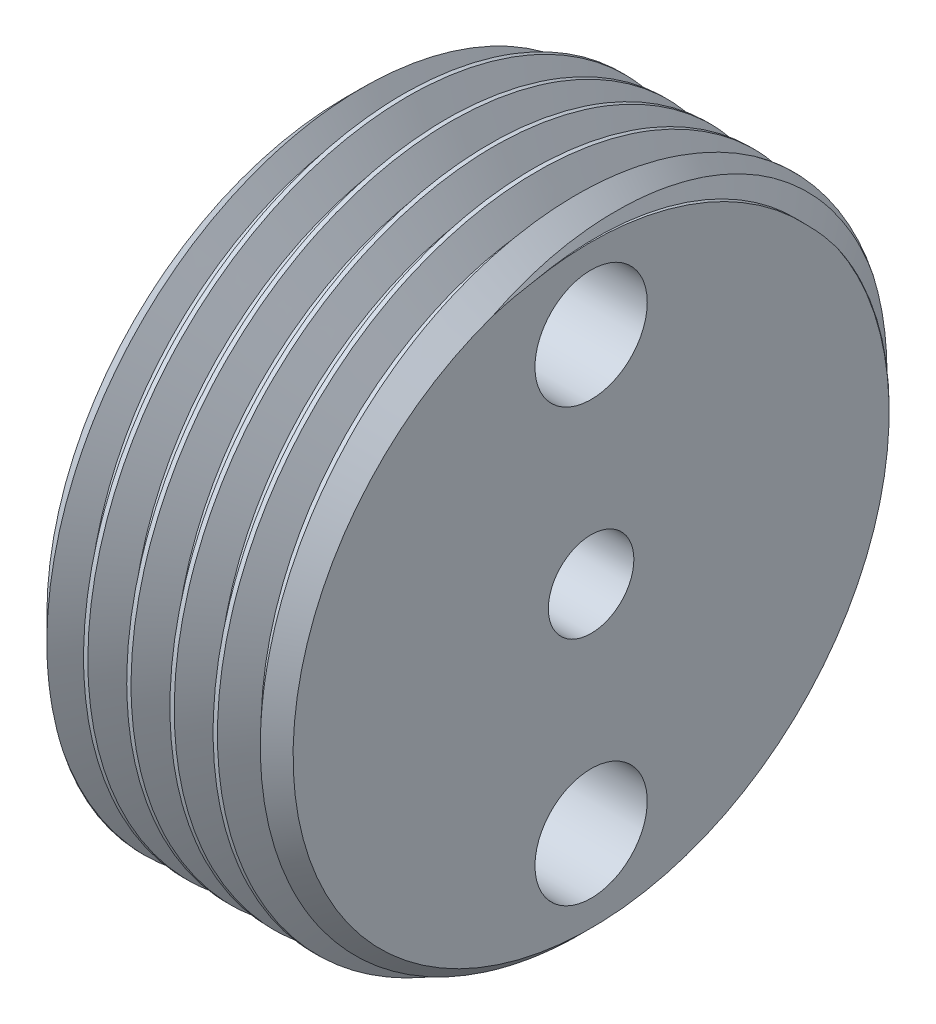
ISO-10303-21;
HEADER;
FILE_DESCRIPTION(('STEP AP214'),'2;1');
FILE_NAME('part.step','',(''),(''),'','','');
FILE_SCHEMA(('AUTOMOTIVE_DESIGN { 1 0 10303 214 1 1 1 1 }'));
ENDSEC;
DATA;
#1=APPLICATION_CONTEXT('core data for automotive mechanical design processes');
#2=APPLICATION_PROTOCOL_DEFINITION('international standard','automotive_design',2000,#1);
#3=PRODUCT_CONTEXT('',#1,'mechanical');
#4=PRODUCT('Part','Part','',(#3));
#5=PRODUCT_RELATED_PRODUCT_CATEGORY('part','',(#4));
#6=PRODUCT_DEFINITION_FORMATION('','',#4);
#7=PRODUCT_DEFINITION_CONTEXT('part definition',#1,'design');
#8=PRODUCT_DEFINITION('design','',#6,#7);
#9=PRODUCT_DEFINITION_SHAPE('','',#8);
#10=(LENGTH_UNIT() NAMED_UNIT(*) SI_UNIT(.MILLI.,.METRE.));
#11=(NAMED_UNIT(*) PLANE_ANGLE_UNIT() SI_UNIT($,.RADIAN.));
#12=(NAMED_UNIT(*) SI_UNIT($,.STERADIAN.) SOLID_ANGLE_UNIT());
#13=UNCERTAINTY_MEASURE_WITH_UNIT(LENGTH_MEASURE(1.E-05),#10,'distance_accuracy_value','');
#14=(GEOMETRIC_REPRESENTATION_CONTEXT(3) GLOBAL_UNCERTAINTY_ASSIGNED_CONTEXT((#13)) GLOBAL_UNIT_ASSIGNED_CONTEXT((#10,
#11,#12)) REPRESENTATION_CONTEXT('',''));
#15=CARTESIAN_POINT('',(0.,0.,0.));
#16=DIRECTION('',(0.,0.,1.));
#17=DIRECTION('',(1.,0.,0.));
#18=AXIS2_PLACEMENT_3D('',#15,#16,#17);
#19=CARTESIAN_POINT('',(7.239,0.,0.));
#20=DIRECTION('',(1.,0.,0.));
#21=DIRECTION('',(0.,0.,-1.));
#22=AXIS2_PLACEMENT_3D('',#19,#20,#21);
#23=PLANE('',#22);
#24=CARTESIAN_POINT('',(7.239,6.35,0.));
#25=DIRECTION('',(1.,0.,0.));
#26=DIRECTION('',(0.,0.,-1.));
#27=AXIS2_PLACEMENT_3D('',#24,#25,#26);
#28=CIRCLE('',#27,1.651);
#29=CARTESIAN_POINT('',(7.239,6.35,-1.651));
#30=VERTEX_POINT('',#29);
#31=EDGE_CURVE('E259',#30,#30,#28,.T.);
#32=ORIENTED_EDGE('',*,*,#31,.F.);
#33=EDGE_LOOP('',(#32));
#34=FACE_BOUND('',#33,.T.);
#35=CARTESIAN_POINT('',(7.239,-6.35,0.));
#36=DIRECTION('',(1.,0.,0.));
#37=DIRECTION('',(0.,0.,1.));
#38=AXIS2_PLACEMENT_3D('',#35,#36,#37);
#39=CIRCLE('',#38,1.651);
#40=CARTESIAN_POINT('',(7.239,-6.35,1.651));
#41=VERTEX_POINT('',#40);
#42=EDGE_CURVE('E263',#41,#41,#39,.T.);
#43=ORIENTED_EDGE('',*,*,#42,.F.);
#44=EDGE_LOOP('',(#43));
#45=FACE_BOUND('',#44,.T.);
#46=CARTESIAN_POINT('',(7.239,0.,0.));
#47=DIRECTION('',(1.,0.,0.));
#48=DIRECTION('',(0.,0.,-1.));
#49=AXIS2_PLACEMENT_3D('',#46,#47,#48);
#50=CIRCLE('',#49,1.2573);
#51=CARTESIAN_POINT('',(7.239,0.,-1.2573));
#52=VERTEX_POINT('',#51);
#53=EDGE_CURVE('E266',#52,#52,#50,.T.);
#54=ORIENTED_EDGE('',*,*,#53,.F.);
#55=EDGE_LOOP('',(#54));
#56=FACE_BOUND('',#55,.T.);
#57=CARTESIAN_POINT('',(7.239,5.93371349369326,-6.37914359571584));
#58=CARTESIAN_POINT('',(7.239,6.03354380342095,-6.28629380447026));
#59=CARTESIAN_POINT('',(7.239,6.13120451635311,-6.19107549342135));
#60=CARTESIAN_POINT('',(7.23900000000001,6.41751182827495,-5.89850589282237));
#61=CARTESIAN_POINT('',(7.239,6.5993101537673,-5.69438676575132));
#62=CARTESIAN_POINT('',(7.239,6.94292062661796,-5.26999652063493));
#63=CARTESIAN_POINT('',(7.239,7.10473277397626,-5.04972540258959));
#64=CARTESIAN_POINT('',(7.239,7.38948444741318,-4.62128167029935));
#65=CARTESIAN_POINT('',(7.239,7.51475530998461,-4.41465444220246));
#66=CARTESIAN_POINT('',(7.239,7.74770431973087,-3.99171465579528));
#67=CARTESIAN_POINT('',(7.239,7.85538324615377,-3.77540252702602));
#68=CARTESIAN_POINT('',(7.239,8.05206766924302,-3.33534436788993));
#69=CARTESIAN_POINT('',(7.239,8.1411360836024,-3.11162644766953));
#70=CARTESIAN_POINT('',(7.239,8.3004548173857,-2.65758528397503));
#71=CARTESIAN_POINT('',(7.239,8.37070513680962,-2.42726204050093));
#72=CARTESIAN_POINT('',(7.239,8.49190508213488,-1.96159794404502));
#73=CARTESIAN_POINT('',(7.239,8.54285470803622,-1.72625709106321));
#74=CARTESIAN_POINT('',(7.239,8.62859470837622,-1.2320286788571));
#75=CARTESIAN_POINT('',(7.239,8.66164688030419,-0.972837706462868));
#76=CARTESIAN_POINT('',(7.23899999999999,8.70435445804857,-0.452543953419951));
#77=CARTESIAN_POINT('',(7.23899999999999,8.71400986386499,-0.191441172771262));
#78=CARTESIAN_POINT('',(7.239,8.70975457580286,0.340584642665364));
#79=CARTESIAN_POINT('',(7.239,8.69492713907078,0.611500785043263));
#80=CARTESIAN_POINT('',(7.239,8.63988438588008,1.15316176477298));
#81=CARTESIAN_POINT('',(7.239,8.59944583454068,1.42388392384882));
#82=CARTESIAN_POINT('',(7.239,8.54630048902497,1.69209242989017));
#83=B_SPLINE_CURVE_WITH_KNOTS('',3,(#57,#58,#59,#60,#61,#62,#63,#64,#65,#66,#67,#68,#69,#70,#71,
#72,#73,#74,#75,#76,#77,#78,#79,#80,#81,#82),.UNSPECIFIED.,.F.,.F.,(4,2,2,2,2,2,2,2,2,2,2,2,4),
(0.,0.409031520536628,1.22777347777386,2.04651543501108,2.77060215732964,3.49465679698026,
4.21622249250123,4.93778818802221,5.65935388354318,6.44215248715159,7.22495109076,
8.03773081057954,8.85769436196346),.UNSPECIFIED.);
#84=CARTESIAN_POINT('',(7.239,5.93371349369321,-6.3791435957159));
#85=VERTEX_POINT('',#84);
#86=CARTESIAN_POINT('',(7.239,8.54630048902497,1.69209242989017));
#87=VERTEX_POINT('',#86);
#88=EDGE_CURVE('E112',#85,#87,#83,.T.);
#89=ORIENTED_EDGE('',*,*,#88,.T.);
#90=CARTESIAN_POINT('',(7.239,8.54630048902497,1.69209242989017));
#91=CARTESIAN_POINT('',(7.239,8.5204177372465,1.85767296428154));
#92=CARTESIAN_POINT('',(7.239,8.48980074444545,2.02246807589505));
#93=CARTESIAN_POINT('',(7.239,8.41919403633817,2.3500010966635));
#94=CARTESIAN_POINT('',(7.239,8.3792063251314,2.51273943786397));
#95=CARTESIAN_POINT('',(7.239,8.24522705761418,2.99754974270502));
#96=CARTESIAN_POINT('',(7.23899999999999,8.13726838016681,3.3159037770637));
#97=CARTESIAN_POINT('',(7.239,7.9190043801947,3.85565381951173));
#98=CARTESIAN_POINT('',(7.239,7.81687386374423,4.08042153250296));
#99=CARTESIAN_POINT('',(7.239,7.59405046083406,4.52055572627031));
#100=CARTESIAN_POINT('',(7.239,7.47336087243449,4.73592386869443));
#101=CARTESIAN_POINT('',(7.239,7.21420115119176,5.15584010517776));
#102=CARTESIAN_POINT('',(7.239,7.07572024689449,5.36038153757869));
#103=CARTESIAN_POINT('',(7.239,6.7820176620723,5.75709219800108));
#104=CARTESIAN_POINT('',(7.239,6.62679730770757,5.94926240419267));
#105=CARTESIAN_POINT('',(7.239,6.38234682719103,6.22701189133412));
#106=CARTESIAN_POINT('',(7.239,6.29896858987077,6.31780387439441));
#107=CARTESIAN_POINT('',(7.239,6.12857409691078,6.49590568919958));
#108=CARTESIAN_POINT('',(7.239,6.0415578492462,6.58321552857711));
#109=CARTESIAN_POINT('',(7.239,5.77525849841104,6.83971293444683));
#110=CARTESIAN_POINT('',(7.239,5.59070638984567,7.00348925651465));
#111=CARTESIAN_POINT('',(7.239,5.20887631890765,7.31540393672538));
#112=CARTESIAN_POINT('',(7.239,5.01159941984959,7.46354359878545));
#113=CARTESIAN_POINT('',(7.239,4.60569493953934,7.74318905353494));
#114=CARTESIAN_POINT('',(7.239,4.39706962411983,7.87469814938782));
#115=CARTESIAN_POINT('',(7.239,3.85672541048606,8.18517990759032));
#116=CARTESIAN_POINT('',(7.239,3.518190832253,8.35253534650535));
#117=CARTESIAN_POINT('',(7.239,2.9972800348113,8.57075757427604));
#118=CARTESIAN_POINT('',(7.239,2.82155777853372,8.63800205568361));
#119=CARTESIAN_POINT('',(7.239,2.46624214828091,8.76142750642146));
#120=CARTESIAN_POINT('',(7.239,2.28664823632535,8.81760692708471));
#121=CARTESIAN_POINT('',(7.23899999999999,2.10541918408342,8.86815599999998));
#122=B_SPLINE_CURVE_WITH_KNOTS('',3,(#90,#91,#92,#93,#94,#95,#96,#97,#98,#99,#100,#101,#102,
#103,#104,#105,#106,#107,#108,#109,#110,#111,#112,#113,#114,#115,#116,#117,#118,#119,#120,#121),
.UNSPECIFIED.,.F.,.F.,(4,2,2,2,2,2,2,2,2,2,2,2,2,2,2,4),(0.,0.502615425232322,1.00512345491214,
2.0110850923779,2.75094784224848,3.49067926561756,4.23086067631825,4.97098349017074,
5.34069752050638,5.71041074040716,6.44975397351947,7.18903550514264,7.92816996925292,
9.05769155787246,9.62183674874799,10.1860608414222),.UNSPECIFIED.);
#123=CARTESIAN_POINT('',(7.239,8.26685120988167,2.90677485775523));
#124=VERTEX_POINT('',#123);
#125=EDGE_CURVE('E191',#87,#124,#122,.T.);
#126=ORIENTED_EDGE('',*,*,#125,.T.);
#127=CARTESIAN_POINT('',(7.239,0.,0.));
#128=DIRECTION('',(1.,0.,0.));
#129=DIRECTION('',(0.,0.,-1.));
#130=AXIS2_PLACEMENT_3D('',#127,#128,#129);
#131=CIRCLE('',#130,8.763);
#132=CARTESIAN_POINT('',(7.239,4.96133581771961,-7.2232482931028));
#133=VERTEX_POINT('',#132);
#134=EDGE_CURVE('E298',#124,#133,#131,.T.);
#135=ORIENTED_EDGE('',*,*,#134,.T.);
#136=CARTESIAN_POINT('',(7.239,1.08165173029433,-8.868156));
#137=CARTESIAN_POINT('',(7.239,1.24692933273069,-8.84146583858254));
#138=CARTESIAN_POINT('',(7.239,1.41140479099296,-8.81008536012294));
#139=CARTESIAN_POINT('',(7.239,1.73827963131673,-8.73803841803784));
#140=CARTESIAN_POINT('',(7.239,1.90067936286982,-8.69737353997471));
#141=CARTESIAN_POINT('',(7.239,2.38501515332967,-8.56133284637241));
#142=CARTESIAN_POINT('',(7.239,2.70318744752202,-8.45205641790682));
#143=CARTESIAN_POINT('',(7.239,3.24408389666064,-8.231079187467));
#144=CARTESIAN_POINT('',(7.239,3.47013911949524,-8.12737632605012));
#145=CARTESIAN_POINT('',(7.239,3.91269659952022,-7.90128379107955));
#146=CARTESIAN_POINT('',(7.239,4.12920061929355,-7.77889758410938));
#147=CARTESIAN_POINT('',(7.239,4.5507899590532,-7.51651140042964));
#148=CARTESIAN_POINT('',(7.239,4.7558916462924,-7.37653766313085));
#149=CARTESIAN_POINT('',(7.239,5.15348829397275,-7.07988542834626));
#150=CARTESIAN_POINT('',(7.239,5.3459912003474,-6.92321762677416));
#151=CARTESIAN_POINT('',(7.239,5.6005485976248,-6.69759062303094));
#152=CARTESIAN_POINT('',(7.239,5.66862130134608,-6.63532135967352));
#153=CARTESIAN_POINT('',(7.239,5.80270364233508,-6.50875560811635));
#154=CARTESIAN_POINT('',(7.239,5.8687156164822,-6.44446159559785));
#155=CARTESIAN_POINT('',(7.239,5.93371349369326,-6.37914359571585));
#156=B_SPLINE_CURVE_WITH_KNOTS('',3,(#136,#137,#138,#139,#140,#141,#142,#143,#144,#145,#146,
#147,#148,#149,#150,#151,#152,#153,#154,#155),.UNSPECIFIED.,.F.,.F.,(4,2,2,2,2,2,2,2,2,4),(0.,
0.502100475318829,1.00411526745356,2.01086536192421,2.75619169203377,3.50137989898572,
4.24546925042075,4.98908469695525,5.26582103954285,5.54223123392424),.UNSPECIFIED.);
#157=EDGE_CURVE('E54',#133,#85,#156,.T.);
#158=ORIENTED_EDGE('',*,*,#157,.T.);
#159=EDGE_LOOP('',(#89,#126,#135,#158));
#160=FACE_BOUND('',#159,.T.);
#161=ADVANCED_FACE('F33',(#34,#45,#56,#160),#23,.T.);
#162=CARTESIAN_POINT('',(7.239,0.,0.));
#163=DIRECTION('',(-1.,0.,0.));
#164=DIRECTION('',(0.,0.,1.));
#165=AXIS2_PLACEMENT_3D('',#162,#163,#164);
#166=CYLINDRICAL_SURFACE('',#165,9.525);
#167=CARTESIAN_POINT('',(0.571500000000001,0.,9.525));
#168=CARTESIAN_POINT('',(0.650875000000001,-3.94538418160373,9.525));
#169=CARTESIAN_POINT('',(0.730250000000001,-6.73519209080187,6.73519209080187));
#170=CARTESIAN_POINT('',(0.809625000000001,-9.525,3.94538418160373));
#171=CARTESIAN_POINT('',(0.889000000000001,-9.525,0.));
#172=CARTESIAN_POINT('',(0.968375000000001,-9.525,-3.94538418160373));
#173=CARTESIAN_POINT('',(1.04775,-6.73519209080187,-6.73519209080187));
#174=CARTESIAN_POINT('',(1.127125,-3.94538418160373,-9.525));
#175=CARTESIAN_POINT('',(1.2065,0.,-9.525));
#176=CARTESIAN_POINT('',(1.285875,3.94538418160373,-9.525));
#177=CARTESIAN_POINT('',(1.36525,6.73519209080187,-6.73519209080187));
#178=CARTESIAN_POINT('',(1.444625,9.525,-3.94538418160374));
#179=CARTESIAN_POINT('',(1.524,9.525,0.));
#180=CARTESIAN_POINT('',(1.603375,9.525,3.94538418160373));
#181=CARTESIAN_POINT('',(1.68275,6.73519209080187,6.73519209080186));
#182=CARTESIAN_POINT('',(1.762125,3.94538418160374,9.525));
#183=CARTESIAN_POINT('',(1.8415,0.,9.525));
#184=CARTESIAN_POINT('',(1.920875,-3.94538418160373,9.525));
#185=CARTESIAN_POINT('',(2.00025,-6.73519209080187,6.73519209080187));
#186=CARTESIAN_POINT('',(2.079625,-9.525,3.94538418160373));
#187=CARTESIAN_POINT('',(2.159,-9.525,0.));
#188=CARTESIAN_POINT('',(2.238375,-9.525,-3.94538418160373));
#189=CARTESIAN_POINT('',(2.31775,-6.73519209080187,-6.73519209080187));
#190=CARTESIAN_POINT('',(2.397125,-3.94538418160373,-9.525));
#191=CARTESIAN_POINT('',(2.4765,0.,-9.525));
#192=CARTESIAN_POINT('',(2.555875,3.94538418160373,-9.525));
#193=CARTESIAN_POINT('',(2.63525,6.73519209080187,-6.73519209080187));
#194=CARTESIAN_POINT('',(2.714625,9.525,-3.94538418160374));
#195=CARTESIAN_POINT('',(2.794,9.525,0.));
#196=CARTESIAN_POINT('',(2.873375,9.525,3.94538418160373));
#197=CARTESIAN_POINT('',(2.95275,6.73519209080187,6.73519209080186));
#198=CARTESIAN_POINT('',(3.032125,3.94538418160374,9.525));
#199=CARTESIAN_POINT('',(3.1115,0.,9.525));
#200=CARTESIAN_POINT('',(3.190875,-3.94538418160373,9.525));
#201=CARTESIAN_POINT('',(3.27025,-6.73519209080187,6.73519209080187));
#202=CARTESIAN_POINT('',(3.349625,-9.525,3.94538418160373));
#203=CARTESIAN_POINT('',(3.429,-9.525,0.));
#204=CARTESIAN_POINT('',(3.508375,-9.525,-3.94538418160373));
#205=CARTESIAN_POINT('',(3.58775,-6.73519209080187,-6.73519209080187));
#206=CARTESIAN_POINT('',(3.667125,-3.94538418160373,-9.525));
#207=CARTESIAN_POINT('',(3.7465,0.,-9.525));
#208=CARTESIAN_POINT('',(3.825875,3.94538418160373,-9.525));
#209=CARTESIAN_POINT('',(3.90525,6.73519209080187,-6.73519209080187));
#210=CARTESIAN_POINT('',(3.984625,9.525,-3.94538418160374));
#211=CARTESIAN_POINT('',(4.064,9.525,0.));
#212=CARTESIAN_POINT('',(4.143375,9.525,3.94538418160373));
#213=CARTESIAN_POINT('',(4.22275,6.73519209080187,6.73519209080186));
#214=CARTESIAN_POINT('',(4.302125,3.94538418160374,9.525));
#215=CARTESIAN_POINT('',(4.3815,0.,9.525));
#216=CARTESIAN_POINT('',(4.460875,-3.94538418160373,9.525));
#217=CARTESIAN_POINT('',(4.54025,-6.73519209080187,6.73519209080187));
#218=CARTESIAN_POINT('',(4.619625,-9.525,3.94538418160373));
#219=CARTESIAN_POINT('',(4.699,-9.525,0.));
#220=CARTESIAN_POINT('',(4.778375,-9.525,-3.94538418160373));
#221=CARTESIAN_POINT('',(4.85775,-6.73519209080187,-6.73519209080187));
#222=CARTESIAN_POINT('',(4.937125,-3.94538418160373,-9.525));
#223=CARTESIAN_POINT('',(5.0165,0.,-9.525));
#224=CARTESIAN_POINT('',(5.095875,3.94538418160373,-9.525));
#225=CARTESIAN_POINT('',(5.17525,6.73519209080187,-6.73519209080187));
#226=CARTESIAN_POINT('',(5.254625,9.525,-3.94538418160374));
#227=CARTESIAN_POINT('',(5.334,9.525,0.));
#228=CARTESIAN_POINT('',(5.413375,9.525,3.94538418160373));
#229=CARTESIAN_POINT('',(5.49275,6.73519209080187,6.73519209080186));
#230=CARTESIAN_POINT('',(5.572125,3.94538418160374,9.525));
#231=CARTESIAN_POINT('',(5.6515,0.,9.525));
#232=CARTESIAN_POINT('',(5.730875,-3.94538418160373,9.525));
#233=CARTESIAN_POINT('',(5.81025,-6.73519209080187,6.73519209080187));
#234=CARTESIAN_POINT('',(5.889625,-9.525,3.94538418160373));
#235=CARTESIAN_POINT('',(5.969,-9.525,0.));
#236=CARTESIAN_POINT('',(6.048375,-9.525,-3.94538418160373));
#237=CARTESIAN_POINT('',(6.12775,-6.73519209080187,-6.73519209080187));
#238=CARTESIAN_POINT('',(6.207125,-3.94538418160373,-9.525));
#239=CARTESIAN_POINT('',(6.2865,0.,-9.525));
#240=CARTESIAN_POINT('',(6.365875,3.94538418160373,-9.525));
#241=CARTESIAN_POINT('',(6.44525,6.73519209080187,-6.73519209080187));
#242=CARTESIAN_POINT('',(6.524625,9.525,-3.94538418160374));
#243=CARTESIAN_POINT('',(6.604,9.525,0.));
#244=CARTESIAN_POINT('',(6.683375,9.525,3.94538418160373));
#245=CARTESIAN_POINT('',(6.76275,6.73519209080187,6.73519209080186));
#246=CARTESIAN_POINT('',(6.842125,3.94538418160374,9.525));
#247=CARTESIAN_POINT('',(6.9215,0.,9.525));
#248=CARTESIAN_POINT('',(7.000875,-3.94538418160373,9.525));
#249=CARTESIAN_POINT('',(7.08025,-6.73519209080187,6.73519209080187));
#250=CARTESIAN_POINT('',(7.159625,-9.525,3.94538418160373));
#251=CARTESIAN_POINT('',(7.239,-9.525,0.));
#252=CARTESIAN_POINT('',(7.318375,-9.525,-3.94538418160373));
#253=CARTESIAN_POINT('',(7.39775,-6.73519209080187,-6.73519209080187));
#254=CARTESIAN_POINT('',(7.477125,-3.94538418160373,-9.525));
#255=CARTESIAN_POINT('',(7.5565,0.,-9.525));
#256=CARTESIAN_POINT('',(7.635875,3.94538418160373,-9.525));
#257=CARTESIAN_POINT('',(7.71525,6.73519209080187,-6.73519209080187));
#258=CARTESIAN_POINT('',(7.794625,9.525,-3.94538418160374));
#259=CARTESIAN_POINT('',(7.874,9.525,0.));
#260=CARTESIAN_POINT('',(7.953375,9.525,3.94538418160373));
#261=CARTESIAN_POINT('',(8.03275,6.73519209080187,6.73519209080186));
#262=CARTESIAN_POINT('',(8.112125,3.94538418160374,9.525));
#263=CARTESIAN_POINT('',(8.1915,0.,9.525));
#264=(BOUNDED_CURVE() B_SPLINE_CURVE(2,(#167,#168,#169,#170,#171,#172,#173,#174,#175,#176,#177,
#178,#179,#180,#181,#182,#183,#184,#185,#186,#187,#188,#189,#190,#191,#192,#193,#194,#195,#196,
#197,#198,#199,#200,#201,#202,#203,#204,#205,#206,#207,#208,#209,#210,#211,#212,#213,#214,#215,
#216,#217,#218,#219,#220,#221,#222,#223,#224,#225,#226,#227,#228,#229,#230,#231,#232,#233,#234,
#235,#236,#237,#238,#239,#240,#241,#242,#243,#244,#245,#246,#247,#248,#249,#250,#251,#252,#253,
#254,#255,#256,#257,#258,#259,#260,#261,#262,#263),.UNSPECIFIED.,.F.,
.F.) B_SPLINE_CURVE_WITH_KNOTS((3,2,2,2,2,2,2,2,2,2,2,2,2,2,2,2,2,2,2,2,2,2,2,2,2,2,2,2,2,2,2,2,
2,2,2,2,2,2,2,2,2,2,2,2,2,2,2,2,3),(0.,0.0208333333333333,0.0416666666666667,0.0625,
0.0833333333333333,0.104166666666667,0.125,0.145833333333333,0.166666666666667,0.1875,
0.208333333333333,0.229166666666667,0.25,0.270833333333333,0.291666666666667,0.3125,
0.333333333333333,0.354166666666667,0.375,0.395833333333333,0.416666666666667,0.4375,
0.458333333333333,0.479166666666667,0.5,0.520833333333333,0.541666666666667,0.5625,
0.583333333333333,0.604166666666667,0.625,0.645833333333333,0.666666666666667,0.6875,
0.708333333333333,0.729166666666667,0.75,0.770833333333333,0.791666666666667,0.8125,
0.833333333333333,0.854166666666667,0.875,0.895833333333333,0.916666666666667,0.9375,
0.958333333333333,0.979166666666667,1.),
.UNSPECIFIED.) CURVE() GEOMETRIC_REPRESENTATION_ITEM() RATIONAL_B_SPLINE_CURVE((1.,
0.923879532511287,1.,0.923879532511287,1.,0.923879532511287,1.,0.923879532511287,1.,
0.923879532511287,1.,0.923879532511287,1.,0.923879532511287,1.,0.923879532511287,1.,
0.923879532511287,1.,0.923879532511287,1.,0.923879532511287,1.,0.923879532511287,1.,
0.923879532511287,1.,0.923879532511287,1.,0.923879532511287,1.,0.923879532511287,1.,
0.923879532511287,1.,0.923879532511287,1.,0.923879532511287,1.,0.923879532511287,1.,
0.923879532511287,1.,0.923879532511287,1.,0.923879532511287,1.,0.923879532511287,1.,
0.923879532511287,1.,0.923879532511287,1.,0.923879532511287,1.,0.923879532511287,1.,
0.923879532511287,1.,0.923879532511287,1.,0.923879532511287,1.,0.923879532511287,1.,
0.923879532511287,1.,0.923879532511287,1.,0.923879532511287,1.,0.923879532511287,1.,
0.923879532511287,1.,0.923879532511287,1.,0.923879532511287,1.,0.923879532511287,1.,
0.923879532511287,1.,0.923879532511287,1.,0.923879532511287,1.,0.923879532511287,1.,
0.923879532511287,1.,0.923879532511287,1.,0.923879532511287,1.,0.923879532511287,1.)) REPRESENTATION_ITEM(''));
#265=CARTESIAN_POINT('',(0.761999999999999,-7.7278992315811,5.56823117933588));
#266=VERTEX_POINT('',#265);
#267=CARTESIAN_POINT('',(6.47699999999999,7.72789923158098,-5.56823117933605));
#268=VERTEX_POINT('',#267);
#269=EDGE_CURVE('E415',#266,#268,#264,.T.);
#270=ORIENTED_EDGE('',*,*,#269,.T.);
#271=CARTESIAN_POINT('',(6.47699999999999,0.,0.));
#272=DIRECTION('',(1.,0.,0.));
#273=DIRECTION('',(0.,0.,-1.));
#274=AXIS2_PLACEMENT_3D('',#271,#272,#273);
#275=CIRCLE('',#274,9.525);
#276=CARTESIAN_POINT('',(6.477,2.96084867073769,-9.05312101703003));
#277=VERTEX_POINT('',#276);
#278=EDGE_CURVE('E289',#268,#277,#275,.F.);
#279=ORIENTED_EDGE('',*,*,#278,.T.);
#280=CARTESIAN_POINT('',(-0.571499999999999,0.,9.525));
#281=CARTESIAN_POINT('',(-0.492124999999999,-3.94538418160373,9.525));
#282=CARTESIAN_POINT('',(-0.412749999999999,-6.73519209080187,6.73519209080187));
#283=CARTESIAN_POINT('',(-0.333374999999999,-9.525,3.94538418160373));
#284=CARTESIAN_POINT('',(-0.253999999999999,-9.525,0.));
#285=CARTESIAN_POINT('',(-0.174624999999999,-9.525,-3.94538418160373));
#286=CARTESIAN_POINT('',(-0.0952499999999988,-6.73519209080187,-6.73519209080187));
#287=CARTESIAN_POINT('',(-0.0158749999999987,-3.94538418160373,-9.525));
#288=CARTESIAN_POINT('',(0.0635000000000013,0.,-9.525));
#289=CARTESIAN_POINT('',(0.142875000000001,3.94538418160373,-9.525));
#290=CARTESIAN_POINT('',(0.222250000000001,6.73519209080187,-6.73519209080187));
#291=CARTESIAN_POINT('',(0.301625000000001,9.525,-3.94538418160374));
#292=CARTESIAN_POINT('',(0.381000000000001,9.525,0.));
#293=CARTESIAN_POINT('',(0.460375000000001,9.525,3.94538418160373));
#294=CARTESIAN_POINT('',(0.539750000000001,6.73519209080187,6.73519209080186));
#295=CARTESIAN_POINT('',(0.619125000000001,3.94538418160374,9.525));
#296=CARTESIAN_POINT('',(0.698500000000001,0.,9.525));
#297=CARTESIAN_POINT('',(0.777875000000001,-3.94538418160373,9.525));
#298=CARTESIAN_POINT('',(0.857250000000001,-6.73519209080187,6.73519209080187));
#299=CARTESIAN_POINT('',(0.936625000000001,-9.525,3.94538418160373));
#300=CARTESIAN_POINT('',(1.016,-9.525,0.));
#301=CARTESIAN_POINT('',(1.095375,-9.525,-3.94538418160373));
#302=CARTESIAN_POINT('',(1.17475,-6.73519209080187,-6.73519209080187));
#303=CARTESIAN_POINT('',(1.254125,-3.94538418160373,-9.525));
#304=CARTESIAN_POINT('',(1.3335,0.,-9.525));
#305=CARTESIAN_POINT('',(1.412875,3.94538418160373,-9.525));
#306=CARTESIAN_POINT('',(1.49225,6.73519209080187,-6.73519209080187));
#307=CARTESIAN_POINT('',(1.571625,9.525,-3.94538418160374));
#308=CARTESIAN_POINT('',(1.651,9.525,0.));
#309=CARTESIAN_POINT('',(1.730375,9.525,3.94538418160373));
#310=CARTESIAN_POINT('',(1.80975,6.73519209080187,6.73519209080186));
#311=CARTESIAN_POINT('',(1.889125,3.94538418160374,9.525));
#312=CARTESIAN_POINT('',(1.9685,0.,9.525));
#313=CARTESIAN_POINT('',(2.047875,-3.94538418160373,9.525));
#314=CARTESIAN_POINT('',(2.12725,-6.73519209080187,6.73519209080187));
#315=CARTESIAN_POINT('',(2.206625,-9.525,3.94538418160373));
#316=CARTESIAN_POINT('',(2.286,-9.525,0.));
#317=CARTESIAN_POINT('',(2.365375,-9.525,-3.94538418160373));
#318=CARTESIAN_POINT('',(2.44475,-6.73519209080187,-6.73519209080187));
#319=CARTESIAN_POINT('',(2.524125,-3.94538418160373,-9.525));
#320=CARTESIAN_POINT('',(2.6035,0.,-9.525));
#321=CARTESIAN_POINT('',(2.682875,3.94538418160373,-9.525));
#322=CARTESIAN_POINT('',(2.76225,6.73519209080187,-6.73519209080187));
#323=CARTESIAN_POINT('',(2.841625,9.525,-3.94538418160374));
#324=CARTESIAN_POINT('',(2.921,9.525,0.));
#325=CARTESIAN_POINT('',(3.000375,9.525,3.94538418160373));
#326=CARTESIAN_POINT('',(3.07975,6.73519209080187,6.73519209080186));
#327=CARTESIAN_POINT('',(3.159125,3.94538418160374,9.525));
#328=CARTESIAN_POINT('',(3.2385,0.,9.525));
#329=CARTESIAN_POINT('',(3.317875,-3.94538418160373,9.525));
#330=CARTESIAN_POINT('',(3.39725,-6.73519209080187,6.73519209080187));
#331=CARTESIAN_POINT('',(3.476625,-9.525,3.94538418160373));
#332=CARTESIAN_POINT('',(3.556,-9.525,0.));
#333=CARTESIAN_POINT('',(3.635375,-9.525,-3.94538418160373));
#334=CARTESIAN_POINT('',(3.71475,-6.73519209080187,-6.73519209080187));
#335=CARTESIAN_POINT('',(3.794125,-3.94538418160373,-9.525));
#336=CARTESIAN_POINT('',(3.8735,0.,-9.525));
#337=CARTESIAN_POINT('',(3.952875,3.94538418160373,-9.525));
#338=CARTESIAN_POINT('',(4.03225,6.73519209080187,-6.73519209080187));
#339=CARTESIAN_POINT('',(4.111625,9.525,-3.94538418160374));
#340=CARTESIAN_POINT('',(4.191,9.525,0.));
#341=CARTESIAN_POINT('',(4.270375,9.525,3.94538418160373));
#342=CARTESIAN_POINT('',(4.34975,6.73519209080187,6.73519209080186));
#343=CARTESIAN_POINT('',(4.429125,3.94538418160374,9.525));
#344=CARTESIAN_POINT('',(4.5085,0.,9.525));
#345=CARTESIAN_POINT('',(4.587875,-3.94538418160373,9.525));
#346=CARTESIAN_POINT('',(4.66725,-6.73519209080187,6.73519209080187));
#347=CARTESIAN_POINT('',(4.746625,-9.525,3.94538418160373));
#348=CARTESIAN_POINT('',(4.826,-9.525,0.));
#349=CARTESIAN_POINT('',(4.905375,-9.525,-3.94538418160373));
#350=CARTESIAN_POINT('',(4.98475,-6.73519209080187,-6.73519209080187));
#351=CARTESIAN_POINT('',(5.064125,-3.94538418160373,-9.525));
#352=CARTESIAN_POINT('',(5.1435,0.,-9.525));
#353=CARTESIAN_POINT('',(5.222875,3.94538418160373,-9.525));
#354=CARTESIAN_POINT('',(5.30225,6.73519209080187,-6.73519209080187));
#355=CARTESIAN_POINT('',(5.381625,9.525,-3.94538418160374));
#356=CARTESIAN_POINT('',(5.461,9.525,0.));
#357=CARTESIAN_POINT('',(5.540375,9.525,3.94538418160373));
#358=CARTESIAN_POINT('',(5.61975,6.73519209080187,6.73519209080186));
#359=CARTESIAN_POINT('',(5.699125,3.94538418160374,9.525));
#360=CARTESIAN_POINT('',(5.7785,0.,9.525));
#361=CARTESIAN_POINT('',(5.857875,-3.94538418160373,9.525));
#362=CARTESIAN_POINT('',(5.93725,-6.73519209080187,6.73519209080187));
#363=CARTESIAN_POINT('',(6.016625,-9.525,3.94538418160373));
#364=CARTESIAN_POINT('',(6.096,-9.525,0.));
#365=CARTESIAN_POINT('',(6.175375,-9.525,-3.94538418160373));
#366=CARTESIAN_POINT('',(6.25475,-6.73519209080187,-6.73519209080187));
#367=CARTESIAN_POINT('',(6.334125,-3.94538418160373,-9.525));
#368=CARTESIAN_POINT('',(6.4135,0.,-9.525));
#369=CARTESIAN_POINT('',(6.492875,3.94538418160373,-9.525));
#370=CARTESIAN_POINT('',(6.57225,6.73519209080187,-6.73519209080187));
#371=CARTESIAN_POINT('',(6.651625,9.525,-3.94538418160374));
#372=CARTESIAN_POINT('',(6.731,9.525,0.));
#373=CARTESIAN_POINT('',(6.810375,9.525,3.94538418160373));
#374=CARTESIAN_POINT('',(6.88975,6.73519209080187,6.73519209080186));
#375=CARTESIAN_POINT('',(6.969125,3.94538418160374,9.525));
#376=CARTESIAN_POINT('',(7.0485,0.,9.525));
#377=(BOUNDED_CURVE() B_SPLINE_CURVE(2,(#280,#281,#282,#283,#284,#285,#286,#287,#288,#289,#290,
#291,#292,#293,#294,#295,#296,#297,#298,#299,#300,#301,#302,#303,#304,#305,#306,#307,#308,#309,
#310,#311,#312,#313,#314,#315,#316,#317,#318,#319,#320,#321,#322,#323,#324,#325,#326,#327,#328,
#329,#330,#331,#332,#333,#334,#335,#336,#337,#338,#339,#340,#341,#342,#343,#344,#345,#346,#347,
#348,#349,#350,#351,#352,#353,#354,#355,#356,#357,#358,#359,#360,#361,#362,#363,#364,#365,#366,
#367,#368,#369,#370,#371,#372,#373,#374,#375,#376),.UNSPECIFIED.,.F.,
.F.) B_SPLINE_CURVE_WITH_KNOTS((3,2,2,2,2,2,2,2,2,2,2,2,2,2,2,2,2,2,2,2,2,2,2,2,2,2,2,2,2,2,2,2,
2,2,2,2,2,2,2,2,2,2,2,2,2,2,2,2,3),(0.,0.0208333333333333,0.0416666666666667,0.0625,
0.0833333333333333,0.104166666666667,0.125,0.145833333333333,0.166666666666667,0.1875,
0.208333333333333,0.229166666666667,0.25,0.270833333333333,0.291666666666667,0.3125,
0.333333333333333,0.354166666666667,0.375,0.395833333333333,0.416666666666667,0.4375,
0.458333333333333,0.479166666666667,0.5,0.520833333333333,0.541666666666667,0.5625,
0.583333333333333,0.604166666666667,0.625,0.645833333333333,0.666666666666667,0.6875,
0.708333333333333,0.729166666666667,0.75,0.770833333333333,0.791666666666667,0.8125,
0.833333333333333,0.854166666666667,0.875,0.895833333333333,0.916666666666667,0.9375,
0.958333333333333,0.979166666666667,1.),
.UNSPECIFIED.) CURVE() GEOMETRIC_REPRESENTATION_ITEM() RATIONAL_B_SPLINE_CURVE((1.,
0.923879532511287,1.,0.923879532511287,1.,0.923879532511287,1.,0.923879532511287,1.,
0.923879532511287,1.,0.923879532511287,1.,0.923879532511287,1.,0.923879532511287,1.,
0.923879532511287,1.,0.923879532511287,1.,0.923879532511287,1.,0.923879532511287,1.,
0.923879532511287,1.,0.923879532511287,1.,0.923879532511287,1.,0.923879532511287,1.,
0.923879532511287,1.,0.923879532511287,1.,0.923879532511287,1.,0.923879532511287,1.,
0.923879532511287,1.,0.923879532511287,1.,0.923879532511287,1.,0.923879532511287,1.,
0.923879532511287,1.,0.923879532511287,1.,0.923879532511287,1.,0.923879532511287,1.,
0.923879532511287,1.,0.923879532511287,1.,0.923879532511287,1.,0.923879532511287,1.,
0.923879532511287,1.,0.923879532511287,1.,0.923879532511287,1.,0.923879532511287,1.,
0.923879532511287,1.,0.923879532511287,1.,0.923879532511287,1.,0.923879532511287,1.,
0.923879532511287,1.,0.923879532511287,1.,0.923879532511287,1.,0.923879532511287,1.,
0.923879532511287,1.,0.923879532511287,1.,0.923879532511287,1.,0.923879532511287,1.)) REPRESENTATION_ITEM(''));
#378=CARTESIAN_POINT('',(0.761999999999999,-2.96084867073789,9.05312101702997));
#379=VERTEX_POINT('',#378);
#380=EDGE_CURVE('E103',#379,#277,#377,.T.);
#381=ORIENTED_EDGE('',*,*,#380,.F.);
#382=CARTESIAN_POINT('',(0.761999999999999,0.,0.));
#383=DIRECTION('',(1.,0.,0.));
#384=DIRECTION('',(0.,0.,-1.));
#385=AXIS2_PLACEMENT_3D('',#382,#383,#384);
#386=CIRCLE('',#385,9.525);
#387=EDGE_CURVE('E292',#379,#266,#386,.T.);
#388=ORIENTED_EDGE('',*,*,#387,.T.);
#389=EDGE_LOOP('',(#270,#279,#381,#388));
#390=FACE_BOUND('',#389,.T.);
#391=ADVANCED_FACE('F179',(#390),#166,.T.);
#392=CARTESIAN_POINT('',(0.761999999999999,0.,0.));
#393=DIRECTION('',(1.,0.,0.));
#394=DIRECTION('',(0.,0.,-1.));
#395=AXIS2_PLACEMENT_3D('',#392,#393,#394);
#396=CONICAL_SURFACE('',#395,9.525,0.785398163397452);
#397=ORIENTED_EDGE('',*,*,#387,.F.);
#398=CARTESIAN_POINT('',(0.761999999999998,-2.96084867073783,9.05312101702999));
#399=CARTESIAN_POINT('',(0.75969757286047,-2.8011419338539,9.10293021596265));
#400=CARTESIAN_POINT('',(0.757399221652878,-2.64015747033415,9.14852580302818));
#401=CARTESIAN_POINT('',(0.752817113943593,-2.31605213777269,9.23117818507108));
#402=CARTESIAN_POINT('',(0.750533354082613,-2.15293178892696,9.26823701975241));
#403=CARTESIAN_POINT('',(0.743704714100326,-1.66035614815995,9.36657836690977));
#404=CARTESIAN_POINT('',(0.739189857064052,-1.3281982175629,9.41486612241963));
#405=CARTESIAN_POINT('',(0.731199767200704,-0.729004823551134,9.46992656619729));
#406=CARTESIAN_POINT('',(0.72770068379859,-0.462537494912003,9.48316806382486));
#407=CARTESIAN_POINT('',(0.722544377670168,-0.0627255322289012,9.4862735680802));
#408=CARTESIAN_POINT('',(0.720840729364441,0.0705850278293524,9.48451431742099));
#409=CARTESIAN_POINT('',(0.717398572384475,0.33704572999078,9.47534352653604));
#410=CARTESIAN_POINT('',(0.715660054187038,0.470195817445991,9.46793042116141));
#411=CARTESIAN_POINT('',(0.710406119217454,0.869032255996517,9.43722815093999));
#412=CARTESIAN_POINT('',(0.706852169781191,1.1341167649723,9.4054761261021));
#413=CARTESIAN_POINT('',(0.699663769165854,1.66060653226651,9.31963219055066));
#414=CARTESIAN_POINT('',(0.696029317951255,1.92201178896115,9.26554026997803));
#415=CARTESIAN_POINT('',(0.688713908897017,2.43877202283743,9.1355405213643));
#416=CARTESIAN_POINT('',(0.685033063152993,2.69413842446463,9.05967817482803));
#417=CARTESIAN_POINT('',(0.677643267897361,3.19754370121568,8.88663552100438));
#418=CARTESIAN_POINT('',(0.673934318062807,3.44558249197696,8.78945496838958));
#419=CARTESIAN_POINT('',(0.666514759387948,3.93257476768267,8.57446441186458));
#420=CARTESIAN_POINT('',(0.662804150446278,4.17152758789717,8.45665290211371));
#421=CARTESIAN_POINT('',(0.65540755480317,4.63861545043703,8.20124895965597));
#422=CARTESIAN_POINT('',(0.651721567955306,4.8667505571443,8.06365664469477));
#423=CARTESIAN_POINT('',(0.644415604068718,5.30982489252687,7.77017298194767));
#424=CARTESIAN_POINT('',(0.64079544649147,5.5248059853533,7.61434483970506));
#425=CARTESIAN_POINT('',(0.633625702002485,5.94086903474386,7.28512265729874));
#426=CARTESIAN_POINT('',(0.630076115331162,6.14195094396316,7.11172855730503));
#427=CARTESIAN_POINT('',(0.623107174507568,6.528784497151,6.74865341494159));
#428=CARTESIAN_POINT('',(0.619687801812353,6.7145383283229,6.55897470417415));
#429=CARTESIAN_POINT('',(0.612718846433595,7.06920340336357,6.16447938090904));
#430=CARTESIAN_POINT('',(0.609169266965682,7.23811506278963,5.95966314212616));
#431=CARTESIAN_POINT('',(0.601999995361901,7.55730503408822,5.5371649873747));
#432=CARTESIAN_POINT('',(0.598380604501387,7.70764875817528,5.31953247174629));
#433=CARTESIAN_POINT('',(0.591078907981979,7.98933021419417,4.8722915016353));
#434=CARTESIAN_POINT('',(0.587396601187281,8.1206676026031,4.64268283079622));
#435=CARTESIAN_POINT('',(0.579996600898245,8.36339756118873,4.17312938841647));
#436=CARTESIAN_POINT('',(0.576278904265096,8.47478834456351,3.93318369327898));
#437=CARTESIAN_POINT('',(0.568834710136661,8.67680539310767,3.44471003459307));
#438=CARTESIAN_POINT('',(0.565108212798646,8.76743202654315,3.19618222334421));
#439=CARTESIAN_POINT('',(0.557699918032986,8.92670179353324,2.69412138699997));
#440=CARTESIAN_POINT('',(0.554017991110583,8.99549649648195,2.44063644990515));
#441=CARTESIAN_POINT('',(0.546698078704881,9.11148493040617,1.92877714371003));
#442=CARTESIAN_POINT('',(0.543060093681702,9.15867843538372,1.67040272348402));
#443=CARTESIAN_POINT('',(0.535856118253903,9.23112759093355,1.15057965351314));
#444=CARTESIAN_POINT('',(0.532290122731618,9.25638480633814,0.889131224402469));
#445=CARTESIAN_POINT('',(0.527009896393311,9.2776812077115,0.496128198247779));
#446=CARTESIAN_POINT('',(0.525261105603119,9.28201469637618,0.36497524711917));
#447=CARTESIAN_POINT('',(0.521799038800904,9.28515889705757,0.102601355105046));
#448=CARTESIAN_POINT('',(0.520085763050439,9.28396956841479,-0.0286195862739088));
#449=CARTESIAN_POINT('',(0.514900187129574,9.27200804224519,-0.422000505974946));
#450=CARTESIAN_POINT('',(0.511381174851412,9.25284646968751,-0.683954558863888));
#451=CARTESIAN_POINT('',(0.504249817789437,9.19228869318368,-1.20524333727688));
#452=CARTESIAN_POINT('',(0.500637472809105,9.15089244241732,-1.46457805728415));
#453=CARTESIAN_POINT('',(0.4933443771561,9.04617938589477,-1.97872044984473));
#454=CARTESIAN_POINT('',(0.489663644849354,8.98286838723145,-2.23352930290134));
#455=CARTESIAN_POINT('',(0.482257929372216,8.83474966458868,-2.73694245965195));
#456=CARTESIAN_POINT('',(0.478532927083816,8.74993230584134,-2.98554392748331));
#457=CARTESIAN_POINT('',(0.471106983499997,8.56044875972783,-3.47200865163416));
#458=CARTESIAN_POINT('',(0.467406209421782,8.45600396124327,-3.70995816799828));
#459=CARTESIAN_POINT('',(0.460016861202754,8.22748524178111,-4.17610618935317));
#460=CARTESIAN_POINT('',(0.456328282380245,8.10342004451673,-4.40430897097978));
#461=CARTESIAN_POINT('',(0.448988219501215,7.83647255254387,-4.84951467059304));
#462=CARTESIAN_POINT('',(0.445336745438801,7.69358532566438,-5.0665146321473));
#463=CARTESIAN_POINT('',(0.438093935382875,7.39003711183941,-5.48770121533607));
#464=CARTESIAN_POINT('',(0.434502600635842,7.22937575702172,-5.69188757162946));
#465=CARTESIAN_POINT('',(0.427421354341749,6.89138028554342,-6.08605775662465));
#466=CARTESIAN_POINT('',(0.423931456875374,6.71404386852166,-6.27603961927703));
#467=CARTESIAN_POINT('',(0.418747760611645,6.43651365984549,-6.5492484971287));
#468=CARTESIAN_POINT('',(0.417028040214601,6.34206215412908,-6.63837450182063));
#469=CARTESIAN_POINT('',(0.413547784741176,6.14941353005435,-6.81253294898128));
#470=CARTESIAN_POINT('',(0.411787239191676,6.05121544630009,-6.89756432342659));
#471=CARTESIAN_POINT('',(0.40647240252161,5.75140617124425,-7.14618084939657));
#472=CARTESIAN_POINT('',(0.402882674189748,5.54445953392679,-7.30340693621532));
#473=CARTESIAN_POINT('',(0.395625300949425,5.1179497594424,-7.59963371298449));
#474=CARTESIAN_POINT('',(0.391957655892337,4.89838659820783,-7.73863436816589));
#475=CARTESIAN_POINT('',(0.384602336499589,4.44999533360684,-7.99640493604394));
#476=CARTESIAN_POINT('',(0.380915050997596,4.22125440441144,-8.115326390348));
#477=CARTESIAN_POINT('',(0.373518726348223,3.75462568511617,-8.33336948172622));
#478=CARTESIAN_POINT('',(0.369809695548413,3.51674123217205,-8.43249826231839));
#479=CARTESIAN_POINT('',(0.362394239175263,3.03337404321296,-8.61033016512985));
#480=CARTESIAN_POINT('',(0.358687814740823,2.78788901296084,-8.68902705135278));
#481=CARTESIAN_POINT('',(0.351304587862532,2.29114243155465,-8.82539153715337));
#482=CARTESIAN_POINT('',(0.347627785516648,2.0398808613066,-8.88305906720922));
#483=CARTESIAN_POINT('',(0.340343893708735,1.5341444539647,-8.97681517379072));
#484=CARTESIAN_POINT('',(0.33673662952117,1.27968138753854,-9.01296738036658));
#485=CARTESIAN_POINT('',(0.329597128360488,0.76857881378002,-9.0636926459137));
#486=CARTESIAN_POINT('',(0.326064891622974,0.511939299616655,-9.07826563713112));
#487=CARTESIAN_POINT('',(0.320868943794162,0.126823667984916,-9.08389157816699));
#488=CARTESIAN_POINT('',(0.31915395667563,-0.00157985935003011,-9.08306091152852));
#489=CARTESIAN_POINT('',(0.315697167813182,-0.258234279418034,-9.0759316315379));
#490=CARTESIAN_POINT('',(0.313955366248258,-0.386485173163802,-9.06963305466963));
#491=CARTESIAN_POINT('',(0.308688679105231,-0.770644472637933,-9.04253877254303));
#492=CARTESIAN_POINT('',(0.305121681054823,-1.02602238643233,-9.01354544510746));
#493=CARTESIAN_POINT('',(0.297921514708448,-1.53224233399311,-8.93408642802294));
#494=CARTESIAN_POINT('',(0.294288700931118,-1.78309924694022,-8.88371450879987));
#495=CARTESIAN_POINT('',(0.286966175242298,-2.27964926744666,-8.76187286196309));
#496=CARTESIAN_POINT('',(0.283276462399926,-2.52534229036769,-8.69040278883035));
#497=CARTESIAN_POINT('',(0.275866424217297,-3.00980126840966,-8.52687280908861));
#498=CARTESIAN_POINT('',(0.272146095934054,-3.24856654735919,-8.43481090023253));
#499=CARTESIAN_POINT('',(0.264702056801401,-3.71742379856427,-8.23076625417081));
#500=CARTESIAN_POINT('',(0.260978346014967,-3.94751592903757,-8.11878388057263));
#501=CARTESIAN_POINT('',(0.253578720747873,-4.39584727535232,-7.87652770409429));
#502=CARTESIAN_POINT('',(0.249902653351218,-4.61415617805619,-7.74638284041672));
#503=CARTESIAN_POINT('',(0.242602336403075,-5.03903852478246,-7.46816132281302));
#504=CARTESIAN_POINT('',(0.238978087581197,-5.24561180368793,-7.32008441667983));
#505=CARTESIAN_POINT('',(0.231796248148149,-5.64552436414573,-7.00705903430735));
#506=CARTESIAN_POINT('',(0.228238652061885,-5.83886473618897,-6.84211195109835));
#507=CARTESIAN_POINT('',(0.221259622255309,-6.21098698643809,-6.49653909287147));
#508=CARTESIAN_POINT('',(0.21783818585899,-6.38976915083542,-6.31591362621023));
#509=CARTESIAN_POINT('',(0.210878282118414,-6.73118720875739,-5.94020107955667));
#510=CARTESIAN_POINT('',(0.207339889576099,-6.89383316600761,-5.74512314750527));
#511=CARTESIAN_POINT('',(0.200174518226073,-7.2019261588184,-5.34182900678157));
#512=CARTESIAN_POINT('',(0.196547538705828,-7.34737305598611,-5.13361269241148));
#513=CARTESIAN_POINT('',(0.189230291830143,-7.61997392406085,-4.70561031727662));
#514=CARTESIAN_POINT('',(0.185540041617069,-7.74713276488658,-4.48582735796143));
#515=CARTESIAN_POINT('',(0.178120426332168,-7.98233452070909,-4.03613313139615));
#516=CARTESIAN_POINT('',(0.174391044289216,-8.09036874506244,-3.80621731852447));
#517=CARTESIAN_POINT('',(0.166960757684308,-8.28543732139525,-3.34047723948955));
#518=CARTESIAN_POINT('',(0.163259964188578,-8.37267985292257,-3.10474012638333));
#519=CARTESIAN_POINT('',(0.155876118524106,-8.52695471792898,-2.62685940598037));
#520=CARTESIAN_POINT('',(0.152193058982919,-8.59399632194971,-2.38471879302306));
#521=CARTESIAN_POINT('',(0.144867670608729,-8.70746271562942,-1.89558598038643));
#522=CARTESIAN_POINT('',(0.141225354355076,-8.75388130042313,-1.64859234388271));
#523=CARTESIAN_POINT('',(0.134011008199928,-8.82574639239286,-1.15153376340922));
#524=CARTESIAN_POINT('',(0.130438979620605,-8.85119250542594,-0.901468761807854));
#525=CARTESIAN_POINT('',(0.125145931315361,-8.87349083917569,-0.525440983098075));
#526=CARTESIAN_POINT('',(0.123391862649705,-8.87827746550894,-0.399902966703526));
#527=CARTESIAN_POINT('',(0.119921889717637,-8.88256415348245,-0.148746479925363));
#528=CARTESIAN_POINT('',(0.11820598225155,-8.88206466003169,-0.0231280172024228));
#529=CARTESIAN_POINT('',(0.113019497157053,-8.87253000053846,0.353519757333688));
#530=CARTESIAN_POINT('',(0.109509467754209,-8.85546175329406,0.604393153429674));
#531=CARTESIAN_POINT('',(0.102389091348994,-8.80000528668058,1.10368438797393));
#532=CARTESIAN_POINT('',(0.0987787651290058,-8.76162145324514,1.35210272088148));
#533=CARTESIAN_POINT('',(0.0914882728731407,-8.66382277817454,1.84477248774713));
#534=CARTESIAN_POINT('',(0.0878081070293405,-8.604407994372,2.08902393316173));
#535=CARTESIAN_POINT('',(0.0804359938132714,-8.46560322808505,2.56940886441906));
#536=CARTESIAN_POINT('',(0.0767444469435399,-8.38639685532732,2.80559545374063));
#537=CARTESIAN_POINT('',(0.0693436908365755,-8.20831775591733,3.27043500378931));
#538=CARTESIAN_POINT('',(0.065634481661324,-8.10944509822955,3.49908799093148));
#539=CARTESIAN_POINT('',(0.0582243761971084,-7.89272574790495,3.9472564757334));
#540=CARTESIAN_POINT('',(0.054523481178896,-7.77487633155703,4.16677065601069));
#541=CARTESIAN_POINT('',(0.0471567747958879,-7.52105453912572,4.59505620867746));
#542=CARTESIAN_POINT('',(0.0434909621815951,-7.38508281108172,4.80382796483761));
#543=CARTESIAN_POINT('',(0.0364500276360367,-7.10504222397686,5.19645576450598));
#544=CARTESIAN_POINT('',(0.0330710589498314,-6.96201084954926,5.38105351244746));
#545=CARTESIAN_POINT('',(0.0263847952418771,-6.66176069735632,5.73834873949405));
#546=CARTESIAN_POINT('',(0.0230774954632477,-6.50454286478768,5.91104701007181));
#547=CARTESIAN_POINT('',(0.0182020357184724,-6.25886954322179,6.16033177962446));
#548=CARTESIAN_POINT('',(0.016590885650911,-6.17532351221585,6.24181156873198));
#549=CARTESIAN_POINT('',(0.0133389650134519,-6.00502588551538,6.40135897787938));
#550=CARTESIAN_POINT('',(0.0116981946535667,-5.91827431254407,6.47942662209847));
#551=CARTESIAN_POINT('',(0.00839343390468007,-5.741701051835,6.63203042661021));
#552=CARTESIAN_POINT('',(0.00672944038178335,-5.65187894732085,6.7065661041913));
#553=CARTESIAN_POINT('',(0.00338020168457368,-5.46931722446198,6.85197869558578));
#554=CARTESIAN_POINT('',(0.00169495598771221,-5.37657753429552,6.92285551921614));
#555=CARTESIAN_POINT('',(3.70633070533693E-12,-5.28245197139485,6.99184311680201));
#556=B_SPLINE_CURVE_WITH_KNOTS('',3,(#398,#399,#400,#401,#402,#403,#404,#405,#406,#407,#408,
#409,#410,#411,#412,#413,#414,#415,#416,#417,#418,#419,#420,#421,#422,#423,#424,#425,#426,#427,
#428,#429,#430,#431,#432,#433,#434,#435,#436,#437,#438,#439,#440,#441,#442,#443,#444,#445,#446,
#447,#448,#449,#450,#451,#452,#453,#454,#455,#456,#457,#458,#459,#460,#461,#462,#463,#464,#465,
#466,#467,#468,#469,#470,#471,#472,#473,#474,#475,#476,#477,#478,#479,#480,#481,#482,#483,#484,
#485,#486,#487,#488,#489,#490,#491,#492,#493,#494,#495,#496,#497,#498,#499,#500,#501,#502,#503,
#504,#505,#506,#507,#508,#509,#510,#511,#512,#513,#514,#515,#516,#517,#518,#519,#520,#521,#522,
#523,#524,#525,#526,#527,#528,#529,#530,#531,#532,#533,#534,#535,#536,#537,#538,#539,#540,#541,
#542,#543,#544,#545,#546,#547,#548,#549,#550,#551,#552,#553,#554,#555),.UNSPECIFIED.,.F.,.F.,(4,
2,2,2,2,2,2,2,2,2,2,2,2,2,2,2,2,2,2,2,2,2,2,2,2,2,2,2,2,2,2,2,2,2,2,2,2,2,2,2,2,2,2,2,2,2,2,2,2,
2,2,2,2,2,2,2,2,2,2,2,2,2,2,2,2,2,2,2,2,2,2,2,2,2,2,2,2,2,4),(0.,0.501801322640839,
1.00348262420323,2.0084462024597,2.80796932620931,3.20785930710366,3.60786002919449,
4.40782564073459,5.20779160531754,6.00609834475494,6.80441427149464,7.6027884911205,
8.40115795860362,9.19683795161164,9.99252065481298,10.7880896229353,11.5836389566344,
12.3763004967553,13.1689763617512,13.9617231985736,14.7544559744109,15.5415582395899,
16.3286687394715,17.1157230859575,17.509331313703,17.9029424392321,18.6899371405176,
19.4769334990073,20.2637214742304,21.050862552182,21.8296068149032,22.608005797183,
23.3866091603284,24.1652286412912,24.9439556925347,25.3334786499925,25.7231026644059,
26.501845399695,27.2805896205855,28.0531647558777,28.8254605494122,29.597991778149,
30.370525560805,31.1407631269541,31.9110031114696,32.2961566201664,32.6813075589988,
33.4514213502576,34.218191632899,34.9849744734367,35.7518319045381,36.5186753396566,
37.2803282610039,38.0419918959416,38.8035926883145,39.5651785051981,40.3262863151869,
41.0874002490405,41.8483111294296,42.6095669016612,43.3628460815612,44.1157790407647,
44.8689383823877,45.6221118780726,45.9989402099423,46.3757368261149,47.1291751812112,
47.8824585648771,48.6357398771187,49.3822767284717,50.1288109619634,50.8754524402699,
51.6220672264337,52.3220104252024,53.0219070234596,53.3719647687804,53.7220200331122,
54.0721230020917,54.4222345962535),.UNSPECIFIED.);
#557=CARTESIAN_POINT('',(2.18578672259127E-12,-5.28245197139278,6.9918431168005));
#558=VERTEX_POINT('',#557);
#559=EDGE_CURVE('E183',#379,#558,#556,.T.);
#560=ORIENTED_EDGE('',*,*,#559,.T.);
#561=CARTESIAN_POINT('',(0.,0.,0.));
#562=DIRECTION('',(1.,0.,0.));
#563=DIRECTION('',(0.,0.,-1.));
#564=AXIS2_PLACEMENT_3D('',#561,#562,#563);
#565=CIRCLE('',#564,8.763);
#566=CARTESIAN_POINT('',(0.,0.,8.763));
#567=VERTEX_POINT('',#566);
#568=EDGE_CURVE('E295',#567,#558,#565,.F.);
#569=ORIENTED_EDGE('',*,*,#568,.F.);
#570=DIRECTION('',(0.707106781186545,0.,0.70710678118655));
#571=VECTOR('',#570,1.);
#572=CARTESIAN_POINT('',(-8.76299999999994,0.,0.));
#573=LINE('',#572,#571);
#574=CARTESIAN_POINT('',(0.311272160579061,0.,9.07427216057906));
#575=VERTEX_POINT('',#574);
#576=EDGE_CURVE('E47',#575,#567,#573,.F.);
#577=ORIENTED_EDGE('',*,*,#576,.F.);
#578=CARTESIAN_POINT('',(0.311272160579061,0.,9.07427216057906));
#579=CARTESIAN_POINT('',(0.319614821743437,-0.166968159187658,9.08261327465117));
#580=CARTESIAN_POINT('',(0.328038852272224,-0.334119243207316,9.08642893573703));
#581=CARTESIAN_POINT('',(0.345027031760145,-0.668386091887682,9.08500419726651));
#582=CARTESIAN_POINT('',(0.353591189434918,-0.835501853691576,9.07976323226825));
#583=CARTESIAN_POINT('',(0.379477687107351,-1.33653747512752,9.05042502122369));
#584=CARTESIAN_POINT('',(0.396975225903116,-1.66976911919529,9.01269369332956));
#585=CARTESIAN_POINT('',(0.428276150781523,-2.25654397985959,8.91376627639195));
#586=CARTESIAN_POINT('',(0.442035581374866,-2.51132640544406,8.85965575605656));
#587=CARTESIAN_POINT('',(0.469600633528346,-3.01551799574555,8.73012594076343));
#588=CARTESIAN_POINT('',(0.483406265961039,-3.26492577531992,8.65470122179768));
#589=CARTESIAN_POINT('',(0.51096603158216,-3.75658985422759,8.48304974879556));
#590=CARTESIAN_POINT('',(0.524720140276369,-3.99884305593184,8.38681413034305));
#591=CARTESIAN_POINT('',(0.552082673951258,-4.47448806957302,8.17419224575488));
#592=CARTESIAN_POINT('',(0.565691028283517,-4.70787571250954,8.05779663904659));
#593=CARTESIAN_POINT('',(0.592668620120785,-5.16407029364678,7.80568272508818));
#594=CARTESIAN_POINT('',(0.606037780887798,-5.38687387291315,7.66995833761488));
#595=CARTESIAN_POINT('',(0.632435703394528,-5.82015779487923,7.38022127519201));
#596=CARTESIAN_POINT('',(0.645464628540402,-6.03064411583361,7.22621758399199));
#597=CARTESIAN_POINT('',(0.664695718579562,-6.33591212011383,6.98244731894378));
#598=CARTESIAN_POINT('',(0.671050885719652,-6.43587645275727,6.89910864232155));
#599=CARTESIAN_POINT('',(0.683628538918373,-6.63218066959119,6.72828797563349));
#600=CARTESIAN_POINT('',(0.689851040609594,-6.72852098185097,6.64080647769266));
#601=CARTESIAN_POINT('',(0.70866502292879,-7.01203155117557,6.37269937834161));
#602=CARTESIAN_POINT('',(0.721410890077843,-7.19382403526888,6.18630467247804));
#603=CARTESIAN_POINT('',(0.738867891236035,-7.42980963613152,5.92385389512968));
#604=CARTESIAN_POINT('',(0.743477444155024,-7.49091075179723,5.85388612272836));
#605=CARTESIAN_POINT('',(0.752719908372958,-7.61098530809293,5.71230285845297));
#606=CARTESIAN_POINT('',(0.757352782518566,-7.66996135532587,5.64068957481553));
#607=CARTESIAN_POINT('',(0.761999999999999,-7.72789923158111,5.56823117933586));
#608=B_SPLINE_CURVE_WITH_KNOTS('',3,(#578,#579,#580,#581,#582,#583,#584,#585,#586,#587,#588,
#589,#590,#591,#592,#593,#594,#595,#596,#597,#598,#599,#600,#601,#602,#603,#604,#605,#606,#607),
.UNSPECIFIED.,.F.,.F.,(4,2,2,2,2,2,2,2,2,2,2,2,2,2,4),(0.,0.502014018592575,1.00405938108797,
2.00927670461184,2.7909150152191,3.57275241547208,4.35492349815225,5.13745795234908,
5.920239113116,6.70263714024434,7.09343963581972,7.48419582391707,8.26519886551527,
8.54419005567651,8.82282650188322),.UNSPECIFIED.);
#609=EDGE_CURVE('E101',#575,#266,#608,.T.);
#610=ORIENTED_EDGE('',*,*,#609,.T.);
#611=EDGE_LOOP('',(#397,#560,#569,#577,#610));
#612=FACE_BOUND('',#611,.T.);
#613=ADVANCED_FACE('F173',(#612),#396,.T.);
#614=CARTESIAN_POINT('',(7.239,0.,0.));
#615=DIRECTION('',(-1.,0.,0.));
#616=DIRECTION('',(0.,0.,1.));
#617=AXIS2_PLACEMENT_3D('',#614,#615,#616);
#618=CONICAL_SURFACE('',#617,8.763,0.785398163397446);
#619=ORIENTED_EDGE('',*,*,#134,.F.);
#620=CARTESIAN_POINT('',(7.239,8.26685120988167,2.90677485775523));
#621=CARTESIAN_POINT('',(7.22965444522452,8.33110702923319,2.75222099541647));
#622=CARTESIAN_POINT('',(7.22033907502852,8.39090393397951,2.59581453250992));
#623=CARTESIAN_POINT('',(7.20179758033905,8.50139998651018,2.27983792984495));
#624=CARTESIAN_POINT('',(7.1925714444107,8.55210031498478,2.1202682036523));
#625=CARTESIAN_POINT('',(7.17423171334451,8.64425584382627,1.79841108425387));
#626=CARTESIAN_POINT('',(7.16511815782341,8.68570787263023,1.63612277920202));
#627=CARTESIAN_POINT('',(7.14703841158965,8.75920939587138,1.30941375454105));
#628=CARTESIAN_POINT('',(7.13807224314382,8.79125748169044,1.14499271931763));
#629=CARTESIAN_POINT('',(7.1158785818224,8.85942290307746,0.73240021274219));
#630=CARTESIAN_POINT('',(7.10274755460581,8.88964876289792,0.483211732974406));
#631=CARTESIAN_POINT('',(7.08347548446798,8.91874837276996,0.108218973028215));
#632=CARTESIAN_POINT('',(7.07712090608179,8.92574147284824,-0.0170069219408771));
#633=CARTESIAN_POINT('',(7.06432077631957,8.93454828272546,-0.267667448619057));
#634=CARTESIAN_POINT('',(7.05787520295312,8.93636071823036,-0.393102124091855));
#635=CARTESIAN_POINT('',(7.03840684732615,8.93401412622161,-0.769555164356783));
#636=CARTESIAN_POINT('',(7.02526048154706,8.92205897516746,-1.02056277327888));
#637=CARTESIAN_POINT('',(6.99874566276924,8.87744170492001,-1.52068782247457));
#638=CARTESIAN_POINT('',(6.98537720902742,8.84477951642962,-1.76980525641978));
#639=CARTESIAN_POINT('',(6.9584300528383,8.75871263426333,-2.26598810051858));
#640=CARTESIAN_POINT('',(6.94485056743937,8.70518353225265,-2.51303194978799));
#641=CARTESIAN_POINT('',(6.91765772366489,8.5777622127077,-3.00181236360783));
#642=CARTESIAN_POINT('',(6.90404436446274,8.50386949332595,-3.24354879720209));
#643=CARTESIAN_POINT('',(6.87688743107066,8.33629185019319,-3.71986852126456));
#644=CARTESIAN_POINT('',(6.86334381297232,8.24262150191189,-3.95445693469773));
#645=CARTESIAN_POINT('',(6.83640780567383,8.03611207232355,-4.41503182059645));
#646=CARTESIAN_POINT('',(6.823015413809,7.92327332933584,-4.64101844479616));
#647=CARTESIAN_POINT('',(6.79627655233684,7.67742630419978,-5.08604034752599));
#648=CARTESIAN_POINT('',(6.78293349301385,7.54415208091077,-5.30492954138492));
#649=CARTESIAN_POINT('',(6.7631712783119,7.33080277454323,-5.62420191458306));
#650=CARTESIAN_POINT('',(6.75662546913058,7.2574408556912,-5.72912310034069));
#651=CARTESIAN_POINT('',(6.74362782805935,7.10634535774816,-5.93579385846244));
#652=CARTESIAN_POINT('',(6.73717600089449,7.02861155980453,-6.03754327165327));
#653=CARTESIAN_POINT('',(6.72436486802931,6.86884546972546,-6.23777663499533));
#654=CARTESIAN_POINT('',(6.71800565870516,6.78680905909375,-6.33625730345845));
#655=CARTESIAN_POINT('',(6.7054200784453,6.61863587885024,-6.52965836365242));
#656=CARTESIAN_POINT('',(6.69919370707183,6.53249912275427,-6.62457876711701));
#657=CARTESIAN_POINT('',(6.68663211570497,6.3564531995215,-6.81087127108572));
#658=CARTESIAN_POINT('',(6.68029688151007,6.26654353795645,-6.90224290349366));
#659=CARTESIAN_POINT('',(6.66755541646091,6.08309786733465,-7.08125466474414));
#660=CARTESIAN_POINT('',(6.66114918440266,5.9895617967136,-7.16889473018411));
#661=CARTESIAN_POINT('',(6.64022313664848,5.67994254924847,-7.44741355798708));
#662=CARTESIAN_POINT('',(6.6255653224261,5.45674452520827,-7.63048749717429));
#663=CARTESIAN_POINT('',(6.59605194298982,4.99462464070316,-7.97549801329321));
#664=CARTESIAN_POINT('',(6.58119636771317,4.75570197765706,-8.13743351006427));
#665=CARTESIAN_POINT('',(6.5514115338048,4.26408584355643,-8.43884072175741));
#666=CARTESIAN_POINT('',(6.53648227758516,4.01139282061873,-8.57831316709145));
#667=CARTESIAN_POINT('',(6.50667288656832,3.49433713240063,-8.83368427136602));
#668=CARTESIAN_POINT('',(6.49179275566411,3.22997356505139,-8.94958110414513));
#669=CARTESIAN_POINT('',(6.47699999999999,2.96084867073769,-9.05312101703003));
#670=B_SPLINE_CURVE_WITH_KNOTS('',3,(#620,#621,#622,#623,#624,#625,#626,#627,#628,#629,#630,
#631,#632,#633,#634,#635,#636,#637,#638,#639,#640,#641,#642,#643,#644,#645,#646,#647,#648,#649,
#650,#651,#652,#653,#654,#655,#656,#657,#658,#659,#660,#661,#662,#663,#664,#665,#666,#667,#668,
#669),.UNSPECIFIED.,.F.,.F.,(4,2,2,2,2,2,2,2,2,2,2,2,2,2,2,2,2,2,2,2,2,2,2,2,4),(0.,
0.502844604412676,1.0056238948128,1.50857534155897,2.01160208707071,2.76459197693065,
3.14124640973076,3.51799348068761,4.27196745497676,5.02594395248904,5.78448614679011,
6.5430470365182,7.30105083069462,8.05904124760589,8.82789738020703,9.21238134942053,
9.59688458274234,9.98176283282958,10.3666398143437,10.751567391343,11.136501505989,
12.0023226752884,12.8681880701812,13.7340253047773,14.5999295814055),.UNSPECIFIED.);
#671=EDGE_CURVE('E162',#124,#277,#670,.T.);
#672=ORIENTED_EDGE('',*,*,#671,.T.);
#673=ORIENTED_EDGE('',*,*,#278,.F.);
#674=CARTESIAN_POINT('',(6.47699999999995,7.72789923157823,-5.56823117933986));
#675=CARTESIAN_POINT('',(6.47924778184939,7.82386945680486,-5.43119111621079));
#676=CARTESIAN_POINT('',(6.48150983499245,7.9161971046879,-5.29164524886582));
#677=CARTESIAN_POINT('',(6.48605734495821,8.09335758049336,-5.00786606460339));
#678=CARTESIAN_POINT('',(6.48834280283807,8.17819006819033,-4.86363253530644));
#679=CARTESIAN_POINT('',(6.49523181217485,8.42131340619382,-4.42405187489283));
#680=CARTESIAN_POINT('',(6.49986254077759,8.56799709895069,-4.1221575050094));
#681=CARTESIAN_POINT('',(6.50819401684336,8.80204162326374,-3.56759079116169));
#682=CARTESIAN_POINT('',(6.51189214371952,8.8954001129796,-3.31741182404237));
#683=CARTESIAN_POINT('',(6.5192740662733,9.06075322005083,-2.80998399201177));
#684=CARTESIAN_POINT('',(6.52295785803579,9.13274235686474,-2.55273333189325));
#685=CARTESIAN_POINT('',(6.53028564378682,9.2548211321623,-2.03297063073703));
#686=CARTESIAN_POINT('',(6.53392961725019,9.30489995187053,-1.7704560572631));
#687=CARTESIAN_POINT('',(6.54114753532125,9.382760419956,-1.24209601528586));
#688=CARTESIAN_POINT('',(6.54472147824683,9.41054153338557,-0.976250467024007));
#689=CARTESIAN_POINT('',(6.55001753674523,9.43533245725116,-0.576474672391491));
#690=CARTESIAN_POINT('',(6.55177245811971,9.44078198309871,-0.443018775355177));
#691=CARTESIAN_POINT('',(6.5552433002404,9.44605946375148,-0.17603985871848));
#692=CARTESIAN_POINT('',(6.55695923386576,9.44588930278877,-0.0425168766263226));
#693=CARTESIAN_POINT('',(6.5621431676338,9.43684570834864,0.357893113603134));
#694=CARTESIAN_POINT('',(6.56564751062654,9.41944020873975,0.624637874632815));
#695=CARTESIAN_POINT('',(6.57275917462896,9.36197057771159,1.15559244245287));
#696=CARTESIAN_POINT('',(6.5763664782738,9.32191024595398,1.41980266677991));
#697=CARTESIAN_POINT('',(6.58365051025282,9.2194355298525,1.94385494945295));
#698=CARTESIAN_POINT('',(6.58732723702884,9.15702164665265,2.20369710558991));
#699=CARTESIAN_POINT('',(6.59469523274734,9.01090391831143,2.71497382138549));
#700=CARTESIAN_POINT('',(6.59838612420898,8.92738210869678,2.96646045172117));
#701=CARTESIAN_POINT('',(6.60578579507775,8.73939835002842,3.46147888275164));
#702=CARTESIAN_POINT('',(6.60949457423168,8.63493669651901,3.70501079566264));
#703=CARTESIAN_POINT('',(6.6169042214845,8.40580700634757,4.1824070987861));
#704=CARTESIAN_POINT('',(6.62060508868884,8.28113679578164,4.416270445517));
#705=CARTESIAN_POINT('',(6.62797166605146,8.01248562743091,4.87263527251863));
#706=CARTESIAN_POINT('',(6.63163737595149,7.86850452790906,5.09513666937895));
#707=CARTESIAN_POINT('',(6.63889934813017,7.562632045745,5.52666499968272));
#708=CARTESIAN_POINT('',(6.64249575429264,7.40078387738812,5.73572258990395));
#709=CARTESIAN_POINT('',(6.649598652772,7.0600230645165,6.13948155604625));
#710=CARTESIAN_POINT('',(6.65310514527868,6.88111045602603,6.33418296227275));
#711=CARTESIAN_POINT('',(6.65828762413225,6.60096640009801,6.61435256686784));
#712=CARTESIAN_POINT('',(6.66000235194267,6.50561578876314,6.70576770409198));
#713=CARTESIAN_POINT('',(6.6634711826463,6.31110666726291,6.88443812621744));
#714=CARTESIAN_POINT('',(6.66522528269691,6.21194843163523,6.9716937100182));
#715=CARTESIAN_POINT('',(6.67052350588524,5.9090331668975,7.22699646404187));
#716=CARTESIAN_POINT('',(6.67410426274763,5.6997968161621,7.38861840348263));
#717=CARTESIAN_POINT('',(6.68132849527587,5.26936915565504,7.69270976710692));
#718=CARTESIAN_POINT('',(6.68497159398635,5.04823910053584,7.83526620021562));
#719=CARTESIAN_POINT('',(6.69230911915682,4.5946858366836,8.10112831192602));
#720=CARTESIAN_POINT('',(6.69600354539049,4.36226267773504,8.22443407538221));
#721=CARTESIAN_POINT('',(6.70341838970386,3.88777723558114,8.45091199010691));
#722=CARTESIAN_POINT('',(6.70713881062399,3.6457138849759,8.55408190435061));
#723=CARTESIAN_POINT('',(6.71457829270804,3.15371576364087,8.73952946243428));
#724=CARTESIAN_POINT('',(6.71829735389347,2.90378112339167,8.82180745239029));
#725=CARTESIAN_POINT('',(6.72568500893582,2.39937592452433,8.96444517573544));
#726=CARTESIAN_POINT('',(6.72935377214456,2.14494217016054,9.02493509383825));
#727=CARTESIAN_POINT('',(6.73663659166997,1.63187729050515,9.12426422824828));
#728=CARTESIAN_POINT('',(6.7402506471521,1.37324610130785,9.16310311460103));
#729=CARTESIAN_POINT('',(6.74740044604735,0.853656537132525,9.21884676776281));
#730=CARTESIAN_POINT('',(6.75093619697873,0.592698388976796,9.23575364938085));
#731=CARTESIAN_POINT('',(6.75789279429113,0.0702846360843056,9.24753080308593));
#732=CARTESIAN_POINT('',(6.76131364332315,-0.191170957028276,9.24240158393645));
#733=CARTESIAN_POINT('',(6.7682940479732,-0.712405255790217,9.2098806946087));
#734=CARTESIAN_POINT('',(6.77185344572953,-0.972185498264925,9.18251369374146));
#735=CARTESIAN_POINT('',(6.77904871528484,-1.48847799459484,9.10578734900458));
#736=CARTESIAN_POINT('',(6.78268458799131,-1.74499020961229,9.05642774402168));
#737=CARTESIAN_POINT('',(6.79001776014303,-2.25288031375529,8.93606414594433));
#738=CARTESIAN_POINT('',(6.79371505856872,-2.50425828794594,8.86506051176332));
#739=CARTESIAN_POINT('',(6.80114183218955,-3.00006725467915,8.70192415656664));
#740=CARTESIAN_POINT('',(6.80487130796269,-3.2444981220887,8.60979105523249));
#741=CARTESIAN_POINT('',(6.81229999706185,-3.72230444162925,8.40605855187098));
#742=CARTESIAN_POINT('',(6.8159991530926,-3.95576412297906,8.29465660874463));
#743=CARTESIAN_POINT('',(6.8233767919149,-4.4124680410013,8.0525788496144));
#744=CARTESIAN_POINT('',(6.82705527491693,-4.63571238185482,7.9219032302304));
#745=CARTESIAN_POINT('',(6.83436516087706,-5.07039888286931,7.642210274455));
#746=CARTESIAN_POINT('',(6.83799656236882,-5.28184067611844,7.49319236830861));
#747=CARTESIAN_POINT('',(6.84518663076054,-5.69143912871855,7.17784913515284));
#748=CARTESIAN_POINT('',(6.84874529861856,-5.88959596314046,7.01152403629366));
#749=CARTESIAN_POINT('',(6.85400851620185,-6.17579945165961,6.7499614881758));
#750=CARTESIAN_POINT('',(6.85575109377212,-6.26939482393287,6.66072596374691));
#751=CARTESIAN_POINT('',(6.85920858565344,-6.45271539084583,6.47841051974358));
#752=CARTESIAN_POINT('',(6.86092350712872,-6.54244159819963,6.38533161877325));
#753=CARTESIAN_POINT('',(6.86612157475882,-6.80554586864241,6.10045962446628));
#754=CARTESIAN_POINT('',(6.86965840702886,-6.97287165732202,5.9030110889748));
#755=CARTESIAN_POINT('',(6.87681679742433,-7.29005270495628,5.49462903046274));
#756=CARTESIAN_POINT('',(6.8804383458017,-7.43990996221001,5.28369705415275));
#757=CARTESIAN_POINT('',(6.88774970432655,-7.72111401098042,4.84982106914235));
#758=CARTESIAN_POINT('',(6.89143951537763,-7.85246055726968,4.62687690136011));
#759=CARTESIAN_POINT('',(6.89882406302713,-8.09454949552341,4.17272936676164));
#760=CARTESIAN_POINT('',(6.90251843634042,-8.20547173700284,3.94162181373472));
#761=CARTESIAN_POINT('',(6.90992030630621,-8.40741126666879,3.4708689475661));
#762=CARTESIAN_POINT('',(6.91362780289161,-8.49842865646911,3.23122367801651));
#763=CARTESIAN_POINT('',(6.9210295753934,-8.65991785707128,2.74507586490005));
#764=CARTESIAN_POINT('',(6.92472384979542,-8.7303873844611,2.49857256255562));
#765=CARTESIAN_POINT('',(6.93207278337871,-8.85026441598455,2.00050204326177));
#766=CARTESIAN_POINT('',(6.93572744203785,-8.89967164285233,1.74893475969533));
#767=CARTESIAN_POINT('',(6.94296207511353,-8.9770016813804,1.24295950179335));
#768=CARTESIAN_POINT('',(6.94654217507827,-9.00496403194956,0.988557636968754));
#769=CARTESIAN_POINT('',(6.95184747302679,-9.03075075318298,0.605937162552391));
#770=CARTESIAN_POINT('',(6.95360527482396,-9.03665330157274,0.478214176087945));
#771=CARTESIAN_POINT('',(6.95708495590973,-9.04307807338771,0.222622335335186));
#772=CARTESIAN_POINT('',(6.95880683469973,-9.04360022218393,0.0947534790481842));
#773=CARTESIAN_POINT('',(6.96225958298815,-9.03921246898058,-0.160875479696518));
#774=CARTESIAN_POINT('',(6.96399045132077,-9.0343032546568,-0.288635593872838));
#775=CARTESIAN_POINT('',(6.96748548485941,-9.01903858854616,-0.543815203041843));
#776=CARTESIAN_POINT('',(6.96924964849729,-9.00868339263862,-0.671234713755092));
#777=CARTESIAN_POINT('',(6.97457760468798,-8.9694795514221,-1.05265203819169));
#778=CARTESIAN_POINT('',(6.97817759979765,-8.93249170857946,-1.30586334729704));
#779=CARTESIAN_POINT('',(6.9854307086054,-8.8373546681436,-1.80673909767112));
#780=CARTESIAN_POINT('',(6.98908340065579,-8.77932772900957,-2.05442698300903));
#781=CARTESIAN_POINT('',(6.99643695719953,-8.64246883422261,-2.5441176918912));
#782=CARTESIAN_POINT('',(7.00013784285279,-8.56362742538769,-2.78611787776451));
#783=CARTESIAN_POINT('',(7.00756046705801,-8.38570799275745,-3.26259301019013));
#784=CARTESIAN_POINT('',(7.01128220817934,-8.28662741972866,-3.49706700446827));
#785=CARTESIAN_POINT('',(7.01871753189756,-8.0689988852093,-3.95666853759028));
#786=CARTESIAN_POINT('',(7.02243111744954,-7.9504598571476,-4.18180030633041));
#787=CARTESIAN_POINT('',(7.02980500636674,-7.69543310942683,-4.62000982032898));
#788=CARTESIAN_POINT('',(7.03346549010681,-7.559047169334,-4.83314679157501));
#789=CARTESIAN_POINT('',(7.04072653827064,-7.26880571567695,-5.24717030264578));
#790=CARTESIAN_POINT('',(7.04432710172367,-7.11494991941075,-5.44805664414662));
#791=CARTESIAN_POINT('',(7.05144516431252,-6.79085432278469,-5.83614598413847));
#792=CARTESIAN_POINT('',(7.05496267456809,-6.62061673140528,-6.0233508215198));
#793=CARTESIAN_POINT('',(7.06014806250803,-6.35394716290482,-6.29285753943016));
#794=CARTESIAN_POINT('',(7.06186147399,-6.26316627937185,-6.38081438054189));
#795=CARTESIAN_POINT('',(7.06532492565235,-6.07791823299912,-6.55278904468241));
#796=CARTESIAN_POINT('',(7.06707497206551,-5.98345044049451,-6.63680618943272));
#797=CARTESIAN_POINT('',(7.07235543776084,-5.69520374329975,-6.8823537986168));
#798=CARTESIAN_POINT('',(7.07592399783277,-5.49617433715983,-7.0377919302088));
#799=CARTESIAN_POINT('',(7.08314367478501,-5.08555033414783,-7.33122727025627));
#800=CARTESIAN_POINT('',(7.08679482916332,-4.8739499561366,-7.46921636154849));
#801=CARTESIAN_POINT('',(7.09415123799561,-4.43975685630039,-7.72670799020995));
#802=CARTESIAN_POINT('',(7.0978564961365,-4.21716338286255,-7.84620926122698));
#803=CARTESIAN_POINT('',(7.10529300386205,-3.76271971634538,-8.06579074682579));
#804=CARTESIAN_POINT('',(7.10902424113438,-3.53087369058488,-8.1658795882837));
#805=CARTESIAN_POINT('',(7.11645282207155,-3.06168075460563,-8.34515033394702));
#806=CARTESIAN_POINT('',(7.12015016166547,-2.82440409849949,-8.42451615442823));
#807=CARTESIAN_POINT('',(7.12751943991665,-2.34400787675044,-8.56297297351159));
#808=CARTESIAN_POINT('',(7.13119137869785,-2.10088833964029,-8.62206407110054));
#809=CARTESIAN_POINT('',(7.13848118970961,-1.61056112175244,-8.71954809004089));
#810=CARTESIAN_POINT('',(7.14209906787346,-1.36335389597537,-8.75794329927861));
#811=CARTESIAN_POINT('',(7.14926190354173,-0.866585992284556,-8.81376548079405));
#812=CARTESIAN_POINT('',(7.15280686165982,-0.617025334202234,-8.83119262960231));
#813=CARTESIAN_POINT('',(7.1597737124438,-0.117198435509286,-8.84498446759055));
#814=CARTESIAN_POINT('',(7.16319554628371,0.133068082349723,-8.84133921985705));
#815=CARTESIAN_POINT('',(7.17017515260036,0.632380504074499,-8.81270361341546));
#816=CARTESIAN_POINT('',(7.17373292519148,0.881426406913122,-8.78771323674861));
#817=CARTESIAN_POINT('',(7.1809291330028,1.37646501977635,-8.71660211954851));
#818=CARTESIAN_POINT('',(7.18456756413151,1.62245788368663,-8.6704824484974));
#819=CARTESIAN_POINT('',(7.19190724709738,2.10960697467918,-8.55744070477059));
#820=CARTESIAN_POINT('',(7.19560849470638,2.35076352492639,-8.49052002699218));
#821=CARTESIAN_POINT('',(7.20262899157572,2.79987145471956,-8.34499635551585));
#822=CARTESIAN_POINT('',(7.20594467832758,3.00852056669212,-8.26853632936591));
#823=CARTESIAN_POINT('',(7.21258435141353,3.41941677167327,-8.1000436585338));
#824=CARTESIAN_POINT('',(7.21590833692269,3.62166447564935,-8.00801250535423));
#825=CARTESIAN_POINT('',(7.22254570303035,4.01861392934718,-7.80889461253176));
#826=CARTESIAN_POINT('',(7.22585908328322,4.21331543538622,-7.70180738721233));
#827=CARTESIAN_POINT('',(7.23245646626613,4.59408511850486,-7.47319634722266));
#828=CARTESIAN_POINT('',(7.23574046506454,4.78015215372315,-7.35167063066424));
#829=CARTESIAN_POINT('',(7.239,4.96133581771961,-7.2232482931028));
#830=B_SPLINE_CURVE_WITH_KNOTS('',3,(#674,#675,#676,#677,#678,#679,#680,#681,#682,#683,#684,
#685,#686,#687,#688,#689,#690,#691,#692,#693,#694,#695,#696,#697,#698,#699,#700,#701,#702,#703,
#704,#705,#706,#707,#708,#709,#710,#711,#712,#713,#714,#715,#716,#717,#718,#719,#720,#721,#722,
#723,#724,#725,#726,#727,#728,#729,#730,#731,#732,#733,#734,#735,#736,#737,#738,#739,#740,#741,
#742,#743,#744,#745,#746,#747,#748,#749,#750,#751,#752,#753,#754,#755,#756,#757,#758,#759,#760,
#761,#762,#763,#764,#765,#766,#767,#768,#769,#770,#771,#772,#773,#774,#775,#776,#777,#778,#779,
#780,#781,#782,#783,#784,#785,#786,#787,#788,#789,#790,#791,#792,#793,#794,#795,#796,#797,#798,
#799,#800,#801,#802,#803,#804,#805,#806,#807,#808,#809,#810,#811,#812,#813,#814,#815,#816,#817,
#818,#819,#820,#821,#822,#823,#824,#825,#826,#827,#828,#829),.UNSPECIFIED.,.F.,.F.,(4,2,2,2,2,2,
2,2,2,2,2,2,2,2,2,2,2,2,2,2,2,2,2,2,2,2,2,2,2,2,2,2,2,2,2,2,2,2,2,2,2,2,2,2,2,2,2,2,2,2,2,2,2,2,
2,2,2,2,2,2,2,2,2,2,2,2,2,2,2,2,2,2,2,2,2,2,2,4),(0.,0.501822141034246,1.00366704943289,
2.00856985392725,2.80886673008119,3.60936867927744,4.41026545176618,5.21118143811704,
5.61181524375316,6.01231472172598,6.81326361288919,7.6140782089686,8.41487485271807,
9.20898797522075,10.0030898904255,10.7972772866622,11.5914705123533,12.383783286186,
13.1760943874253,13.5723026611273,13.9684824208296,14.7606779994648,15.5491249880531,
16.3375685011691,17.1260995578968,17.9146175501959,18.6983427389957,19.4820798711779,
20.2657414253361,21.0493848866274,21.8321602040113,22.6149448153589,23.3977164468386,
24.1805021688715,24.9556960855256,25.7308820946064,26.5060921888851,27.2812920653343,
27.6691813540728,28.0569684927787,28.8324533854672,29.6078494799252,30.3832558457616,
31.1514683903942,31.9196770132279,32.6879709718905,33.4562750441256,34.2231591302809,
34.606680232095,34.9902066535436,35.3736845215,35.7571443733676,36.5239004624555,
37.2862705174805,38.0489874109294,38.8118004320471,39.5742642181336,40.3325552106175,
41.0908584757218,41.8490596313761,42.2282034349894,42.6074122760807,43.3640988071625,
44.121136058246,44.8782251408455,45.6349769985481,46.3847649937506,47.134549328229,
47.8842507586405,48.6339458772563,49.3839945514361,50.1340438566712,50.8840552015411,
51.6340162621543,52.300119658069,52.9661592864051,53.6322204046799,54.298369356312),.UNSPECIFIED.);
#831=EDGE_CURVE('E155',#268,#133,#830,.T.);
#832=ORIENTED_EDGE('',*,*,#831,.T.);
#833=EDGE_LOOP('',(#619,#672,#673,#832));
#834=FACE_BOUND('',#833,.T.);
#835=ADVANCED_FACE('F169',(#834),#618,.T.);
#836=CARTESIAN_POINT('',(7.239,0.,0.));
#837=DIRECTION('',(-1.,0.,0.));
#838=DIRECTION('',(0.,0.,1.));
#839=AXIS2_PLACEMENT_3D('',#836,#837,#838);
#840=CYLINDRICAL_SURFACE('',#839,1.2573);
#841=ORIENTED_EDGE('',*,*,#53,.T.);
#842=EDGE_LOOP('',(#841));
#843=FACE_BOUND('',#842,.T.);
#844=CARTESIAN_POINT('',(4.699,0.,0.));
#845=DIRECTION('',(-1.,0.,0.));
#846=DIRECTION('',(0.,0.,1.));
#847=AXIS2_PLACEMENT_3D('',#844,#845,#846);
#848=CIRCLE('',#847,1.2573);
#849=CARTESIAN_POINT('',(4.699,0.,1.2573));
#850=VERTEX_POINT('',#849);
#851=EDGE_CURVE('E287',#850,#850,#848,.T.);
#852=ORIENTED_EDGE('',*,*,#851,.T.);
#853=EDGE_LOOP('',(#852));
#854=FACE_BOUND('',#853,.T.);
#855=ADVANCED_FACE('F172',(#843,#854),#840,.F.);
#856=CARTESIAN_POINT('',(0.,0.,0.));
#857=DIRECTION('',(1.,0.,0.));
#858=DIRECTION('',(0.,0.,-1.));
#859=AXIS2_PLACEMENT_3D('',#856,#857,#858);
#860=PLANE('',#859);
#861=CARTESIAN_POINT('',(0.,0.,8.7122));
#862=CARTESIAN_POINT('',(0.,-0.136333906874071,8.7122074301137));
#863=CARTESIAN_POINT('',(0.,-0.272693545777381,8.70900256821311));
#864=CARTESIAN_POINT('',(0.,-0.681595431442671,8.68977863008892));
#865=CARTESIAN_POINT('',(0.,-0.953733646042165,8.66413958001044));
#866=CARTESIAN_POINT('',(0.,-1.49436507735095,8.58742637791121));
#867=CARTESIAN_POINT('',(0.,-1.76285829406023,8.53635222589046));
#868=CARTESIAN_POINT('',(0.,-2.29388096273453,8.40922483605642));
#869=CARTESIAN_POINT('',(0.,-2.55641041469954,8.33317159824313));
#870=CARTESIAN_POINT('',(0.,-3.05314818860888,8.16358618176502));
#871=CARTESIAN_POINT('',(0.,-3.2879759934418,8.07186206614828));
#872=CARTESIAN_POINT('',(0.,-3.75057144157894,7.86766650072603));
#873=CARTESIAN_POINT('',(0.,-3.97827167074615,7.75504231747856));
#874=CARTESIAN_POINT('',(0.,-4.20061325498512,7.63264548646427));
#875=B_SPLINE_CURVE_WITH_KNOTS('',3,(#861,#862,#863,#864,#865,#866,#867,#868,#869,#870,#871,
#872,#873,#874),.UNSPECIFIED.,.F.,.F.,(4,2,2,2,2,2,4),(0.,0.409031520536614,1.22777347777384,
2.04651543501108,2.86525739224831,3.62064058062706,4.38177840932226),.UNSPECIFIED.);
#876=CARTESIAN_POINT('',(0.,0.,8.7122));
#877=VERTEX_POINT('',#876);
#878=CARTESIAN_POINT('',(0.,-4.20061325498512,7.63264548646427));
#879=VERTEX_POINT('',#878);
#880=EDGE_CURVE('E11',#877,#879,#875,.T.);
#881=ORIENTED_EDGE('',*,*,#880,.F.);
#882=DIRECTION('',(0.,0.,1.));
#883=VECTOR('',#882,1.);
#884=CARTESIAN_POINT('',(0.,0.,0.));
#885=LINE('',#884,#883);
#886=EDGE_CURVE('E115',#877,#567,#885,.T.);
#887=ORIENTED_EDGE('',*,*,#886,.T.);
#888=ORIENTED_EDGE('',*,*,#568,.T.);
#889=CARTESIAN_POINT('',(0.,-4.20061325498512,7.63264548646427));
#890=CARTESIAN_POINT('',(0.,-4.35070221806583,7.55788845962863));
#891=CARTESIAN_POINT('',(0.,-4.49861619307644,7.47876511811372));
#892=CARTESIAN_POINT('',(0.,-4.78958017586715,7.31209123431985));
#893=CARTESIAN_POINT('',(0.,-4.93263110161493,7.22454229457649));
#894=CARTESIAN_POINT('',(0.,-5.21345605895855,7.04126551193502));
#895=CARTESIAN_POINT('',(0.,-5.35122843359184,6.9455351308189));
#896=CARTESIAN_POINT('',(0.,-5.62101690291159,6.74622534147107));
#897=CARTESIAN_POINT('',(0.,-5.75303198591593,6.64264456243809));
#898=CARTESIAN_POINT('',(0.,-5.97774333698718,6.45553475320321));
#899=CARTESIAN_POINT('',(0.,-6.07183783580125,6.37367898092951));
#900=CARTESIAN_POINT('',(0.,-6.25643007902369,6.20600369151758));
#901=CARTESIAN_POINT('',(0.,-6.34692753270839,6.1201838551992));
#902=CARTESIAN_POINT('',(0.,-6.61297608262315,5.85713740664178));
#903=CARTESIAN_POINT('',(0.,-6.78307481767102,5.67433100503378));
#904=CARTESIAN_POINT('',(0.,-7.10753217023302,5.294940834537));
#905=CARTESIAN_POINT('',(0.,-7.26187344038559,5.09834227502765));
#906=CARTESIAN_POINT('',(0.,-7.55354892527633,4.69294312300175));
#907=CARTESIAN_POINT('',(0.,-7.69088580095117,4.4841444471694));
#908=CARTESIAN_POINT('',(0.,-7.94038781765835,4.06782515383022));
#909=CARTESIAN_POINT('',(0.,-8.05353334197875,3.86089105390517));
#910=CARTESIAN_POINT('',(0.,-8.26312791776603,3.43872792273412));
#911=CARTESIAN_POINT('',(0.,-8.35957690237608,3.22349885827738));
#912=CARTESIAN_POINT('',(0.,-8.53509481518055,2.78627012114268));
#913=CARTESIAN_POINT('',(0.,-8.61417769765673,2.56427604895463));
#914=CARTESIAN_POINT('',(0.,-8.75459594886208,2.11473708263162));
#915=CARTESIAN_POINT('',(0.,-8.81593076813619,1.88719201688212));
#916=CARTESIAN_POINT('',(0.,-8.868156,1.6575708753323));
#917=B_SPLINE_CURVE_WITH_KNOTS('',3,(#889,#890,#891,#892,#893,#894,#895,#896,#897,#898,#899,
#900,#901,#902,#903,#904,#905,#906,#907,#908,#909,#910,#911,#912,#913,#914,#915,#916),
.UNSPECIFIED.,.F.,.F.,(4,2,2,2,2,2,2,2,2,2,2,2,2,4),(0.,0.502958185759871,1.00582089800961,
1.5088401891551,2.01194751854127,2.38598168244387,2.76004601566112,3.50820801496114,
4.25718497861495,5.00604458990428,5.71285656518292,6.419671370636,7.12591612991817,
7.83218275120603),.UNSPECIFIED.);
#918=EDGE_CURVE('E190',#879,#558,#917,.T.);
#919=ORIENTED_EDGE('',*,*,#918,.F.);
#920=EDGE_LOOP('',(#881,#887,#888,#919));
#921=FACE_BOUND('',#920,.T.);
#922=CARTESIAN_POINT('',(0.,0.,0.));
#923=DIRECTION('',(-1.,0.,0.));
#924=DIRECTION('',(0.,0.,1.));
#925=AXIS2_PLACEMENT_3D('',#922,#923,#924);
#926=CIRCLE('',#925,3.3655);
#927=CARTESIAN_POINT('',(0.,0.,3.3655));
#928=VERTEX_POINT('',#927);
#929=EDGE_CURVE('E281',#928,#928,#926,.T.);
#930=ORIENTED_EDGE('',*,*,#929,.F.);
#931=EDGE_LOOP('',(#930));
#932=FACE_BOUND('',#931,.T.);
#933=ADVANCED_FACE('F240',(#921,#932),#860,.F.);
#934=CARTESIAN_POINT('',(4.699,0.,0.));
#935=DIRECTION('',(-1.,0.,0.));
#936=DIRECTION('',(0.,0.,1.));
#937=AXIS2_PLACEMENT_3D('',#934,#935,#936);
#938=CYLINDRICAL_SURFACE('',#937,3.3655);
#939=CARTESIAN_POINT('',(3.937,0.,0.));
#940=DIRECTION('',(-1.,0.,0.));
#941=DIRECTION('',(0.,0.,1.));
#942=AXIS2_PLACEMENT_3D('',#939,#940,#941);
#943=CIRCLE('',#942,3.3655);
#944=CARTESIAN_POINT('',(3.937,0.,3.3655));
#945=VERTEX_POINT('',#944);
#946=EDGE_CURVE('E163',#945,#945,#943,.F.);
#947=ORIENTED_EDGE('',*,*,#946,.T.);
#948=EDGE_LOOP('',(#947));
#949=FACE_BOUND('',#948,.T.);
#950=ORIENTED_EDGE('',*,*,#929,.T.);
#951=EDGE_LOOP('',(#950));
#952=FACE_BOUND('',#951,.T.);
#953=ADVANCED_FACE('F237',(#949,#952),#938,.F.);
#954=CARTESIAN_POINT('',(4.699,0.,0.));
#955=DIRECTION('',(-1.,0.,0.));
#956=DIRECTION('',(0.,0.,1.));
#957=AXIS2_PLACEMENT_3D('',#954,#955,#956);
#958=PLANE('',#957);
#959=CARTESIAN_POINT('',(4.699,0.,0.));
#960=DIRECTION('',(-1.,0.,0.));
#961=DIRECTION('',(0.,0.,1.));
#962=AXIS2_PLACEMENT_3D('',#959,#960,#961);
#963=CIRCLE('',#962,2.6035);
#964=CARTESIAN_POINT('',(4.699,0.,2.6035));
#965=VERTEX_POINT('',#964);
#966=EDGE_CURVE('E300',#965,#965,#963,.T.);
#967=ORIENTED_EDGE('',*,*,#966,.T.);
#968=EDGE_LOOP('',(#967));
#969=FACE_BOUND('',#968,.T.);
#970=ORIENTED_EDGE('',*,*,#851,.F.);
#971=EDGE_LOOP('',(#970));
#972=FACE_BOUND('',#971,.T.);
#973=ADVANCED_FACE('F234',(#969,#972),#958,.T.);
#974=CARTESIAN_POINT('',(3.937,0.,0.));
#975=DIRECTION('',(-1.,0.,0.));
#976=DIRECTION('',(0.,0.,1.));
#977=AXIS2_PLACEMENT_3D('',#974,#975,#976);
#978=TOROIDAL_SURFACE('',#977,2.6035,0.762);
#979=ORIENTED_EDGE('',*,*,#946,.F.);
#980=EDGE_LOOP('',(#979));
#981=FACE_BOUND('',#980,.T.);
#982=ORIENTED_EDGE('',*,*,#966,.F.);
#983=EDGE_LOOP('',(#982));
#984=FACE_BOUND('',#983,.T.);
#985=ADVANCED_FACE('F35',(#981,#984),#978,.F.);
#986=CARTESIAN_POINT('',(4.064,-6.35,0.));
#987=DIRECTION('',(1.,0.,0.));
#988=DIRECTION('',(0.,0.,-1.));
#989=AXIS2_PLACEMENT_3D('',#986,#987,#988);
#990=CYLINDRICAL_SURFACE('',#989,1.651);
#991=CARTESIAN_POINT('',(4.064,-6.35,0.));
#992=DIRECTION('',(1.,0.,0.));
#993=DIRECTION('',(0.,0.,1.));
#994=AXIS2_PLACEMENT_3D('',#991,#992,#993);
#995=CIRCLE('',#994,1.651);
#996=CARTESIAN_POINT('',(4.064,-6.35,1.651));
#997=VERTEX_POINT('',#996);
#998=EDGE_CURVE('E271',#997,#997,#995,.T.);
#999=ORIENTED_EDGE('',*,*,#998,.F.);
#1000=EDGE_LOOP('',(#999));
#1001=FACE_BOUND('',#1000,.T.);
#1002=ORIENTED_EDGE('',*,*,#42,.T.);
#1003=EDGE_LOOP('',(#1002));
#1004=FACE_BOUND('',#1003,.T.);
#1005=ADVANCED_FACE('F229',(#1001,#1004),#990,.F.);
#1006=CARTESIAN_POINT('',(4.064,-6.35,0.));
#1007=DIRECTION('',(-1.,0.,0.));
#1008=DIRECTION('',(0.,0.,1.));
#1009=AXIS2_PLACEMENT_3D('',#1006,#1007,#1008);
#1010=PLANE('',#1009);
#1011=ORIENTED_EDGE('',*,*,#998,.T.);
#1012=EDGE_LOOP('',(#1011));
#1013=FACE_BOUND('',#1012,.T.);
#1014=ADVANCED_FACE('F225',(#1013),#1010,.F.);
#1015=CARTESIAN_POINT('',(4.064,6.35,0.));
#1016=DIRECTION('',(1.,0.,0.));
#1017=DIRECTION('',(0.,0.,-1.));
#1018=AXIS2_PLACEMENT_3D('',#1015,#1016,#1017);
#1019=CYLINDRICAL_SURFACE('',#1018,1.651);
#1020=CARTESIAN_POINT('',(4.064,6.35,0.));
#1021=DIRECTION('',(1.,0.,0.));
#1022=DIRECTION('',(0.,0.,-1.));
#1023=AXIS2_PLACEMENT_3D('',#1020,#1021,#1022);
#1024=CIRCLE('',#1023,1.651);
#1025=CARTESIAN_POINT('',(4.064,6.35,-1.651));
#1026=VERTEX_POINT('',#1025);
#1027=EDGE_CURVE('E278',#1026,#1026,#1024,.T.);
#1028=ORIENTED_EDGE('',*,*,#1027,.F.);
#1029=EDGE_LOOP('',(#1028));
#1030=FACE_BOUND('',#1029,.T.);
#1031=ORIENTED_EDGE('',*,*,#31,.T.);
#1032=EDGE_LOOP('',(#1031));
#1033=FACE_BOUND('',#1032,.T.);
#1034=ADVANCED_FACE('F221',(#1030,#1033),#1019,.F.);
#1035=CARTESIAN_POINT('',(4.064,6.35,0.));
#1036=DIRECTION('',(1.,0.,0.));
#1037=DIRECTION('',(0.,0.,-1.));
#1038=AXIS2_PLACEMENT_3D('',#1035,#1036,#1037);
#1039=PLANE('',#1038);
#1040=ORIENTED_EDGE('',*,*,#1027,.T.);
#1041=EDGE_LOOP('',(#1040));
#1042=FACE_BOUND('',#1041,.T.);
#1043=ADVANCED_FACE('F218',(#1042),#1039,.T.);
#1044=CARTESIAN_POINT('',(0.102229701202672,0.,8.7122));
#1045=CARTESIAN_POINT('',(0.181604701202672,-3.60871139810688,8.7122));
#1046=CARTESIAN_POINT('',(0.260979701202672,-6.16045569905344,6.16045569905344));
#1047=CARTESIAN_POINT('',(0.340354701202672,-8.7122,3.60871139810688));
#1048=CARTESIAN_POINT('',(0.419729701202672,-8.7122,0.));
#1049=CARTESIAN_POINT('',(0.499104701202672,-8.7122,-3.60871139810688));
#1050=CARTESIAN_POINT('',(0.578479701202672,-6.16045569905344,-6.16045569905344));
#1051=CARTESIAN_POINT('',(0.657854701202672,-3.60871139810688,-8.7122));
#1052=CARTESIAN_POINT('',(0.737229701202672,0.,-8.7122));
#1053=CARTESIAN_POINT('',(0.816604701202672,3.60871139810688,-8.7122));
#1054=CARTESIAN_POINT('',(0.895979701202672,6.16045569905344,-6.16045569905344));
#1055=CARTESIAN_POINT('',(0.975354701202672,8.7122,-3.60871139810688));
#1056=CARTESIAN_POINT('',(1.05472970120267,8.7122,0.));
#1057=CARTESIAN_POINT('',(1.13410470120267,8.7122,3.60871139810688));
#1058=CARTESIAN_POINT('',(1.21347970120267,6.16045569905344,6.16045569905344));
#1059=CARTESIAN_POINT('',(1.29285470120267,3.60871139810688,8.7122));
#1060=CARTESIAN_POINT('',(1.37222970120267,0.,8.7122));
#1061=CARTESIAN_POINT('',(1.45160470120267,-3.60871139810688,8.7122));
#1062=CARTESIAN_POINT('',(1.53097970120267,-6.16045569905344,6.16045569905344));
#1063=CARTESIAN_POINT('',(1.61035470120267,-8.7122,3.60871139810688));
#1064=CARTESIAN_POINT('',(1.68972970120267,-8.7122,0.));
#1065=CARTESIAN_POINT('',(1.76910470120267,-8.7122,-3.60871139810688));
#1066=CARTESIAN_POINT('',(1.84847970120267,-6.16045569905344,-6.16045569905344));
#1067=CARTESIAN_POINT('',(1.92785470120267,-3.60871139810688,-8.7122));
#1068=CARTESIAN_POINT('',(2.00722970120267,0.,-8.7122));
#1069=CARTESIAN_POINT('',(2.08660470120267,3.60871139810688,-8.7122));
#1070=CARTESIAN_POINT('',(2.16597970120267,6.16045569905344,-6.16045569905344));
#1071=CARTESIAN_POINT('',(2.24535470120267,8.7122,-3.60871139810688));
#1072=CARTESIAN_POINT('',(2.32472970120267,8.7122,0.));
#1073=CARTESIAN_POINT('',(2.40410470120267,8.7122,3.60871139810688));
#1074=CARTESIAN_POINT('',(2.48347970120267,6.16045569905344,6.16045569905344));
#1075=CARTESIAN_POINT('',(2.56285470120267,3.60871139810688,8.7122));
#1076=CARTESIAN_POINT('',(2.64222970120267,0.,8.7122));
#1077=CARTESIAN_POINT('',(2.72160470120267,-3.60871139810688,8.7122));
#1078=CARTESIAN_POINT('',(2.80097970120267,-6.16045569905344,6.16045569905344));
#1079=CARTESIAN_POINT('',(2.88035470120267,-8.7122,3.60871139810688));
#1080=CARTESIAN_POINT('',(2.95972970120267,-8.7122,0.));
#1081=CARTESIAN_POINT('',(3.03910470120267,-8.7122,-3.60871139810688));
#1082=CARTESIAN_POINT('',(3.11847970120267,-6.16045569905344,-6.16045569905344));
#1083=CARTESIAN_POINT('',(3.19785470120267,-3.60871139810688,-8.7122));
#1084=CARTESIAN_POINT('',(3.27722970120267,0.,-8.7122));
#1085=CARTESIAN_POINT('',(3.35660470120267,3.60871139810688,-8.7122));
#1086=CARTESIAN_POINT('',(3.43597970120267,6.16045569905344,-6.16045569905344));
#1087=CARTESIAN_POINT('',(3.51535470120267,8.7122,-3.60871139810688));
#1088=CARTESIAN_POINT('',(3.59472970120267,8.7122,0.));
#1089=CARTESIAN_POINT('',(3.67410470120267,8.7122,3.60871139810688));
#1090=CARTESIAN_POINT('',(3.75347970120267,6.16045569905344,6.16045569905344));
#1091=CARTESIAN_POINT('',(3.83285470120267,3.60871139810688,8.7122));
#1092=CARTESIAN_POINT('',(3.91222970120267,0.,8.7122));
#1093=CARTESIAN_POINT('',(3.99160470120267,-3.60871139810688,8.7122));
#1094=CARTESIAN_POINT('',(4.07097970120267,-6.16045569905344,6.16045569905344));
#1095=CARTESIAN_POINT('',(4.15035470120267,-8.7122,3.60871139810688));
#1096=CARTESIAN_POINT('',(4.22972970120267,-8.7122,0.));
#1097=CARTESIAN_POINT('',(4.30910470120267,-8.7122,-3.60871139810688));
#1098=CARTESIAN_POINT('',(4.38847970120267,-6.16045569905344,-6.16045569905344));
#1099=CARTESIAN_POINT('',(4.46785470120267,-3.60871139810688,-8.7122));
#1100=CARTESIAN_POINT('',(4.54722970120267,0.,-8.7122));
#1101=CARTESIAN_POINT('',(4.62660470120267,3.60871139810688,-8.7122));
#1102=CARTESIAN_POINT('',(4.70597970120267,6.16045569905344,-6.16045569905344));
#1103=CARTESIAN_POINT('',(4.78535470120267,8.7122,-3.60871139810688));
#1104=CARTESIAN_POINT('',(4.86472970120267,8.7122,0.));
#1105=CARTESIAN_POINT('',(4.94410470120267,8.7122,3.60871139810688));
#1106=CARTESIAN_POINT('',(5.02347970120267,6.16045569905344,6.16045569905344));
#1107=CARTESIAN_POINT('',(5.10285470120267,3.60871139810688,8.7122));
#1108=CARTESIAN_POINT('',(5.18222970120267,0.,8.7122));
#1109=CARTESIAN_POINT('',(5.26160470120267,-3.60871139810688,8.7122));
#1110=CARTESIAN_POINT('',(5.34097970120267,-6.16045569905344,6.16045569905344));
#1111=CARTESIAN_POINT('',(5.42035470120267,-8.7122,3.60871139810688));
#1112=CARTESIAN_POINT('',(5.49972970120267,-8.7122,0.));
#1113=CARTESIAN_POINT('',(5.57910470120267,-8.7122,-3.60871139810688));
#1114=CARTESIAN_POINT('',(5.65847970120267,-6.16045569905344,-6.16045569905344));
#1115=CARTESIAN_POINT('',(5.73785470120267,-3.60871139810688,-8.7122));
#1116=CARTESIAN_POINT('',(5.81722970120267,0.,-8.7122));
#1117=CARTESIAN_POINT('',(5.89660470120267,3.60871139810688,-8.7122));
#1118=CARTESIAN_POINT('',(5.97597970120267,6.16045569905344,-6.16045569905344));
#1119=CARTESIAN_POINT('',(6.05535470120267,8.7122,-3.60871139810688));
#1120=CARTESIAN_POINT('',(6.13472970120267,8.7122,0.));
#1121=CARTESIAN_POINT('',(6.21410470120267,8.7122,3.60871139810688));
#1122=CARTESIAN_POINT('',(6.29347970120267,6.16045569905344,6.16045569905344));
#1123=CARTESIAN_POINT('',(6.37285470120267,3.60871139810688,8.7122));
#1124=CARTESIAN_POINT('',(6.45222970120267,0.,8.7122));
#1125=CARTESIAN_POINT('',(6.53160470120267,-3.60871139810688,8.7122));
#1126=CARTESIAN_POINT('',(6.61097970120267,-6.16045569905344,6.16045569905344));
#1127=CARTESIAN_POINT('',(6.69035470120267,-8.7122,3.60871139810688));
#1128=CARTESIAN_POINT('',(6.76972970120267,-8.7122,0.));
#1129=CARTESIAN_POINT('',(6.84910470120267,-8.7122,-3.60871139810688));
#1130=CARTESIAN_POINT('',(6.92847970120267,-6.16045569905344,-6.16045569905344));
#1131=CARTESIAN_POINT('',(7.00785470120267,-3.60871139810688,-8.7122));
#1132=CARTESIAN_POINT('',(7.08722970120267,0.,-8.7122));
#1133=CARTESIAN_POINT('',(7.16660470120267,3.60871139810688,-8.7122));
#1134=CARTESIAN_POINT('',(7.24597970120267,6.16045569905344,-6.16045569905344));
#1135=CARTESIAN_POINT('',(7.32535470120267,8.7122,-3.60871139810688));
#1136=CARTESIAN_POINT('',(7.40472970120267,8.7122,0.));
#1137=CARTESIAN_POINT('',(7.48410470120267,8.7122,3.60871139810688));
#1138=CARTESIAN_POINT('',(7.56347970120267,6.16045569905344,6.16045569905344));
#1139=CARTESIAN_POINT('',(7.64285470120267,3.60871139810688,8.7122));
#1140=CARTESIAN_POINT('',(7.72222970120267,0.,8.7122));
#1141=CARTESIAN_POINT('',(-0.102229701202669,0.,8.7122));
#1142=CARTESIAN_POINT('',(-0.0228547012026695,-3.60871139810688,8.7122));
#1143=CARTESIAN_POINT('',(0.0565202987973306,-6.16045569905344,6.16045569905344));
#1144=CARTESIAN_POINT('',(0.135895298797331,-8.7122,3.60871139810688));
#1145=CARTESIAN_POINT('',(0.215270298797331,-8.7122,0.));
#1146=CARTESIAN_POINT('',(0.294645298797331,-8.7122,-3.60871139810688));
#1147=CARTESIAN_POINT('',(0.374020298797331,-6.16045569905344,-6.16045569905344));
#1148=CARTESIAN_POINT('',(0.453395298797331,-3.60871139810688,-8.7122));
#1149=CARTESIAN_POINT('',(0.532770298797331,0.,-8.7122));
#1150=CARTESIAN_POINT('',(0.612145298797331,3.60871139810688,-8.7122));
#1151=CARTESIAN_POINT('',(0.691520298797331,6.16045569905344,-6.16045569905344));
#1152=CARTESIAN_POINT('',(0.770895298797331,8.7122,-3.60871139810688));
#1153=CARTESIAN_POINT('',(0.850270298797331,8.7122,0.));
#1154=CARTESIAN_POINT('',(0.929645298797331,8.7122,3.60871139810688));
#1155=CARTESIAN_POINT('',(1.00902029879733,6.16045569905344,6.16045569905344));
#1156=CARTESIAN_POINT('',(1.08839529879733,3.60871139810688,8.7122));
#1157=CARTESIAN_POINT('',(1.16777029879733,0.,8.7122));
#1158=CARTESIAN_POINT('',(1.24714529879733,-3.60871139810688,8.7122));
#1159=CARTESIAN_POINT('',(1.32652029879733,-6.16045569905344,6.16045569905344));
#1160=CARTESIAN_POINT('',(1.40589529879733,-8.7122,3.60871139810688));
#1161=CARTESIAN_POINT('',(1.48527029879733,-8.7122,0.));
#1162=CARTESIAN_POINT('',(1.56464529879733,-8.7122,-3.60871139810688));
#1163=CARTESIAN_POINT('',(1.64402029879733,-6.16045569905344,-6.16045569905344));
#1164=CARTESIAN_POINT('',(1.72339529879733,-3.60871139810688,-8.7122));
#1165=CARTESIAN_POINT('',(1.80277029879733,0.,-8.7122));
#1166=CARTESIAN_POINT('',(1.88214529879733,3.60871139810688,-8.7122));
#1167=CARTESIAN_POINT('',(1.96152029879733,6.16045569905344,-6.16045569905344));
#1168=CARTESIAN_POINT('',(2.04089529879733,8.7122,-3.60871139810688));
#1169=CARTESIAN_POINT('',(2.12027029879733,8.7122,0.));
#1170=CARTESIAN_POINT('',(2.19964529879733,8.7122,3.60871139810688));
#1171=CARTESIAN_POINT('',(2.27902029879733,6.16045569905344,6.16045569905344));
#1172=CARTESIAN_POINT('',(2.35839529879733,3.60871139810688,8.7122));
#1173=CARTESIAN_POINT('',(2.43777029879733,0.,8.7122));
#1174=CARTESIAN_POINT('',(2.51714529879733,-3.60871139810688,8.7122));
#1175=CARTESIAN_POINT('',(2.59652029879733,-6.16045569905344,6.16045569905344));
#1176=CARTESIAN_POINT('',(2.67589529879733,-8.7122,3.60871139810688));
#1177=CARTESIAN_POINT('',(2.75527029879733,-8.7122,0.));
#1178=CARTESIAN_POINT('',(2.83464529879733,-8.7122,-3.60871139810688));
#1179=CARTESIAN_POINT('',(2.91402029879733,-6.16045569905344,-6.16045569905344));
#1180=CARTESIAN_POINT('',(2.99339529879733,-3.60871139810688,-8.7122));
#1181=CARTESIAN_POINT('',(3.07277029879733,0.,-8.7122));
#1182=CARTESIAN_POINT('',(3.15214529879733,3.60871139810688,-8.7122));
#1183=CARTESIAN_POINT('',(3.23152029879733,6.16045569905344,-6.16045569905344));
#1184=CARTESIAN_POINT('',(3.31089529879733,8.7122,-3.60871139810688));
#1185=CARTESIAN_POINT('',(3.39027029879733,8.7122,0.));
#1186=CARTESIAN_POINT('',(3.46964529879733,8.7122,3.60871139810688));
#1187=CARTESIAN_POINT('',(3.54902029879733,6.16045569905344,6.16045569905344));
#1188=CARTESIAN_POINT('',(3.62839529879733,3.60871139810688,8.7122));
#1189=CARTESIAN_POINT('',(3.70777029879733,0.,8.7122));
#1190=CARTESIAN_POINT('',(3.78714529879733,-3.60871139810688,8.7122));
#1191=CARTESIAN_POINT('',(3.86652029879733,-6.16045569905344,6.16045569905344));
#1192=CARTESIAN_POINT('',(3.94589529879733,-8.7122,3.60871139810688));
#1193=CARTESIAN_POINT('',(4.02527029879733,-8.7122,0.));
#1194=CARTESIAN_POINT('',(4.10464529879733,-8.7122,-3.60871139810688));
#1195=CARTESIAN_POINT('',(4.18402029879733,-6.16045569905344,-6.16045569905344));
#1196=CARTESIAN_POINT('',(4.26339529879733,-3.60871139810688,-8.7122));
#1197=CARTESIAN_POINT('',(4.34277029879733,0.,-8.7122));
#1198=CARTESIAN_POINT('',(4.42214529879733,3.60871139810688,-8.7122));
#1199=CARTESIAN_POINT('',(4.50152029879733,6.16045569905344,-6.16045569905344));
#1200=CARTESIAN_POINT('',(4.58089529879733,8.7122,-3.60871139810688));
#1201=CARTESIAN_POINT('',(4.66027029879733,8.7122,0.));
#1202=CARTESIAN_POINT('',(4.73964529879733,8.7122,3.60871139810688));
#1203=CARTESIAN_POINT('',(4.81902029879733,6.16045569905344,6.16045569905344));
#1204=CARTESIAN_POINT('',(4.89839529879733,3.60871139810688,8.7122));
#1205=CARTESIAN_POINT('',(4.97777029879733,0.,8.7122));
#1206=CARTESIAN_POINT('',(5.05714529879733,-3.60871139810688,8.7122));
#1207=CARTESIAN_POINT('',(5.13652029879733,-6.16045569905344,6.16045569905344));
#1208=CARTESIAN_POINT('',(5.21589529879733,-8.7122,3.60871139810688));
#1209=CARTESIAN_POINT('',(5.29527029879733,-8.7122,0.));
#1210=CARTESIAN_POINT('',(5.37464529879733,-8.7122,-3.60871139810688));
#1211=CARTESIAN_POINT('',(5.45402029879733,-6.16045569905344,-6.16045569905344));
#1212=CARTESIAN_POINT('',(5.53339529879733,-3.60871139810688,-8.7122));
#1213=CARTESIAN_POINT('',(5.61277029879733,0.,-8.7122));
#1214=CARTESIAN_POINT('',(5.69214529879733,3.60871139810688,-8.7122));
#1215=CARTESIAN_POINT('',(5.77152029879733,6.16045569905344,-6.16045569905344));
#1216=CARTESIAN_POINT('',(5.85089529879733,8.7122,-3.60871139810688));
#1217=CARTESIAN_POINT('',(5.93027029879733,8.7122,0.));
#1218=CARTESIAN_POINT('',(6.00964529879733,8.7122,3.60871139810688));
#1219=CARTESIAN_POINT('',(6.08902029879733,6.16045569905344,6.16045569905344));
#1220=CARTESIAN_POINT('',(6.16839529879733,3.60871139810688,8.7122));
#1221=CARTESIAN_POINT('',(6.24777029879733,0.,8.7122));
#1222=CARTESIAN_POINT('',(6.32714529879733,-3.60871139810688,8.7122));
#1223=CARTESIAN_POINT('',(6.40652029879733,-6.16045569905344,6.16045569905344));
#1224=CARTESIAN_POINT('',(6.48589529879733,-8.7122,3.60871139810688));
#1225=CARTESIAN_POINT('',(6.56527029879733,-8.7122,0.));
#1226=CARTESIAN_POINT('',(6.64464529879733,-8.7122,-3.60871139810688));
#1227=CARTESIAN_POINT('',(6.72402029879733,-6.16045569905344,-6.16045569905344));
#1228=CARTESIAN_POINT('',(6.80339529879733,-3.60871139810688,-8.7122));
#1229=CARTESIAN_POINT('',(6.88277029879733,0.,-8.7122));
#1230=CARTESIAN_POINT('',(6.96214529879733,3.60871139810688,-8.7122));
#1231=CARTESIAN_POINT('',(7.04152029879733,6.16045569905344,-6.16045569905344));
#1232=CARTESIAN_POINT('',(7.12089529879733,8.7122,-3.60871139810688));
#1233=CARTESIAN_POINT('',(7.20027029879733,8.7122,0.));
#1234=CARTESIAN_POINT('',(7.27964529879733,8.7122,3.60871139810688));
#1235=CARTESIAN_POINT('',(7.35902029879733,6.16045569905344,6.16045569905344));
#1236=CARTESIAN_POINT('',(7.43839529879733,3.60871139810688,8.7122));
#1237=CARTESIAN_POINT('',(7.51777029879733,0.,8.7122));
#1238=(BOUNDED_SURFACE() B_SPLINE_SURFACE(1,2,((#1044,#1045,#1046,#1047,#1048,#1049,#1050,#1051,
#1052,#1053,#1054,#1055,#1056,#1057,#1058,#1059,#1060,#1061,#1062,#1063,#1064,#1065,#1066,#1067,
#1068,#1069,#1070,#1071,#1072,#1073,#1074,#1075,#1076,#1077,#1078,#1079,#1080,#1081,#1082,#1083,
#1084,#1085,#1086,#1087,#1088,#1089,#1090,#1091,#1092,#1093,#1094,#1095,#1096,#1097,#1098,#1099,
#1100,#1101,#1102,#1103,#1104,#1105,#1106,#1107,#1108,#1109,#1110,#1111,#1112,#1113,#1114,#1115,
#1116,#1117,#1118,#1119,#1120,#1121,#1122,#1123,#1124,#1125,#1126,#1127,#1128,#1129,#1130,#1131,
#1132,#1133,#1134,#1135,#1136,#1137,#1138,#1139,#1140),(#1141,#1142,#1143,#1144,#1145,#1146,
#1147,#1148,#1149,#1150,#1151,#1152,#1153,#1154,#1155,#1156,#1157,#1158,#1159,#1160,#1161,#1162,
#1163,#1164,#1165,#1166,#1167,#1168,#1169,#1170,#1171,#1172,#1173,#1174,#1175,#1176,#1177,#1178,
#1179,#1180,#1181,#1182,#1183,#1184,#1185,#1186,#1187,#1188,#1189,#1190,#1191,#1192,#1193,#1194,
#1195,#1196,#1197,#1198,#1199,#1200,#1201,#1202,#1203,#1204,#1205,#1206,#1207,#1208,#1209,#1210,
#1211,#1212,#1213,#1214,#1215,#1216,#1217,#1218,#1219,#1220,#1221,#1222,#1223,#1224,#1225,#1226,
#1227,#1228,#1229,#1230,#1231,#1232,#1233,#1234,#1235,#1236,#1237)),.UNSPECIFIED.,.F.,.F.,
.F.) B_SPLINE_SURFACE_WITH_KNOTS((2,2),(3,2,2,2,2,2,2,2,2,2,2,2,2,2,2,2,2,2,2,2,2,2,2,2,2,2,2,2,
2,2,2,2,2,2,2,2,2,2,2,2,2,2,2,2,2,2,2,2,3),(0.,1.),(0.,0.0208333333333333,0.0416666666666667,
0.0625,0.0833333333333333,0.104166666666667,0.125,0.145833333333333,0.166666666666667,0.1875,
0.208333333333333,0.229166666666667,0.25,0.270833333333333,0.291666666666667,0.3125,
0.333333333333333,0.354166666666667,0.375,0.395833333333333,0.416666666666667,0.4375,
0.458333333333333,0.479166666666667,0.5,0.520833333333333,0.541666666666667,0.5625,
0.583333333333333,0.604166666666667,0.625,0.645833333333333,0.666666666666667,0.6875,
0.708333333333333,0.729166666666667,0.75,0.770833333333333,0.791666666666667,0.8125,
0.833333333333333,0.854166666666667,0.875,0.895833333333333,0.916666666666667,0.9375,
0.958333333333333,0.979166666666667,1.),
.UNSPECIFIED.) GEOMETRIC_REPRESENTATION_ITEM() RATIONAL_B_SPLINE_SURFACE(((1.,0.923879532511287,
1.,0.923879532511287,1.,0.923879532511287,1.,0.923879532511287,1.,0.923879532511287,1.,
0.923879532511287,1.,0.923879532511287,1.,0.923879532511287,1.,0.923879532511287,1.,
0.923879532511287,1.,0.923879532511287,1.,0.923879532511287,1.,0.923879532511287,1.,
0.923879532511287,1.,0.923879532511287,1.,0.923879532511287,1.,0.923879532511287,1.,
0.923879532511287,1.,0.923879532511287,1.,0.923879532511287,1.,0.923879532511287,1.,
0.923879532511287,1.,0.923879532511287,1.,0.923879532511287,1.,0.923879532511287,1.,
0.923879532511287,1.,0.923879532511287,1.,0.923879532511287,1.,0.923879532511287,1.,
0.923879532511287,1.,0.923879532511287,1.,0.923879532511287,1.,0.923879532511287,1.,
0.923879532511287,1.,0.923879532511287,1.,0.923879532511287,1.,0.923879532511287,1.,
0.923879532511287,1.,0.923879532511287,1.,0.923879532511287,1.,0.923879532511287,1.,
0.923879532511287,1.,0.923879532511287,1.,0.923879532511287,1.,0.923879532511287,1.,
0.923879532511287,1.,0.923879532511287,1.,0.923879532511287,1.),(1.,0.923879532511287,1.,
0.923879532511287,1.,0.923879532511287,1.,0.923879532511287,1.,0.923879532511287,1.,
0.923879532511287,1.,0.923879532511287,1.,0.923879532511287,1.,0.923879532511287,1.,
0.923879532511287,1.,0.923879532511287,1.,0.923879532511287,1.,0.923879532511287,1.,
0.923879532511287,1.,0.923879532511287,1.,0.923879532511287,1.,0.923879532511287,1.,
0.923879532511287,1.,0.923879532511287,1.,0.923879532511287,1.,0.923879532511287,1.,
0.923879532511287,1.,0.923879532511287,1.,0.923879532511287,1.,0.923879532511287,1.,
0.923879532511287,1.,0.923879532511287,1.,0.923879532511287,1.,0.923879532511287,1.,
0.923879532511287,1.,0.923879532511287,1.,0.923879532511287,1.,0.923879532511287,1.,
0.923879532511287,1.,0.923879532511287,1.,0.923879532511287,1.,0.923879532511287,1.,
0.923879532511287,1.,0.923879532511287,1.,0.923879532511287,1.,0.923879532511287,1.,
0.923879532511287,1.,0.923879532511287,1.,0.923879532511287,1.,0.923879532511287,1.,
0.923879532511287,1.,0.923879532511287,1.,0.923879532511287,1.))) REPRESENTATION_ITEM('') SURFACE());
#1239=CARTESIAN_POINT('',(0.102229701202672,0.,8.7122));
#1240=CARTESIAN_POINT('',(0.181604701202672,-3.60871139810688,8.7122));
#1241=CARTESIAN_POINT('',(0.260979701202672,-6.16045569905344,6.16045569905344));
#1242=CARTESIAN_POINT('',(0.340354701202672,-8.7122,3.60871139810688));
#1243=CARTESIAN_POINT('',(0.419729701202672,-8.7122,0.));
#1244=CARTESIAN_POINT('',(0.499104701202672,-8.7122,-3.60871139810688));
#1245=CARTESIAN_POINT('',(0.578479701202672,-6.16045569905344,-6.16045569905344));
#1246=CARTESIAN_POINT('',(0.657854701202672,-3.60871139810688,-8.7122));
#1247=CARTESIAN_POINT('',(0.737229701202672,0.,-8.7122));
#1248=CARTESIAN_POINT('',(0.816604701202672,3.60871139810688,-8.7122));
#1249=CARTESIAN_POINT('',(0.895979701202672,6.16045569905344,-6.16045569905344));
#1250=CARTESIAN_POINT('',(0.975354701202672,8.7122,-3.60871139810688));
#1251=CARTESIAN_POINT('',(1.05472970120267,8.7122,0.));
#1252=CARTESIAN_POINT('',(1.13410470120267,8.7122,3.60871139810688));
#1253=CARTESIAN_POINT('',(1.21347970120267,6.16045569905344,6.16045569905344));
#1254=CARTESIAN_POINT('',(1.29285470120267,3.60871139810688,8.7122));
#1255=CARTESIAN_POINT('',(1.37222970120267,0.,8.7122));
#1256=CARTESIAN_POINT('',(1.45160470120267,-3.60871139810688,8.7122));
#1257=CARTESIAN_POINT('',(1.53097970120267,-6.16045569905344,6.16045569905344));
#1258=CARTESIAN_POINT('',(1.61035470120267,-8.7122,3.60871139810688));
#1259=CARTESIAN_POINT('',(1.68972970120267,-8.7122,0.));
#1260=CARTESIAN_POINT('',(1.76910470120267,-8.7122,-3.60871139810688));
#1261=CARTESIAN_POINT('',(1.84847970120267,-6.16045569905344,-6.16045569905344));
#1262=CARTESIAN_POINT('',(1.92785470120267,-3.60871139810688,-8.7122));
#1263=CARTESIAN_POINT('',(2.00722970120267,0.,-8.7122));
#1264=CARTESIAN_POINT('',(2.08660470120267,3.60871139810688,-8.7122));
#1265=CARTESIAN_POINT('',(2.16597970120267,6.16045569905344,-6.16045569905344));
#1266=CARTESIAN_POINT('',(2.24535470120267,8.7122,-3.60871139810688));
#1267=CARTESIAN_POINT('',(2.32472970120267,8.7122,0.));
#1268=CARTESIAN_POINT('',(2.40410470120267,8.7122,3.60871139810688));
#1269=CARTESIAN_POINT('',(2.48347970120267,6.16045569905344,6.16045569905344));
#1270=CARTESIAN_POINT('',(2.56285470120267,3.60871139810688,8.7122));
#1271=CARTESIAN_POINT('',(2.64222970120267,0.,8.7122));
#1272=CARTESIAN_POINT('',(2.72160470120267,-3.60871139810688,8.7122));
#1273=CARTESIAN_POINT('',(2.80097970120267,-6.16045569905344,6.16045569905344));
#1274=CARTESIAN_POINT('',(2.88035470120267,-8.7122,3.60871139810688));
#1275=CARTESIAN_POINT('',(2.95972970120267,-8.7122,0.));
#1276=CARTESIAN_POINT('',(3.03910470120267,-8.7122,-3.60871139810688));
#1277=CARTESIAN_POINT('',(3.11847970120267,-6.16045569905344,-6.16045569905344));
#1278=CARTESIAN_POINT('',(3.19785470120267,-3.60871139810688,-8.7122));
#1279=CARTESIAN_POINT('',(3.27722970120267,0.,-8.7122));
#1280=CARTESIAN_POINT('',(3.35660470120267,3.60871139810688,-8.7122));
#1281=CARTESIAN_POINT('',(3.43597970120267,6.16045569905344,-6.16045569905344));
#1282=CARTESIAN_POINT('',(3.51535470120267,8.7122,-3.60871139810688));
#1283=CARTESIAN_POINT('',(3.59472970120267,8.7122,0.));
#1284=CARTESIAN_POINT('',(3.67410470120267,8.7122,3.60871139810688));
#1285=CARTESIAN_POINT('',(3.75347970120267,6.16045569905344,6.16045569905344));
#1286=CARTESIAN_POINT('',(3.83285470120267,3.60871139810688,8.7122));
#1287=CARTESIAN_POINT('',(3.91222970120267,0.,8.7122));
#1288=CARTESIAN_POINT('',(3.99160470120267,-3.60871139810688,8.7122));
#1289=CARTESIAN_POINT('',(4.07097970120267,-6.16045569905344,6.16045569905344));
#1290=CARTESIAN_POINT('',(4.15035470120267,-8.7122,3.60871139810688));
#1291=CARTESIAN_POINT('',(4.22972970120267,-8.7122,0.));
#1292=CARTESIAN_POINT('',(4.30910470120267,-8.7122,-3.60871139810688));
#1293=CARTESIAN_POINT('',(4.38847970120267,-6.16045569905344,-6.16045569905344));
#1294=CARTESIAN_POINT('',(4.46785470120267,-3.60871139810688,-8.7122));
#1295=CARTESIAN_POINT('',(4.54722970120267,0.,-8.7122));
#1296=CARTESIAN_POINT('',(4.62660470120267,3.60871139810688,-8.7122));
#1297=CARTESIAN_POINT('',(4.70597970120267,6.16045569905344,-6.16045569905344));
#1298=CARTESIAN_POINT('',(4.78535470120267,8.7122,-3.60871139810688));
#1299=CARTESIAN_POINT('',(4.86472970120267,8.7122,0.));
#1300=CARTESIAN_POINT('',(4.94410470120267,8.7122,3.60871139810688));
#1301=CARTESIAN_POINT('',(5.02347970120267,6.16045569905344,6.16045569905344));
#1302=CARTESIAN_POINT('',(5.10285470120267,3.60871139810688,8.7122));
#1303=CARTESIAN_POINT('',(5.18222970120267,0.,8.7122));
#1304=CARTESIAN_POINT('',(5.26160470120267,-3.60871139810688,8.7122));
#1305=CARTESIAN_POINT('',(5.34097970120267,-6.16045569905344,6.16045569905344));
#1306=CARTESIAN_POINT('',(5.42035470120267,-8.7122,3.60871139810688));
#1307=CARTESIAN_POINT('',(5.49972970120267,-8.7122,0.));
#1308=CARTESIAN_POINT('',(5.57910470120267,-8.7122,-3.60871139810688));
#1309=CARTESIAN_POINT('',(5.65847970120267,-6.16045569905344,-6.16045569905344));
#1310=CARTESIAN_POINT('',(5.73785470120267,-3.60871139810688,-8.7122));
#1311=CARTESIAN_POINT('',(5.81722970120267,0.,-8.7122));
#1312=CARTESIAN_POINT('',(5.89660470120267,3.60871139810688,-8.7122));
#1313=CARTESIAN_POINT('',(5.97597970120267,6.16045569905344,-6.16045569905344));
#1314=CARTESIAN_POINT('',(6.05535470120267,8.7122,-3.60871139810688));
#1315=CARTESIAN_POINT('',(6.13472970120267,8.7122,0.));
#1316=CARTESIAN_POINT('',(6.21410470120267,8.7122,3.60871139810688));
#1317=CARTESIAN_POINT('',(6.29347970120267,6.16045569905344,6.16045569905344));
#1318=CARTESIAN_POINT('',(6.37285470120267,3.60871139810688,8.7122));
#1319=CARTESIAN_POINT('',(6.45222970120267,0.,8.7122));
#1320=CARTESIAN_POINT('',(6.53160470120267,-3.60871139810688,8.7122));
#1321=CARTESIAN_POINT('',(6.61097970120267,-6.16045569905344,6.16045569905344));
#1322=CARTESIAN_POINT('',(6.69035470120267,-8.7122,3.60871139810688));
#1323=CARTESIAN_POINT('',(6.76972970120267,-8.7122,0.));
#1324=CARTESIAN_POINT('',(6.84910470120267,-8.7122,-3.60871139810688));
#1325=CARTESIAN_POINT('',(6.92847970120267,-6.16045569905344,-6.16045569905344));
#1326=CARTESIAN_POINT('',(7.00785470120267,-3.60871139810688,-8.7122));
#1327=CARTESIAN_POINT('',(7.08722970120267,0.,-8.7122));
#1328=CARTESIAN_POINT('',(7.16660470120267,3.60871139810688,-8.7122));
#1329=CARTESIAN_POINT('',(7.24597970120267,6.16045569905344,-6.16045569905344));
#1330=CARTESIAN_POINT('',(7.32535470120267,8.7122,-3.60871139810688));
#1331=CARTESIAN_POINT('',(7.40472970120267,8.7122,0.));
#1332=CARTESIAN_POINT('',(7.48410470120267,8.7122,3.60871139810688));
#1333=CARTESIAN_POINT('',(7.56347970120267,6.16045569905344,6.16045569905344));
#1334=CARTESIAN_POINT('',(7.64285470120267,3.60871139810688,8.7122));
#1335=CARTESIAN_POINT('',(7.72222970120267,0.,8.7122));
#1336=(BOUNDED_CURVE() B_SPLINE_CURVE(2,(#1239,#1240,#1241,#1242,#1243,#1244,#1245,#1246,#1247,
#1248,#1249,#1250,#1251,#1252,#1253,#1254,#1255,#1256,#1257,#1258,#1259,#1260,#1261,#1262,#1263,
#1264,#1265,#1266,#1267,#1268,#1269,#1270,#1271,#1272,#1273,#1274,#1275,#1276,#1277,#1278,#1279,
#1280,#1281,#1282,#1283,#1284,#1285,#1286,#1287,#1288,#1289,#1290,#1291,#1292,#1293,#1294,#1295,
#1296,#1297,#1298,#1299,#1300,#1301,#1302,#1303,#1304,#1305,#1306,#1307,#1308,#1309,#1310,#1311,
#1312,#1313,#1314,#1315,#1316,#1317,#1318,#1319,#1320,#1321,#1322,#1323,#1324,#1325,#1326,#1327,
#1328,#1329,#1330,#1331,#1332,#1333,#1334,#1335),.UNSPECIFIED.,.F.,
.F.) B_SPLINE_CURVE_WITH_KNOTS((3,2,2,2,2,2,2,2,2,2,2,2,2,2,2,2,2,2,2,2,2,2,2,2,2,2,2,2,2,2,2,2,
2,2,2,2,2,2,2,2,2,2,2,2,2,2,2,2,3),(0.,0.0208333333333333,0.0416666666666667,0.0625,
0.0833333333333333,0.104166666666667,0.125,0.145833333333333,0.166666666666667,0.1875,
0.208333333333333,0.229166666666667,0.25,0.270833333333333,0.291666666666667,0.3125,
0.333333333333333,0.354166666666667,0.375,0.395833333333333,0.416666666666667,0.4375,
0.458333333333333,0.479166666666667,0.5,0.520833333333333,0.541666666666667,0.5625,
0.583333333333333,0.604166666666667,0.625,0.645833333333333,0.666666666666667,0.6875,
0.708333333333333,0.729166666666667,0.75,0.770833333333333,0.791666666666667,0.8125,
0.833333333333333,0.854166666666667,0.875,0.895833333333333,0.916666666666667,0.9375,
0.958333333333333,0.979166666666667,1.),
.UNSPECIFIED.) CURVE() GEOMETRIC_REPRESENTATION_ITEM() RATIONAL_B_SPLINE_CURVE((1.,
0.923879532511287,1.,0.923879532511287,1.,0.923879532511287,1.,0.923879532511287,1.,
0.923879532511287,1.,0.923879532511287,1.,0.923879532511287,1.,0.923879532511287,1.,
0.923879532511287,1.,0.923879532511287,1.,0.923879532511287,1.,0.923879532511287,1.,
0.923879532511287,1.,0.923879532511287,1.,0.923879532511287,1.,0.923879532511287,1.,
0.923879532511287,1.,0.923879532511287,1.,0.923879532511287,1.,0.923879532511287,1.,
0.923879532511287,1.,0.923879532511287,1.,0.923879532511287,1.,0.923879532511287,1.,
0.923879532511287,1.,0.923879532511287,1.,0.923879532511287,1.,0.923879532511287,1.,
0.923879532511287,1.,0.923879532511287,1.,0.923879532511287,1.,0.923879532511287,1.,
0.923879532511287,1.,0.923879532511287,1.,0.923879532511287,1.,0.923879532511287,1.,
0.923879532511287,1.,0.923879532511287,1.,0.923879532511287,1.,0.923879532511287,1.,
0.923879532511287,1.,0.923879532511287,1.,0.923879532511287,1.,0.923879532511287,1.,
0.923879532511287,1.,0.923879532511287,1.,0.923879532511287,1.,0.923879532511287,1.)) REPRESENTATION_ITEM(''));
#1337=CARTESIAN_POINT('',(0.102229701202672,0.,8.7122));
#1338=VERTEX_POINT('',#1337);
#1339=EDGE_CURVE('E99',#1338,#85,#1336,.T.);
#1340=DIRECTION('',(-1.,0.,0.));
#1341=VECTOR('',#1340,1.);
#1342=CARTESIAN_POINT('',(0.,0.,8.7122));
#1343=LINE('',#1342,#1341);
#1344=EDGE_CURVE('E108',#1338,#877,#1343,.T.);
#1345=CARTESIAN_POINT('',(-0.102229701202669,0.,8.7122));
#1346=CARTESIAN_POINT('',(-0.0228547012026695,-3.60871139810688,8.7122));
#1347=CARTESIAN_POINT('',(0.0565202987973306,-6.16045569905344,6.16045569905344));
#1348=CARTESIAN_POINT('',(0.135895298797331,-8.7122,3.60871139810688));
#1349=CARTESIAN_POINT('',(0.215270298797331,-8.7122,0.));
#1350=CARTESIAN_POINT('',(0.294645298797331,-8.7122,-3.60871139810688));
#1351=CARTESIAN_POINT('',(0.374020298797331,-6.16045569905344,-6.16045569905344));
#1352=CARTESIAN_POINT('',(0.453395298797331,-3.60871139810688,-8.7122));
#1353=CARTESIAN_POINT('',(0.532770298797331,0.,-8.7122));
#1354=CARTESIAN_POINT('',(0.612145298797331,3.60871139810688,-8.7122));
#1355=CARTESIAN_POINT('',(0.691520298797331,6.16045569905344,-6.16045569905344));
#1356=CARTESIAN_POINT('',(0.770895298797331,8.7122,-3.60871139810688));
#1357=CARTESIAN_POINT('',(0.850270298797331,8.7122,0.));
#1358=CARTESIAN_POINT('',(0.929645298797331,8.7122,3.60871139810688));
#1359=CARTESIAN_POINT('',(1.00902029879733,6.16045569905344,6.16045569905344));
#1360=CARTESIAN_POINT('',(1.08839529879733,3.60871139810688,8.7122));
#1361=CARTESIAN_POINT('',(1.16777029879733,0.,8.7122));
#1362=CARTESIAN_POINT('',(1.24714529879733,-3.60871139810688,8.7122));
#1363=CARTESIAN_POINT('',(1.32652029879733,-6.16045569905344,6.16045569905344));
#1364=CARTESIAN_POINT('',(1.40589529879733,-8.7122,3.60871139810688));
#1365=CARTESIAN_POINT('',(1.48527029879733,-8.7122,0.));
#1366=CARTESIAN_POINT('',(1.56464529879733,-8.7122,-3.60871139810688));
#1367=CARTESIAN_POINT('',(1.64402029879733,-6.16045569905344,-6.16045569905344));
#1368=CARTESIAN_POINT('',(1.72339529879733,-3.60871139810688,-8.7122));
#1369=CARTESIAN_POINT('',(1.80277029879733,0.,-8.7122));
#1370=CARTESIAN_POINT('',(1.88214529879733,3.60871139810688,-8.7122));
#1371=CARTESIAN_POINT('',(1.96152029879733,6.16045569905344,-6.16045569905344));
#1372=CARTESIAN_POINT('',(2.04089529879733,8.7122,-3.60871139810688));
#1373=CARTESIAN_POINT('',(2.12027029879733,8.7122,0.));
#1374=CARTESIAN_POINT('',(2.19964529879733,8.7122,3.60871139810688));
#1375=CARTESIAN_POINT('',(2.27902029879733,6.16045569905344,6.16045569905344));
#1376=CARTESIAN_POINT('',(2.35839529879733,3.60871139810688,8.7122));
#1377=CARTESIAN_POINT('',(2.43777029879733,0.,8.7122));
#1378=CARTESIAN_POINT('',(2.51714529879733,-3.60871139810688,8.7122));
#1379=CARTESIAN_POINT('',(2.59652029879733,-6.16045569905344,6.16045569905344));
#1380=CARTESIAN_POINT('',(2.67589529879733,-8.7122,3.60871139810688));
#1381=CARTESIAN_POINT('',(2.75527029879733,-8.7122,0.));
#1382=CARTESIAN_POINT('',(2.83464529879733,-8.7122,-3.60871139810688));
#1383=CARTESIAN_POINT('',(2.91402029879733,-6.16045569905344,-6.16045569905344));
#1384=CARTESIAN_POINT('',(2.99339529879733,-3.60871139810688,-8.7122));
#1385=CARTESIAN_POINT('',(3.07277029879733,0.,-8.7122));
#1386=CARTESIAN_POINT('',(3.15214529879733,3.60871139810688,-8.7122));
#1387=CARTESIAN_POINT('',(3.23152029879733,6.16045569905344,-6.16045569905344));
#1388=CARTESIAN_POINT('',(3.31089529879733,8.7122,-3.60871139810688));
#1389=CARTESIAN_POINT('',(3.39027029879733,8.7122,0.));
#1390=CARTESIAN_POINT('',(3.46964529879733,8.7122,3.60871139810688));
#1391=CARTESIAN_POINT('',(3.54902029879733,6.16045569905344,6.16045569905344));
#1392=CARTESIAN_POINT('',(3.62839529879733,3.60871139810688,8.7122));
#1393=CARTESIAN_POINT('',(3.70777029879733,0.,8.7122));
#1394=CARTESIAN_POINT('',(3.78714529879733,-3.60871139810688,8.7122));
#1395=CARTESIAN_POINT('',(3.86652029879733,-6.16045569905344,6.16045569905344));
#1396=CARTESIAN_POINT('',(3.94589529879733,-8.7122,3.60871139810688));
#1397=CARTESIAN_POINT('',(4.02527029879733,-8.7122,0.));
#1398=CARTESIAN_POINT('',(4.10464529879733,-8.7122,-3.60871139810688));
#1399=CARTESIAN_POINT('',(4.18402029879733,-6.16045569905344,-6.16045569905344));
#1400=CARTESIAN_POINT('',(4.26339529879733,-3.60871139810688,-8.7122));
#1401=CARTESIAN_POINT('',(4.34277029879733,0.,-8.7122));
#1402=CARTESIAN_POINT('',(4.42214529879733,3.60871139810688,-8.7122));
#1403=CARTESIAN_POINT('',(4.50152029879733,6.16045569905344,-6.16045569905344));
#1404=CARTESIAN_POINT('',(4.58089529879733,8.7122,-3.60871139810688));
#1405=CARTESIAN_POINT('',(4.66027029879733,8.7122,0.));
#1406=CARTESIAN_POINT('',(4.73964529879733,8.7122,3.60871139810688));
#1407=CARTESIAN_POINT('',(4.81902029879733,6.16045569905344,6.16045569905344));
#1408=CARTESIAN_POINT('',(4.89839529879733,3.60871139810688,8.7122));
#1409=CARTESIAN_POINT('',(4.97777029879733,0.,8.7122));
#1410=CARTESIAN_POINT('',(5.05714529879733,-3.60871139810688,8.7122));
#1411=CARTESIAN_POINT('',(5.13652029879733,-6.16045569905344,6.16045569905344));
#1412=CARTESIAN_POINT('',(5.21589529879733,-8.7122,3.60871139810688));
#1413=CARTESIAN_POINT('',(5.29527029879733,-8.7122,0.));
#1414=CARTESIAN_POINT('',(5.37464529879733,-8.7122,-3.60871139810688));
#1415=CARTESIAN_POINT('',(5.45402029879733,-6.16045569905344,-6.16045569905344));
#1416=CARTESIAN_POINT('',(5.53339529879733,-3.60871139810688,-8.7122));
#1417=CARTESIAN_POINT('',(5.61277029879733,0.,-8.7122));
#1418=CARTESIAN_POINT('',(5.69214529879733,3.60871139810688,-8.7122));
#1419=CARTESIAN_POINT('',(5.77152029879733,6.16045569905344,-6.16045569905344));
#1420=CARTESIAN_POINT('',(5.85089529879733,8.7122,-3.60871139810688));
#1421=CARTESIAN_POINT('',(5.93027029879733,8.7122,0.));
#1422=CARTESIAN_POINT('',(6.00964529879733,8.7122,3.60871139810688));
#1423=CARTESIAN_POINT('',(6.08902029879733,6.16045569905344,6.16045569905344));
#1424=CARTESIAN_POINT('',(6.16839529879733,3.60871139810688,8.7122));
#1425=CARTESIAN_POINT('',(6.24777029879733,0.,8.7122));
#1426=CARTESIAN_POINT('',(6.32714529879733,-3.60871139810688,8.7122));
#1427=CARTESIAN_POINT('',(6.40652029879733,-6.16045569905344,6.16045569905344));
#1428=CARTESIAN_POINT('',(6.48589529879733,-8.7122,3.60871139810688));
#1429=CARTESIAN_POINT('',(6.56527029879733,-8.7122,0.));
#1430=CARTESIAN_POINT('',(6.64464529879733,-8.7122,-3.60871139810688));
#1431=CARTESIAN_POINT('',(6.72402029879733,-6.16045569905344,-6.16045569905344));
#1432=CARTESIAN_POINT('',(6.80339529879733,-3.60871139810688,-8.7122));
#1433=CARTESIAN_POINT('',(6.88277029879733,0.,-8.7122));
#1434=CARTESIAN_POINT('',(6.96214529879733,3.60871139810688,-8.7122));
#1435=CARTESIAN_POINT('',(7.04152029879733,6.16045569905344,-6.16045569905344));
#1436=CARTESIAN_POINT('',(7.12089529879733,8.7122,-3.60871139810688));
#1437=CARTESIAN_POINT('',(7.20027029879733,8.7122,0.));
#1438=CARTESIAN_POINT('',(7.27964529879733,8.7122,3.60871139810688));
#1439=CARTESIAN_POINT('',(7.35902029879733,6.16045569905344,6.16045569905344));
#1440=CARTESIAN_POINT('',(7.43839529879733,3.60871139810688,8.7122));
#1441=CARTESIAN_POINT('',(7.51777029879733,0.,8.7122));
#1442=(BOUNDED_CURVE() B_SPLINE_CURVE(2,(#1345,#1346,#1347,#1348,#1349,#1350,#1351,#1352,#1353,
#1354,#1355,#1356,#1357,#1358,#1359,#1360,#1361,#1362,#1363,#1364,#1365,#1366,#1367,#1368,#1369,
#1370,#1371,#1372,#1373,#1374,#1375,#1376,#1377,#1378,#1379,#1380,#1381,#1382,#1383,#1384,#1385,
#1386,#1387,#1388,#1389,#1390,#1391,#1392,#1393,#1394,#1395,#1396,#1397,#1398,#1399,#1400,#1401,
#1402,#1403,#1404,#1405,#1406,#1407,#1408,#1409,#1410,#1411,#1412,#1413,#1414,#1415,#1416,#1417,
#1418,#1419,#1420,#1421,#1422,#1423,#1424,#1425,#1426,#1427,#1428,#1429,#1430,#1431,#1432,#1433,
#1434,#1435,#1436,#1437,#1438,#1439,#1440,#1441),.UNSPECIFIED.,.F.,
.F.) B_SPLINE_CURVE_WITH_KNOTS((3,2,2,2,2,2,2,2,2,2,2,2,2,2,2,2,2,2,2,2,2,2,2,2,2,2,2,2,2,2,2,2,
2,2,2,2,2,2,2,2,2,2,2,2,2,2,2,2,3),(0.,0.0208333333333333,0.0416666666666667,0.0625,
0.0833333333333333,0.104166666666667,0.125,0.145833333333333,0.166666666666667,0.1875,
0.208333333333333,0.229166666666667,0.25,0.270833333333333,0.291666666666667,0.3125,
0.333333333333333,0.354166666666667,0.375,0.395833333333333,0.416666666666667,0.4375,
0.458333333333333,0.479166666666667,0.5,0.520833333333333,0.541666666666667,0.5625,
0.583333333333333,0.604166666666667,0.625,0.645833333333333,0.666666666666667,0.6875,
0.708333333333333,0.729166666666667,0.75,0.770833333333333,0.791666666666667,0.8125,
0.833333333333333,0.854166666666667,0.875,0.895833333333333,0.916666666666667,0.9375,
0.958333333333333,0.979166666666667,1.),
.UNSPECIFIED.) CURVE() GEOMETRIC_REPRESENTATION_ITEM() RATIONAL_B_SPLINE_CURVE((1.,
0.923879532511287,1.,0.923879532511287,1.,0.923879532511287,1.,0.923879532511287,1.,
0.923879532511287,1.,0.923879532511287,1.,0.923879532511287,1.,0.923879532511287,1.,
0.923879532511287,1.,0.923879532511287,1.,0.923879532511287,1.,0.923879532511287,1.,
0.923879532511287,1.,0.923879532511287,1.,0.923879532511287,1.,0.923879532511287,1.,
0.923879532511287,1.,0.923879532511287,1.,0.923879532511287,1.,0.923879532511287,1.,
0.923879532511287,1.,0.923879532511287,1.,0.923879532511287,1.,0.923879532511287,1.,
0.923879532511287,1.,0.923879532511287,1.,0.923879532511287,1.,0.923879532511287,1.,
0.923879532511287,1.,0.923879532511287,1.,0.923879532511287,1.,0.923879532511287,1.,
0.923879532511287,1.,0.923879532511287,1.,0.923879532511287,1.,0.923879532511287,1.,
0.923879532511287,1.,0.923879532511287,1.,0.923879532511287,1.,0.923879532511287,1.,
0.923879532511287,1.,0.923879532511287,1.,0.923879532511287,1.,0.923879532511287,1.,
0.923879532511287,1.,0.923879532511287,1.,0.923879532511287,1.,0.923879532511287,1.)) REPRESENTATION_ITEM(''));
#1443=EDGE_CURVE('E116',#879,#87,#1442,.T.);
#1444=ORIENTED_EDGE('',*,*,#1339,.F.);
#1445=ORIENTED_EDGE('',*,*,#1344,.T.);
#1446=ORIENTED_EDGE('',*,*,#880,.T.);
#1447=ORIENTED_EDGE('',*,*,#1443,.T.);
#1448=ORIENTED_EDGE('',*,*,#88,.F.);
#1449=EDGE_LOOP('',(#1444,#1445,#1446,#1447,#1448));
#1450=FACE_BOUND('',#1449,.T.);
#1451=ADVANCED_FACE('F107',(#1450),#1238,.T.);
#1452=CARTESIAN_POINT('',(-0.336864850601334,0.,9.1186));
#1453=DIRECTION('',(0.,1.,0.));
#1454=DIRECTION('',(0.,0.,1.));
#1455=AXIS2_PLACEMENT_3D('',#1452,#1453,#1454);
#1456=PLANE('',#1455);
#1457=ORIENTED_EDGE('',*,*,#1344,.F.);
#1458=DIRECTION('',(-0.500000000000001,0.,-0.866025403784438));
#1459=VECTOR('',#1458,1.);
#1460=CARTESIAN_POINT('',(0.336864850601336,0.,9.1186));
#1461=LINE('',#1460,#1459);
#1462=EDGE_CURVE('E96',#575,#1338,#1461,.T.);
#1463=ORIENTED_EDGE('',*,*,#1462,.F.);
#1464=ORIENTED_EDGE('',*,*,#576,.T.);
#1465=ORIENTED_EDGE('',*,*,#886,.F.);
#1466=EDGE_LOOP('',(#1457,#1463,#1464,#1465));
#1467=FACE_BOUND('',#1466,.T.);
#1468=ADVANCED_FACE('F114',(#1467),#1456,.F.);
#1469=CARTESIAN_POINT('',(-0.10222970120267,0.,8.7122));
#1470=CARTESIAN_POINT('',(-0.0228547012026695,-3.60871139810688,8.7122));
#1471=CARTESIAN_POINT('',(0.0565202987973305,-6.16045569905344,6.16045569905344));
#1472=CARTESIAN_POINT('',(0.135895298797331,-8.7122,3.60871139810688));
#1473=CARTESIAN_POINT('',(0.215270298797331,-8.7122,0.));
#1474=CARTESIAN_POINT('',(0.294645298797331,-8.7122,-3.60871139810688));
#1475=CARTESIAN_POINT('',(0.374020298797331,-6.16045569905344,-6.16045569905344));
#1476=CARTESIAN_POINT('',(0.453395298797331,-3.60871139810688,-8.7122));
#1477=CARTESIAN_POINT('',(0.532770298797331,0.,-8.7122));
#1478=CARTESIAN_POINT('',(0.612145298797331,3.60871139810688,-8.7122));
#1479=CARTESIAN_POINT('',(0.691520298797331,6.16045569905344,-6.16045569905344));
#1480=CARTESIAN_POINT('',(0.770895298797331,8.7122,-3.60871139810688));
#1481=CARTESIAN_POINT('',(0.850270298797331,8.7122,0.));
#1482=CARTESIAN_POINT('',(0.929645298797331,8.7122,3.60871139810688));
#1483=CARTESIAN_POINT('',(1.00902029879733,6.16045569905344,6.16045569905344));
#1484=CARTESIAN_POINT('',(1.08839529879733,3.60871139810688,8.7122));
#1485=CARTESIAN_POINT('',(1.16777029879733,0.,8.7122));
#1486=CARTESIAN_POINT('',(1.24714529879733,-3.60871139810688,8.7122));
#1487=CARTESIAN_POINT('',(1.32652029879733,-6.16045569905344,6.16045569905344));
#1488=CARTESIAN_POINT('',(1.40589529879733,-8.7122,3.60871139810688));
#1489=CARTESIAN_POINT('',(1.48527029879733,-8.7122,0.));
#1490=CARTESIAN_POINT('',(1.56464529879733,-8.7122,-3.60871139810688));
#1491=CARTESIAN_POINT('',(1.64402029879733,-6.16045569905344,-6.16045569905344));
#1492=CARTESIAN_POINT('',(1.72339529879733,-3.60871139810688,-8.7122));
#1493=CARTESIAN_POINT('',(1.80277029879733,0.,-8.7122));
#1494=CARTESIAN_POINT('',(1.88214529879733,3.60871139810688,-8.7122));
#1495=CARTESIAN_POINT('',(1.96152029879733,6.16045569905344,-6.16045569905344));
#1496=CARTESIAN_POINT('',(2.04089529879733,8.7122,-3.60871139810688));
#1497=CARTESIAN_POINT('',(2.12027029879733,8.7122,0.));
#1498=CARTESIAN_POINT('',(2.19964529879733,8.7122,3.60871139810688));
#1499=CARTESIAN_POINT('',(2.27902029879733,6.16045569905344,6.16045569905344));
#1500=CARTESIAN_POINT('',(2.35839529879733,3.60871139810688,8.7122));
#1501=CARTESIAN_POINT('',(2.43777029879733,0.,8.7122));
#1502=CARTESIAN_POINT('',(2.51714529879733,-3.60871139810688,8.7122));
#1503=CARTESIAN_POINT('',(2.59652029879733,-6.16045569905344,6.16045569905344));
#1504=CARTESIAN_POINT('',(2.67589529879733,-8.7122,3.60871139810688));
#1505=CARTESIAN_POINT('',(2.75527029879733,-8.7122,0.));
#1506=CARTESIAN_POINT('',(2.83464529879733,-8.7122,-3.60871139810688));
#1507=CARTESIAN_POINT('',(2.91402029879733,-6.16045569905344,-6.16045569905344));
#1508=CARTESIAN_POINT('',(2.99339529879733,-3.60871139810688,-8.7122));
#1509=CARTESIAN_POINT('',(3.07277029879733,0.,-8.7122));
#1510=CARTESIAN_POINT('',(3.15214529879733,3.60871139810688,-8.7122));
#1511=CARTESIAN_POINT('',(3.23152029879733,6.16045569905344,-6.16045569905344));
#1512=CARTESIAN_POINT('',(3.31089529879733,8.7122,-3.60871139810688));
#1513=CARTESIAN_POINT('',(3.39027029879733,8.7122,0.));
#1514=CARTESIAN_POINT('',(3.46964529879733,8.7122,3.60871139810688));
#1515=CARTESIAN_POINT('',(3.54902029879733,6.16045569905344,6.16045569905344));
#1516=CARTESIAN_POINT('',(3.62839529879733,3.60871139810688,8.7122));
#1517=CARTESIAN_POINT('',(3.70777029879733,0.,8.7122));
#1518=CARTESIAN_POINT('',(3.78714529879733,-3.60871139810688,8.7122));
#1519=CARTESIAN_POINT('',(3.86652029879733,-6.16045569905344,6.16045569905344));
#1520=CARTESIAN_POINT('',(3.94589529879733,-8.7122,3.60871139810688));
#1521=CARTESIAN_POINT('',(4.02527029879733,-8.7122,0.));
#1522=CARTESIAN_POINT('',(4.10464529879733,-8.7122,-3.60871139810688));
#1523=CARTESIAN_POINT('',(4.18402029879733,-6.16045569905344,-6.16045569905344));
#1524=CARTESIAN_POINT('',(4.26339529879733,-3.60871139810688,-8.7122));
#1525=CARTESIAN_POINT('',(4.34277029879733,0.,-8.7122));
#1526=CARTESIAN_POINT('',(4.42214529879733,3.60871139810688,-8.7122));
#1527=CARTESIAN_POINT('',(4.50152029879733,6.16045569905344,-6.16045569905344));
#1528=CARTESIAN_POINT('',(4.58089529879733,8.7122,-3.60871139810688));
#1529=CARTESIAN_POINT('',(4.66027029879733,8.7122,0.));
#1530=CARTESIAN_POINT('',(4.73964529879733,8.7122,3.60871139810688));
#1531=CARTESIAN_POINT('',(4.81902029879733,6.16045569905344,6.16045569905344));
#1532=CARTESIAN_POINT('',(4.89839529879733,3.60871139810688,8.7122));
#1533=CARTESIAN_POINT('',(4.97777029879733,0.,8.7122));
#1534=CARTESIAN_POINT('',(5.05714529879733,-3.60871139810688,8.7122));
#1535=CARTESIAN_POINT('',(5.13652029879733,-6.16045569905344,6.16045569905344));
#1536=CARTESIAN_POINT('',(5.21589529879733,-8.7122,3.60871139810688));
#1537=CARTESIAN_POINT('',(5.29527029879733,-8.7122,0.));
#1538=CARTESIAN_POINT('',(5.37464529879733,-8.7122,-3.60871139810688));
#1539=CARTESIAN_POINT('',(5.45402029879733,-6.16045569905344,-6.16045569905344));
#1540=CARTESIAN_POINT('',(5.53339529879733,-3.60871139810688,-8.7122));
#1541=CARTESIAN_POINT('',(5.61277029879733,0.,-8.7122));
#1542=CARTESIAN_POINT('',(5.69214529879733,3.60871139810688,-8.7122));
#1543=CARTESIAN_POINT('',(5.77152029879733,6.16045569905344,-6.16045569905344));
#1544=CARTESIAN_POINT('',(5.85089529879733,8.7122,-3.60871139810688));
#1545=CARTESIAN_POINT('',(5.93027029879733,8.7122,0.));
#1546=CARTESIAN_POINT('',(6.00964529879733,8.7122,3.60871139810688));
#1547=CARTESIAN_POINT('',(6.08902029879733,6.16045569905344,6.16045569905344));
#1548=CARTESIAN_POINT('',(6.16839529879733,3.60871139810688,8.7122));
#1549=CARTESIAN_POINT('',(6.24777029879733,0.,8.7122));
#1550=CARTESIAN_POINT('',(6.32714529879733,-3.60871139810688,8.7122));
#1551=CARTESIAN_POINT('',(6.40652029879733,-6.16045569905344,6.16045569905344));
#1552=CARTESIAN_POINT('',(6.48589529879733,-8.7122,3.60871139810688));
#1553=CARTESIAN_POINT('',(6.56527029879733,-8.7122,0.));
#1554=CARTESIAN_POINT('',(6.64464529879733,-8.7122,-3.60871139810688));
#1555=CARTESIAN_POINT('',(6.72402029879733,-6.16045569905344,-6.16045569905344));
#1556=CARTESIAN_POINT('',(6.80339529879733,-3.60871139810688,-8.7122));
#1557=CARTESIAN_POINT('',(6.88277029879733,0.,-8.7122));
#1558=CARTESIAN_POINT('',(6.96214529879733,3.60871139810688,-8.7122));
#1559=CARTESIAN_POINT('',(7.04152029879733,6.16045569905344,-6.16045569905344));
#1560=CARTESIAN_POINT('',(7.12089529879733,8.7122,-3.60871139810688));
#1561=CARTESIAN_POINT('',(7.20027029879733,8.7122,0.));
#1562=CARTESIAN_POINT('',(7.27964529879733,8.7122,3.60871139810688));
#1563=CARTESIAN_POINT('',(7.35902029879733,6.16045569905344,6.16045569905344));
#1564=CARTESIAN_POINT('',(7.43839529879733,3.60871139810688,8.7122));
#1565=CARTESIAN_POINT('',(7.51777029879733,0.,8.7122));
#1566=CARTESIAN_POINT('',(-0.571499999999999,0.,9.525));
#1567=CARTESIAN_POINT('',(-0.492124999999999,-3.94538418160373,9.525));
#1568=CARTESIAN_POINT('',(-0.412749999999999,-6.73519209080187,6.73519209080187));
#1569=CARTESIAN_POINT('',(-0.333374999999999,-9.525,3.94538418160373));
#1570=CARTESIAN_POINT('',(-0.253999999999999,-9.525,0.));
#1571=CARTESIAN_POINT('',(-0.174624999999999,-9.525,-3.94538418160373));
#1572=CARTESIAN_POINT('',(-0.0952499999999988,-6.73519209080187,-6.73519209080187));
#1573=CARTESIAN_POINT('',(-0.0158749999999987,-3.94538418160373,-9.525));
#1574=CARTESIAN_POINT('',(0.0635000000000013,0.,-9.525));
#1575=CARTESIAN_POINT('',(0.142875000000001,3.94538418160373,-9.525));
#1576=CARTESIAN_POINT('',(0.222250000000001,6.73519209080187,-6.73519209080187));
#1577=CARTESIAN_POINT('',(0.301625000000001,9.525,-3.94538418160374));
#1578=CARTESIAN_POINT('',(0.381000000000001,9.525,0.));
#1579=CARTESIAN_POINT('',(0.460375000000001,9.525,3.94538418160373));
#1580=CARTESIAN_POINT('',(0.539750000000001,6.73519209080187,6.73519209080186));
#1581=CARTESIAN_POINT('',(0.619125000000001,3.94538418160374,9.525));
#1582=CARTESIAN_POINT('',(0.698500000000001,0.,9.525));
#1583=CARTESIAN_POINT('',(0.777875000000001,-3.94538418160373,9.525));
#1584=CARTESIAN_POINT('',(0.857250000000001,-6.73519209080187,6.73519209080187));
#1585=CARTESIAN_POINT('',(0.936625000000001,-9.525,3.94538418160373));
#1586=CARTESIAN_POINT('',(1.016,-9.525,0.));
#1587=CARTESIAN_POINT('',(1.095375,-9.525,-3.94538418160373));
#1588=CARTESIAN_POINT('',(1.17475,-6.73519209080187,-6.73519209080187));
#1589=CARTESIAN_POINT('',(1.254125,-3.94538418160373,-9.525));
#1590=CARTESIAN_POINT('',(1.3335,0.,-9.525));
#1591=CARTESIAN_POINT('',(1.412875,3.94538418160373,-9.525));
#1592=CARTESIAN_POINT('',(1.49225,6.73519209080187,-6.73519209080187));
#1593=CARTESIAN_POINT('',(1.571625,9.525,-3.94538418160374));
#1594=CARTESIAN_POINT('',(1.651,9.525,0.));
#1595=CARTESIAN_POINT('',(1.730375,9.525,3.94538418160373));
#1596=CARTESIAN_POINT('',(1.80975,6.73519209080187,6.73519209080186));
#1597=CARTESIAN_POINT('',(1.889125,3.94538418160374,9.525));
#1598=CARTESIAN_POINT('',(1.9685,0.,9.525));
#1599=CARTESIAN_POINT('',(2.047875,-3.94538418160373,9.525));
#1600=CARTESIAN_POINT('',(2.12725,-6.73519209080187,6.73519209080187));
#1601=CARTESIAN_POINT('',(2.206625,-9.525,3.94538418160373));
#1602=CARTESIAN_POINT('',(2.286,-9.525,0.));
#1603=CARTESIAN_POINT('',(2.365375,-9.525,-3.94538418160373));
#1604=CARTESIAN_POINT('',(2.44475,-6.73519209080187,-6.73519209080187));
#1605=CARTESIAN_POINT('',(2.524125,-3.94538418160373,-9.525));
#1606=CARTESIAN_POINT('',(2.6035,0.,-9.525));
#1607=CARTESIAN_POINT('',(2.682875,3.94538418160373,-9.525));
#1608=CARTESIAN_POINT('',(2.76225,6.73519209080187,-6.73519209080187));
#1609=CARTESIAN_POINT('',(2.841625,9.525,-3.94538418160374));
#1610=CARTESIAN_POINT('',(2.921,9.525,0.));
#1611=CARTESIAN_POINT('',(3.000375,9.525,3.94538418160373));
#1612=CARTESIAN_POINT('',(3.07975,6.73519209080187,6.73519209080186));
#1613=CARTESIAN_POINT('',(3.159125,3.94538418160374,9.525));
#1614=CARTESIAN_POINT('',(3.2385,0.,9.525));
#1615=CARTESIAN_POINT('',(3.317875,-3.94538418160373,9.525));
#1616=CARTESIAN_POINT('',(3.39725,-6.73519209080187,6.73519209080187));
#1617=CARTESIAN_POINT('',(3.476625,-9.525,3.94538418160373));
#1618=CARTESIAN_POINT('',(3.556,-9.525,0.));
#1619=CARTESIAN_POINT('',(3.635375,-9.525,-3.94538418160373));
#1620=CARTESIAN_POINT('',(3.71475,-6.73519209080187,-6.73519209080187));
#1621=CARTESIAN_POINT('',(3.794125,-3.94538418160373,-9.525));
#1622=CARTESIAN_POINT('',(3.8735,0.,-9.525));
#1623=CARTESIAN_POINT('',(3.952875,3.94538418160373,-9.525));
#1624=CARTESIAN_POINT('',(4.03225,6.73519209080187,-6.73519209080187));
#1625=CARTESIAN_POINT('',(4.111625,9.525,-3.94538418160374));
#1626=CARTESIAN_POINT('',(4.191,9.525,0.));
#1627=CARTESIAN_POINT('',(4.270375,9.525,3.94538418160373));
#1628=CARTESIAN_POINT('',(4.34975,6.73519209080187,6.73519209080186));
#1629=CARTESIAN_POINT('',(4.429125,3.94538418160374,9.525));
#1630=CARTESIAN_POINT('',(4.5085,0.,9.525));
#1631=CARTESIAN_POINT('',(4.587875,-3.94538418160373,9.525));
#1632=CARTESIAN_POINT('',(4.66725,-6.73519209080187,6.73519209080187));
#1633=CARTESIAN_POINT('',(4.746625,-9.525,3.94538418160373));
#1634=CARTESIAN_POINT('',(4.826,-9.525,0.));
#1635=CARTESIAN_POINT('',(4.905375,-9.525,-3.94538418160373));
#1636=CARTESIAN_POINT('',(4.98475,-6.73519209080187,-6.73519209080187));
#1637=CARTESIAN_POINT('',(5.064125,-3.94538418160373,-9.525));
#1638=CARTESIAN_POINT('',(5.1435,0.,-9.525));
#1639=CARTESIAN_POINT('',(5.222875,3.94538418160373,-9.525));
#1640=CARTESIAN_POINT('',(5.30225,6.73519209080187,-6.73519209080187));
#1641=CARTESIAN_POINT('',(5.381625,9.525,-3.94538418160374));
#1642=CARTESIAN_POINT('',(5.461,9.525,0.));
#1643=CARTESIAN_POINT('',(5.540375,9.525,3.94538418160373));
#1644=CARTESIAN_POINT('',(5.61975,6.73519209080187,6.73519209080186));
#1645=CARTESIAN_POINT('',(5.699125,3.94538418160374,9.525));
#1646=CARTESIAN_POINT('',(5.7785,0.,9.525));
#1647=CARTESIAN_POINT('',(5.857875,-3.94538418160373,9.525));
#1648=CARTESIAN_POINT('',(5.93725,-6.73519209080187,6.73519209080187));
#1649=CARTESIAN_POINT('',(6.016625,-9.525,3.94538418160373));
#1650=CARTESIAN_POINT('',(6.096,-9.525,0.));
#1651=CARTESIAN_POINT('',(6.175375,-9.525,-3.94538418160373));
#1652=CARTESIAN_POINT('',(6.25475,-6.73519209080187,-6.73519209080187));
#1653=CARTESIAN_POINT('',(6.334125,-3.94538418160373,-9.525));
#1654=CARTESIAN_POINT('',(6.4135,0.,-9.525));
#1655=CARTESIAN_POINT('',(6.492875,3.94538418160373,-9.525));
#1656=CARTESIAN_POINT('',(6.57225,6.73519209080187,-6.73519209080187));
#1657=CARTESIAN_POINT('',(6.651625,9.525,-3.94538418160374));
#1658=CARTESIAN_POINT('',(6.731,9.525,0.));
#1659=CARTESIAN_POINT('',(6.810375,9.525,3.94538418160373));
#1660=CARTESIAN_POINT('',(6.88975,6.73519209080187,6.73519209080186));
#1661=CARTESIAN_POINT('',(6.969125,3.94538418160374,9.525));
#1662=CARTESIAN_POINT('',(7.0485,0.,9.525));
#1663=(BOUNDED_SURFACE() B_SPLINE_SURFACE(1,2,((#1469,#1470,#1471,#1472,#1473,#1474,#1475,#1476,
#1477,#1478,#1479,#1480,#1481,#1482,#1483,#1484,#1485,#1486,#1487,#1488,#1489,#1490,#1491,#1492,
#1493,#1494,#1495,#1496,#1497,#1498,#1499,#1500,#1501,#1502,#1503,#1504,#1505,#1506,#1507,#1508,
#1509,#1510,#1511,#1512,#1513,#1514,#1515,#1516,#1517,#1518,#1519,#1520,#1521,#1522,#1523,#1524,
#1525,#1526,#1527,#1528,#1529,#1530,#1531,#1532,#1533,#1534,#1535,#1536,#1537,#1538,#1539,#1540,
#1541,#1542,#1543,#1544,#1545,#1546,#1547,#1548,#1549,#1550,#1551,#1552,#1553,#1554,#1555,#1556,
#1557,#1558,#1559,#1560,#1561,#1562,#1563,#1564,#1565),(#1566,#1567,#1568,#1569,#1570,#1571,
#1572,#1573,#1574,#1575,#1576,#1577,#1578,#1579,#1580,#1581,#1582,#1583,#1584,#1585,#1586,#1587,
#1588,#1589,#1590,#1591,#1592,#1593,#1594,#1595,#1596,#1597,#1598,#1599,#1600,#1601,#1602,#1603,
#1604,#1605,#1606,#1607,#1608,#1609,#1610,#1611,#1612,#1613,#1614,#1615,#1616,#1617,#1618,#1619,
#1620,#1621,#1622,#1623,#1624,#1625,#1626,#1627,#1628,#1629,#1630,#1631,#1632,#1633,#1634,#1635,
#1636,#1637,#1638,#1639,#1640,#1641,#1642,#1643,#1644,#1645,#1646,#1647,#1648,#1649,#1650,#1651,
#1652,#1653,#1654,#1655,#1656,#1657,#1658,#1659,#1660,#1661,#1662)),.UNSPECIFIED.,.F.,.F.,
.F.) B_SPLINE_SURFACE_WITH_KNOTS((2,2),(3,2,2,2,2,2,2,2,2,2,2,2,2,2,2,2,2,2,2,2,2,2,2,2,2,2,2,2,
2,2,2,2,2,2,2,2,2,2,2,2,2,2,2,2,2,2,2,2,3),(0.,1.),(0.,0.0208333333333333,0.0416666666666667,
0.0625,0.0833333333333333,0.104166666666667,0.125,0.145833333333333,0.166666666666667,0.1875,
0.208333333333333,0.229166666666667,0.25,0.270833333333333,0.291666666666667,0.3125,
0.333333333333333,0.354166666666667,0.375,0.395833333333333,0.416666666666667,0.4375,
0.458333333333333,0.479166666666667,0.5,0.520833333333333,0.541666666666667,0.5625,
0.583333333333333,0.604166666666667,0.625,0.645833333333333,0.666666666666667,0.6875,
0.708333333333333,0.729166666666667,0.75,0.770833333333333,0.791666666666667,0.8125,
0.833333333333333,0.854166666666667,0.875,0.895833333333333,0.916666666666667,0.9375,
0.958333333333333,0.979166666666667,1.),
.UNSPECIFIED.) GEOMETRIC_REPRESENTATION_ITEM() RATIONAL_B_SPLINE_SURFACE(((1.,0.923879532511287,
1.,0.923879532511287,1.,0.923879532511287,1.,0.923879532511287,1.,0.923879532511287,1.,
0.923879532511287,1.,0.923879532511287,1.,0.923879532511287,1.,0.923879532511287,1.,
0.923879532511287,1.,0.923879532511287,1.,0.923879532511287,1.,0.923879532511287,1.,
0.923879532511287,1.,0.923879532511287,1.,0.923879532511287,1.,0.923879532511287,1.,
0.923879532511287,1.,0.923879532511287,1.,0.923879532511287,1.,0.923879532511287,1.,
0.923879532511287,1.,0.923879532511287,1.,0.923879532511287,1.,0.923879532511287,1.,
0.923879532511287,1.,0.923879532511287,1.,0.923879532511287,1.,0.923879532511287,1.,
0.923879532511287,1.,0.923879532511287,1.,0.923879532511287,1.,0.923879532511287,1.,
0.923879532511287,1.,0.923879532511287,1.,0.923879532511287,1.,0.923879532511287,1.,
0.923879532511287,1.,0.923879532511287,1.,0.923879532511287,1.,0.923879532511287,1.,
0.923879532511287,1.,0.923879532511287,1.,0.923879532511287,1.,0.923879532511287,1.,
0.923879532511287,1.,0.923879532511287,1.,0.923879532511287,1.),(1.,0.923879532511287,1.,
0.923879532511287,1.,0.923879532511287,1.,0.923879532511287,1.,0.923879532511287,1.,
0.923879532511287,1.,0.923879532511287,1.,0.923879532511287,1.,0.923879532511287,1.,
0.923879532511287,1.,0.923879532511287,1.,0.923879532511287,1.,0.923879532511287,1.,
0.923879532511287,1.,0.923879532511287,1.,0.923879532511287,1.,0.923879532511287,1.,
0.923879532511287,1.,0.923879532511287,1.,0.923879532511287,1.,0.923879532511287,1.,
0.923879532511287,1.,0.923879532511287,1.,0.923879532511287,1.,0.923879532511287,1.,
0.923879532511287,1.,0.923879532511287,1.,0.923879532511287,1.,0.923879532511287,1.,
0.923879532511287,1.,0.923879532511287,1.,0.923879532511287,1.,0.923879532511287,1.,
0.923879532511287,1.,0.923879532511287,1.,0.923879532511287,1.,0.923879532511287,1.,
0.923879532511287,1.,0.923879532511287,1.,0.923879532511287,1.,0.923879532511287,1.,
0.923879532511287,1.,0.923879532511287,1.,0.923879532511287,1.,0.923879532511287,1.,
0.923879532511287,1.,0.923879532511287,1.,0.923879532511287,1.))) REPRESENTATION_ITEM('') SURFACE());
#1664=ORIENTED_EDGE('',*,*,#918,.T.);
#1665=ORIENTED_EDGE('',*,*,#559,.F.);
#1666=ORIENTED_EDGE('',*,*,#380,.T.);
#1667=ORIENTED_EDGE('',*,*,#671,.F.);
#1668=ORIENTED_EDGE('',*,*,#125,.F.);
#1669=ORIENTED_EDGE('',*,*,#1443,.F.);
#1670=EDGE_LOOP('',(#1664,#1665,#1666,#1667,#1668,#1669));
#1671=FACE_BOUND('',#1670,.T.);
#1672=ADVANCED_FACE('F141',(#1671),#1663,.T.);
#1673=CARTESIAN_POINT('',(0.571500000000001,0.,9.525));
#1674=CARTESIAN_POINT('',(0.650875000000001,-3.94538418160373,9.525));
#1675=CARTESIAN_POINT('',(0.730250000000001,-6.73519209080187,6.73519209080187));
#1676=CARTESIAN_POINT('',(0.809625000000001,-9.525,3.94538418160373));
#1677=CARTESIAN_POINT('',(0.889000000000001,-9.525,0.));
#1678=CARTESIAN_POINT('',(0.968375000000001,-9.525,-3.94538418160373));
#1679=CARTESIAN_POINT('',(1.04775,-6.73519209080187,-6.73519209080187));
#1680=CARTESIAN_POINT('',(1.127125,-3.94538418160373,-9.525));
#1681=CARTESIAN_POINT('',(1.2065,0.,-9.525));
#1682=CARTESIAN_POINT('',(1.285875,3.94538418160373,-9.525));
#1683=CARTESIAN_POINT('',(1.36525,6.73519209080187,-6.73519209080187));
#1684=CARTESIAN_POINT('',(1.444625,9.525,-3.94538418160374));
#1685=CARTESIAN_POINT('',(1.524,9.525,0.));
#1686=CARTESIAN_POINT('',(1.603375,9.525,3.94538418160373));
#1687=CARTESIAN_POINT('',(1.68275,6.73519209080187,6.73519209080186));
#1688=CARTESIAN_POINT('',(1.762125,3.94538418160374,9.525));
#1689=CARTESIAN_POINT('',(1.8415,0.,9.525));
#1690=CARTESIAN_POINT('',(1.920875,-3.94538418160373,9.525));
#1691=CARTESIAN_POINT('',(2.00025,-6.73519209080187,6.73519209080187));
#1692=CARTESIAN_POINT('',(2.079625,-9.525,3.94538418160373));
#1693=CARTESIAN_POINT('',(2.159,-9.525,0.));
#1694=CARTESIAN_POINT('',(2.238375,-9.525,-3.94538418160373));
#1695=CARTESIAN_POINT('',(2.31775,-6.73519209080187,-6.73519209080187));
#1696=CARTESIAN_POINT('',(2.397125,-3.94538418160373,-9.525));
#1697=CARTESIAN_POINT('',(2.4765,0.,-9.525));
#1698=CARTESIAN_POINT('',(2.555875,3.94538418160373,-9.525));
#1699=CARTESIAN_POINT('',(2.63525,6.73519209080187,-6.73519209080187));
#1700=CARTESIAN_POINT('',(2.714625,9.525,-3.94538418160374));
#1701=CARTESIAN_POINT('',(2.794,9.525,0.));
#1702=CARTESIAN_POINT('',(2.873375,9.525,3.94538418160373));
#1703=CARTESIAN_POINT('',(2.95275,6.73519209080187,6.73519209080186));
#1704=CARTESIAN_POINT('',(3.032125,3.94538418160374,9.525));
#1705=CARTESIAN_POINT('',(3.1115,0.,9.525));
#1706=CARTESIAN_POINT('',(3.190875,-3.94538418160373,9.525));
#1707=CARTESIAN_POINT('',(3.27025,-6.73519209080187,6.73519209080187));
#1708=CARTESIAN_POINT('',(3.349625,-9.525,3.94538418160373));
#1709=CARTESIAN_POINT('',(3.429,-9.525,0.));
#1710=CARTESIAN_POINT('',(3.508375,-9.525,-3.94538418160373));
#1711=CARTESIAN_POINT('',(3.58775,-6.73519209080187,-6.73519209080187));
#1712=CARTESIAN_POINT('',(3.667125,-3.94538418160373,-9.525));
#1713=CARTESIAN_POINT('',(3.7465,0.,-9.525));
#1714=CARTESIAN_POINT('',(3.825875,3.94538418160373,-9.525));
#1715=CARTESIAN_POINT('',(3.90525,6.73519209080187,-6.73519209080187));
#1716=CARTESIAN_POINT('',(3.984625,9.525,-3.94538418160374));
#1717=CARTESIAN_POINT('',(4.064,9.525,0.));
#1718=CARTESIAN_POINT('',(4.143375,9.525,3.94538418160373));
#1719=CARTESIAN_POINT('',(4.22275,6.73519209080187,6.73519209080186));
#1720=CARTESIAN_POINT('',(4.302125,3.94538418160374,9.525));
#1721=CARTESIAN_POINT('',(4.3815,0.,9.525));
#1722=CARTESIAN_POINT('',(4.460875,-3.94538418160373,9.525));
#1723=CARTESIAN_POINT('',(4.54025,-6.73519209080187,6.73519209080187));
#1724=CARTESIAN_POINT('',(4.619625,-9.525,3.94538418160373));
#1725=CARTESIAN_POINT('',(4.699,-9.525,0.));
#1726=CARTESIAN_POINT('',(4.778375,-9.525,-3.94538418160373));
#1727=CARTESIAN_POINT('',(4.85775,-6.73519209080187,-6.73519209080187));
#1728=CARTESIAN_POINT('',(4.937125,-3.94538418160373,-9.525));
#1729=CARTESIAN_POINT('',(5.0165,0.,-9.525));
#1730=CARTESIAN_POINT('',(5.095875,3.94538418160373,-9.525));
#1731=CARTESIAN_POINT('',(5.17525,6.73519209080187,-6.73519209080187));
#1732=CARTESIAN_POINT('',(5.254625,9.525,-3.94538418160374));
#1733=CARTESIAN_POINT('',(5.334,9.525,0.));
#1734=CARTESIAN_POINT('',(5.413375,9.525,3.94538418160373));
#1735=CARTESIAN_POINT('',(5.49275,6.73519209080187,6.73519209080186));
#1736=CARTESIAN_POINT('',(5.572125,3.94538418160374,9.525));
#1737=CARTESIAN_POINT('',(5.6515,0.,9.525));
#1738=CARTESIAN_POINT('',(5.730875,-3.94538418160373,9.525));
#1739=CARTESIAN_POINT('',(5.81025,-6.73519209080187,6.73519209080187));
#1740=CARTESIAN_POINT('',(5.889625,-9.525,3.94538418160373));
#1741=CARTESIAN_POINT('',(5.969,-9.525,0.));
#1742=CARTESIAN_POINT('',(6.048375,-9.525,-3.94538418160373));
#1743=CARTESIAN_POINT('',(6.12775,-6.73519209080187,-6.73519209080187));
#1744=CARTESIAN_POINT('',(6.207125,-3.94538418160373,-9.525));
#1745=CARTESIAN_POINT('',(6.2865,0.,-9.525));
#1746=CARTESIAN_POINT('',(6.365875,3.94538418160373,-9.525));
#1747=CARTESIAN_POINT('',(6.44525,6.73519209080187,-6.73519209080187));
#1748=CARTESIAN_POINT('',(6.524625,9.525,-3.94538418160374));
#1749=CARTESIAN_POINT('',(6.604,9.525,0.));
#1750=CARTESIAN_POINT('',(6.683375,9.525,3.94538418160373));
#1751=CARTESIAN_POINT('',(6.76275,6.73519209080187,6.73519209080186));
#1752=CARTESIAN_POINT('',(6.842125,3.94538418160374,9.525));
#1753=CARTESIAN_POINT('',(6.9215,0.,9.525));
#1754=CARTESIAN_POINT('',(7.000875,-3.94538418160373,9.525));
#1755=CARTESIAN_POINT('',(7.08025,-6.73519209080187,6.73519209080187));
#1756=CARTESIAN_POINT('',(7.159625,-9.525,3.94538418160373));
#1757=CARTESIAN_POINT('',(7.239,-9.525,0.));
#1758=CARTESIAN_POINT('',(7.318375,-9.525,-3.94538418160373));
#1759=CARTESIAN_POINT('',(7.39775,-6.73519209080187,-6.73519209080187));
#1760=CARTESIAN_POINT('',(7.477125,-3.94538418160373,-9.525));
#1761=CARTESIAN_POINT('',(7.5565,0.,-9.525));
#1762=CARTESIAN_POINT('',(7.635875,3.94538418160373,-9.525));
#1763=CARTESIAN_POINT('',(7.71525,6.73519209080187,-6.73519209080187));
#1764=CARTESIAN_POINT('',(7.794625,9.525,-3.94538418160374));
#1765=CARTESIAN_POINT('',(7.874,9.525,0.));
#1766=CARTESIAN_POINT('',(7.953375,9.525,3.94538418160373));
#1767=CARTESIAN_POINT('',(8.03275,6.73519209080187,6.73519209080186));
#1768=CARTESIAN_POINT('',(8.112125,3.94538418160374,9.525));
#1769=CARTESIAN_POINT('',(8.1915,0.,9.525));
#1770=CARTESIAN_POINT('',(0.102229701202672,0.,8.7122));
#1771=CARTESIAN_POINT('',(0.181604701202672,-3.60871139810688,8.7122));
#1772=CARTESIAN_POINT('',(0.260979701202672,-6.16045569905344,6.16045569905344));
#1773=CARTESIAN_POINT('',(0.340354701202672,-8.7122,3.60871139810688));
#1774=CARTESIAN_POINT('',(0.419729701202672,-8.7122,0.));
#1775=CARTESIAN_POINT('',(0.499104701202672,-8.7122,-3.60871139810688));
#1776=CARTESIAN_POINT('',(0.578479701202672,-6.16045569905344,-6.16045569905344));
#1777=CARTESIAN_POINT('',(0.657854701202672,-3.60871139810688,-8.7122));
#1778=CARTESIAN_POINT('',(0.737229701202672,0.,-8.7122));
#1779=CARTESIAN_POINT('',(0.816604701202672,3.60871139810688,-8.7122));
#1780=CARTESIAN_POINT('',(0.895979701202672,6.16045569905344,-6.16045569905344));
#1781=CARTESIAN_POINT('',(0.975354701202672,8.7122,-3.60871139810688));
#1782=CARTESIAN_POINT('',(1.05472970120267,8.7122,0.));
#1783=CARTESIAN_POINT('',(1.13410470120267,8.7122,3.60871139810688));
#1784=CARTESIAN_POINT('',(1.21347970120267,6.16045569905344,6.16045569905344));
#1785=CARTESIAN_POINT('',(1.29285470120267,3.60871139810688,8.7122));
#1786=CARTESIAN_POINT('',(1.37222970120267,0.,8.7122));
#1787=CARTESIAN_POINT('',(1.45160470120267,-3.60871139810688,8.7122));
#1788=CARTESIAN_POINT('',(1.53097970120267,-6.16045569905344,6.16045569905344));
#1789=CARTESIAN_POINT('',(1.61035470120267,-8.7122,3.60871139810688));
#1790=CARTESIAN_POINT('',(1.68972970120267,-8.7122,0.));
#1791=CARTESIAN_POINT('',(1.76910470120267,-8.7122,-3.60871139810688));
#1792=CARTESIAN_POINT('',(1.84847970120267,-6.16045569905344,-6.16045569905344));
#1793=CARTESIAN_POINT('',(1.92785470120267,-3.60871139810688,-8.7122));
#1794=CARTESIAN_POINT('',(2.00722970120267,0.,-8.7122));
#1795=CARTESIAN_POINT('',(2.08660470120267,3.60871139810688,-8.7122));
#1796=CARTESIAN_POINT('',(2.16597970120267,6.16045569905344,-6.16045569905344));
#1797=CARTESIAN_POINT('',(2.24535470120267,8.7122,-3.60871139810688));
#1798=CARTESIAN_POINT('',(2.32472970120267,8.7122,0.));
#1799=CARTESIAN_POINT('',(2.40410470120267,8.7122,3.60871139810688));
#1800=CARTESIAN_POINT('',(2.48347970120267,6.16045569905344,6.16045569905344));
#1801=CARTESIAN_POINT('',(2.56285470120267,3.60871139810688,8.7122));
#1802=CARTESIAN_POINT('',(2.64222970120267,0.,8.7122));
#1803=CARTESIAN_POINT('',(2.72160470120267,-3.60871139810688,8.7122));
#1804=CARTESIAN_POINT('',(2.80097970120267,-6.16045569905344,6.16045569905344));
#1805=CARTESIAN_POINT('',(2.88035470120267,-8.7122,3.60871139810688));
#1806=CARTESIAN_POINT('',(2.95972970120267,-8.7122,0.));
#1807=CARTESIAN_POINT('',(3.03910470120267,-8.7122,-3.60871139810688));
#1808=CARTESIAN_POINT('',(3.11847970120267,-6.16045569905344,-6.16045569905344));
#1809=CARTESIAN_POINT('',(3.19785470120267,-3.60871139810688,-8.7122));
#1810=CARTESIAN_POINT('',(3.27722970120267,0.,-8.7122));
#1811=CARTESIAN_POINT('',(3.35660470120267,3.60871139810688,-8.7122));
#1812=CARTESIAN_POINT('',(3.43597970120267,6.16045569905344,-6.16045569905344));
#1813=CARTESIAN_POINT('',(3.51535470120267,8.7122,-3.60871139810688));
#1814=CARTESIAN_POINT('',(3.59472970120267,8.7122,0.));
#1815=CARTESIAN_POINT('',(3.67410470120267,8.7122,3.60871139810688));
#1816=CARTESIAN_POINT('',(3.75347970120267,6.16045569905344,6.16045569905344));
#1817=CARTESIAN_POINT('',(3.83285470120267,3.60871139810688,8.7122));
#1818=CARTESIAN_POINT('',(3.91222970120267,0.,8.7122));
#1819=CARTESIAN_POINT('',(3.99160470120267,-3.60871139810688,8.7122));
#1820=CARTESIAN_POINT('',(4.07097970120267,-6.16045569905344,6.16045569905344));
#1821=CARTESIAN_POINT('',(4.15035470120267,-8.7122,3.60871139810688));
#1822=CARTESIAN_POINT('',(4.22972970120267,-8.7122,0.));
#1823=CARTESIAN_POINT('',(4.30910470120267,-8.7122,-3.60871139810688));
#1824=CARTESIAN_POINT('',(4.38847970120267,-6.16045569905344,-6.16045569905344));
#1825=CARTESIAN_POINT('',(4.46785470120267,-3.60871139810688,-8.7122));
#1826=CARTESIAN_POINT('',(4.54722970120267,0.,-8.7122));
#1827=CARTESIAN_POINT('',(4.62660470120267,3.60871139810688,-8.7122));
#1828=CARTESIAN_POINT('',(4.70597970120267,6.16045569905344,-6.16045569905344));
#1829=CARTESIAN_POINT('',(4.78535470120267,8.7122,-3.60871139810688));
#1830=CARTESIAN_POINT('',(4.86472970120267,8.7122,0.));
#1831=CARTESIAN_POINT('',(4.94410470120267,8.7122,3.60871139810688));
#1832=CARTESIAN_POINT('',(5.02347970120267,6.16045569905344,6.16045569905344));
#1833=CARTESIAN_POINT('',(5.10285470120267,3.60871139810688,8.7122));
#1834=CARTESIAN_POINT('',(5.18222970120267,0.,8.7122));
#1835=CARTESIAN_POINT('',(5.26160470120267,-3.60871139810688,8.7122));
#1836=CARTESIAN_POINT('',(5.34097970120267,-6.16045569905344,6.16045569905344));
#1837=CARTESIAN_POINT('',(5.42035470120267,-8.7122,3.60871139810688));
#1838=CARTESIAN_POINT('',(5.49972970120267,-8.7122,0.));
#1839=CARTESIAN_POINT('',(5.57910470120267,-8.7122,-3.60871139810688));
#1840=CARTESIAN_POINT('',(5.65847970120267,-6.16045569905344,-6.16045569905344));
#1841=CARTESIAN_POINT('',(5.73785470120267,-3.60871139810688,-8.7122));
#1842=CARTESIAN_POINT('',(5.81722970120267,0.,-8.7122));
#1843=CARTESIAN_POINT('',(5.89660470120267,3.60871139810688,-8.7122));
#1844=CARTESIAN_POINT('',(5.97597970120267,6.16045569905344,-6.16045569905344));
#1845=CARTESIAN_POINT('',(6.05535470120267,8.7122,-3.60871139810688));
#1846=CARTESIAN_POINT('',(6.13472970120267,8.7122,0.));
#1847=CARTESIAN_POINT('',(6.21410470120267,8.7122,3.60871139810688));
#1848=CARTESIAN_POINT('',(6.29347970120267,6.16045569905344,6.16045569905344));
#1849=CARTESIAN_POINT('',(6.37285470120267,3.60871139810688,8.7122));
#1850=CARTESIAN_POINT('',(6.45222970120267,0.,8.7122));
#1851=CARTESIAN_POINT('',(6.53160470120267,-3.60871139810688,8.7122));
#1852=CARTESIAN_POINT('',(6.61097970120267,-6.16045569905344,6.16045569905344));
#1853=CARTESIAN_POINT('',(6.69035470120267,-8.7122,3.60871139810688));
#1854=CARTESIAN_POINT('',(6.76972970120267,-8.7122,0.));
#1855=CARTESIAN_POINT('',(6.84910470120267,-8.7122,-3.60871139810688));
#1856=CARTESIAN_POINT('',(6.92847970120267,-6.16045569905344,-6.16045569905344));
#1857=CARTESIAN_POINT('',(7.00785470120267,-3.60871139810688,-8.7122));
#1858=CARTESIAN_POINT('',(7.08722970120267,0.,-8.7122));
#1859=CARTESIAN_POINT('',(7.16660470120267,3.60871139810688,-8.7122));
#1860=CARTESIAN_POINT('',(7.24597970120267,6.16045569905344,-6.16045569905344));
#1861=CARTESIAN_POINT('',(7.32535470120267,8.7122,-3.60871139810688));
#1862=CARTESIAN_POINT('',(7.40472970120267,8.7122,0.));
#1863=CARTESIAN_POINT('',(7.48410470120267,8.7122,3.60871139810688));
#1864=CARTESIAN_POINT('',(7.56347970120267,6.16045569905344,6.16045569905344));
#1865=CARTESIAN_POINT('',(7.64285470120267,3.60871139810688,8.7122));
#1866=CARTESIAN_POINT('',(7.72222970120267,0.,8.7122));
#1867=(BOUNDED_SURFACE() B_SPLINE_SURFACE(1,2,((#1673,#1674,#1675,#1676,#1677,#1678,#1679,#1680,
#1681,#1682,#1683,#1684,#1685,#1686,#1687,#1688,#1689,#1690,#1691,#1692,#1693,#1694,#1695,#1696,
#1697,#1698,#1699,#1700,#1701,#1702,#1703,#1704,#1705,#1706,#1707,#1708,#1709,#1710,#1711,#1712,
#1713,#1714,#1715,#1716,#1717,#1718,#1719,#1720,#1721,#1722,#1723,#1724,#1725,#1726,#1727,#1728,
#1729,#1730,#1731,#1732,#1733,#1734,#1735,#1736,#1737,#1738,#1739,#1740,#1741,#1742,#1743,#1744,
#1745,#1746,#1747,#1748,#1749,#1750,#1751,#1752,#1753,#1754,#1755,#1756,#1757,#1758,#1759,#1760,
#1761,#1762,#1763,#1764,#1765,#1766,#1767,#1768,#1769),(#1770,#1771,#1772,#1773,#1774,#1775,
#1776,#1777,#1778,#1779,#1780,#1781,#1782,#1783,#1784,#1785,#1786,#1787,#1788,#1789,#1790,#1791,
#1792,#1793,#1794,#1795,#1796,#1797,#1798,#1799,#1800,#1801,#1802,#1803,#1804,#1805,#1806,#1807,
#1808,#1809,#1810,#1811,#1812,#1813,#1814,#1815,#1816,#1817,#1818,#1819,#1820,#1821,#1822,#1823,
#1824,#1825,#1826,#1827,#1828,#1829,#1830,#1831,#1832,#1833,#1834,#1835,#1836,#1837,#1838,#1839,
#1840,#1841,#1842,#1843,#1844,#1845,#1846,#1847,#1848,#1849,#1850,#1851,#1852,#1853,#1854,#1855,
#1856,#1857,#1858,#1859,#1860,#1861,#1862,#1863,#1864,#1865,#1866)),.UNSPECIFIED.,.F.,.F.,
.F.) B_SPLINE_SURFACE_WITH_KNOTS((2,2),(3,2,2,2,2,2,2,2,2,2,2,2,2,2,2,2,2,2,2,2,2,2,2,2,2,2,2,2,
2,2,2,2,2,2,2,2,2,2,2,2,2,2,2,2,2,2,2,2,3),(0.,1.),(0.,0.0208333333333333,0.0416666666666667,
0.0625,0.0833333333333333,0.104166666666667,0.125,0.145833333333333,0.166666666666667,0.1875,
0.208333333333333,0.229166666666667,0.25,0.270833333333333,0.291666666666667,0.3125,
0.333333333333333,0.354166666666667,0.375,0.395833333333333,0.416666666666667,0.4375,
0.458333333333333,0.479166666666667,0.5,0.520833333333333,0.541666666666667,0.5625,
0.583333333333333,0.604166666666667,0.625,0.645833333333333,0.666666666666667,0.6875,
0.708333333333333,0.729166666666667,0.75,0.770833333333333,0.791666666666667,0.8125,
0.833333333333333,0.854166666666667,0.875,0.895833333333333,0.916666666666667,0.9375,
0.958333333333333,0.979166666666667,1.),
.UNSPECIFIED.) GEOMETRIC_REPRESENTATION_ITEM() RATIONAL_B_SPLINE_SURFACE(((1.,0.923879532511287,
1.,0.923879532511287,1.,0.923879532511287,1.,0.923879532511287,1.,0.923879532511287,1.,
0.923879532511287,1.,0.923879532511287,1.,0.923879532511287,1.,0.923879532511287,1.,
0.923879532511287,1.,0.923879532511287,1.,0.923879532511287,1.,0.923879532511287,1.,
0.923879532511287,1.,0.923879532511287,1.,0.923879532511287,1.,0.923879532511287,1.,
0.923879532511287,1.,0.923879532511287,1.,0.923879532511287,1.,0.923879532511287,1.,
0.923879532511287,1.,0.923879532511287,1.,0.923879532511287,1.,0.923879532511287,1.,
0.923879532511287,1.,0.923879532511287,1.,0.923879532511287,1.,0.923879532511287,1.,
0.923879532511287,1.,0.923879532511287,1.,0.923879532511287,1.,0.923879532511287,1.,
0.923879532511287,1.,0.923879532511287,1.,0.923879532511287,1.,0.923879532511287,1.,
0.923879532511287,1.,0.923879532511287,1.,0.923879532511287,1.,0.923879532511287,1.,
0.923879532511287,1.,0.923879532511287,1.,0.923879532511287,1.,0.923879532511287,1.,
0.923879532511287,1.,0.923879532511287,1.,0.923879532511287,1.),(1.,0.923879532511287,1.,
0.923879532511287,1.,0.923879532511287,1.,0.923879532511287,1.,0.923879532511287,1.,
0.923879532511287,1.,0.923879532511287,1.,0.923879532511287,1.,0.923879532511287,1.,
0.923879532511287,1.,0.923879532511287,1.,0.923879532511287,1.,0.923879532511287,1.,
0.923879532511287,1.,0.923879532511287,1.,0.923879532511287,1.,0.923879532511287,1.,
0.923879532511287,1.,0.923879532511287,1.,0.923879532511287,1.,0.923879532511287,1.,
0.923879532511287,1.,0.923879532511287,1.,0.923879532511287,1.,0.923879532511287,1.,
0.923879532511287,1.,0.923879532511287,1.,0.923879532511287,1.,0.923879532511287,1.,
0.923879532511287,1.,0.923879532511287,1.,0.923879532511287,1.,0.923879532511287,1.,
0.923879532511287,1.,0.923879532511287,1.,0.923879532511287,1.,0.923879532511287,1.,
0.923879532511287,1.,0.923879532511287,1.,0.923879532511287,1.,0.923879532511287,1.,
0.923879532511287,1.,0.923879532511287,1.,0.923879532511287,1.,0.923879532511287,1.,
0.923879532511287,1.,0.923879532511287,1.,0.923879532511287,1.))) REPRESENTATION_ITEM('') SURFACE());
#1868=ORIENTED_EDGE('',*,*,#1462,.T.);
#1869=ORIENTED_EDGE('',*,*,#1339,.T.);
#1870=ORIENTED_EDGE('',*,*,#157,.F.);
#1871=ORIENTED_EDGE('',*,*,#831,.F.);
#1872=ORIENTED_EDGE('',*,*,#269,.F.);
#1873=ORIENTED_EDGE('',*,*,#609,.F.);
#1874=EDGE_LOOP('',(#1868,#1869,#1870,#1871,#1872,#1873));
#1875=FACE_BOUND('',#1874,.T.);
#1876=ADVANCED_FACE('F98',(#1875),#1867,.T.);
#1877=CLOSED_SHELL('',(#161,#391,#613,#835,#855,#933,#953,#973,#985,#1005,#1014,#1034,#1043,
#1451,#1468,#1672,#1876));
#1878=MANIFOLD_SOLID_BREP('B2',#1877);
#1879=ADVANCED_BREP_SHAPE_REPRESENTATION('',(#18,#1878),#14);
#1880=SHAPE_DEFINITION_REPRESENTATION(#9,#1879);
ENDSEC;
END-ISO-10303-21;
